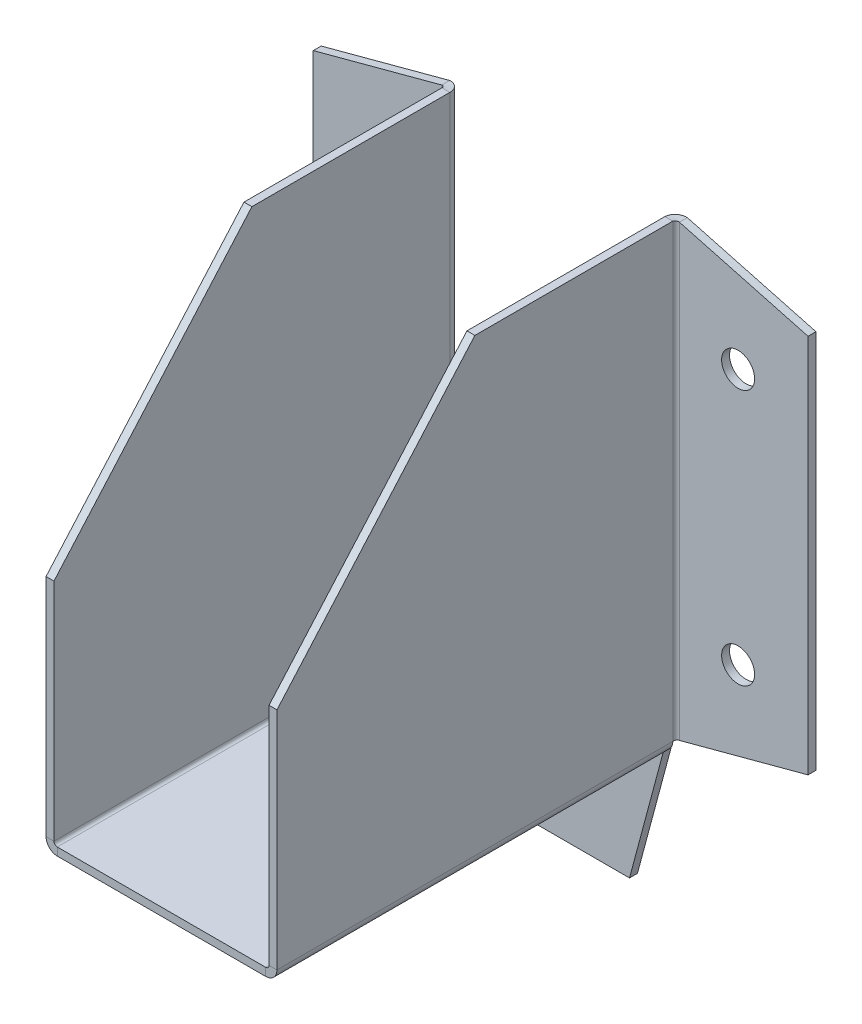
ISO-10303-21;
HEADER;
FILE_DESCRIPTION(('STEP AP214'),'2;1');
FILE_NAME('part.step','',(''),(''),'','','');
FILE_SCHEMA(('AUTOMOTIVE_DESIGN { 1 0 10303 214 1 1 1 1 }'));
ENDSEC;
DATA;
#1=APPLICATION_CONTEXT('core data for automotive mechanical design processes');
#2=APPLICATION_PROTOCOL_DEFINITION('international standard','automotive_design',2000,#1);
#3=PRODUCT_CONTEXT('',#1,'mechanical');
#4=PRODUCT('Part','Part','',(#3));
#5=PRODUCT_RELATED_PRODUCT_CATEGORY('part','',(#4));
#6=PRODUCT_DEFINITION_FORMATION('','',#4);
#7=PRODUCT_DEFINITION_CONTEXT('part definition',#1,'design');
#8=PRODUCT_DEFINITION('design','',#6,#7);
#9=PRODUCT_DEFINITION_SHAPE('','',#8);
#10=(LENGTH_UNIT() NAMED_UNIT(*) SI_UNIT(.MILLI.,.METRE.));
#11=(NAMED_UNIT(*) PLANE_ANGLE_UNIT() SI_UNIT($,.RADIAN.));
#12=(NAMED_UNIT(*) SI_UNIT($,.STERADIAN.) SOLID_ANGLE_UNIT());
#13=UNCERTAINTY_MEASURE_WITH_UNIT(LENGTH_MEASURE(1.E-05),#10,'distance_accuracy_value','');
#14=(GEOMETRIC_REPRESENTATION_CONTEXT(3) GLOBAL_UNCERTAINTY_ASSIGNED_CONTEXT((#13)) GLOBAL_UNIT_ASSIGNED_CONTEXT((#10,
#11,#12)) REPRESENTATION_CONTEXT('',''));
#15=CARTESIAN_POINT('',(0.,0.,0.));
#16=DIRECTION('',(0.,0.,1.));
#17=DIRECTION('',(1.,0.,0.));
#18=AXIS2_PLACEMENT_3D('',#15,#16,#17);
#19=CARTESIAN_POINT('',(-20.066,1.524,76.2));
#20=DIRECTION('',(0.,0.,1.));
#21=DIRECTION('',(1.,0.,0.));
#22=AXIS2_PLACEMENT_3D('',#19,#20,#21);
#23=PLANE('',#22);
#24=DIRECTION('',(0.,1.,0.));
#25=VECTOR('',#24,1.);
#26=CARTESIAN_POINT('',(-20.701,0.,76.2));
#27=LINE('',#26,#25);
#28=CARTESIAN_POINT('',(-20.701,2.159,76.2));
#29=VERTEX_POINT('',#28);
#30=CARTESIAN_POINT('',(-20.701,45.5295,76.2));
#31=VERTEX_POINT('',#30);
#32=EDGE_CURVE('E527',#29,#31,#27,.T.);
#33=ORIENTED_EDGE('',*,*,#32,.T.);
#34=DIRECTION('',(1.,0.,0.));
#35=VECTOR('',#34,1.);
#36=CARTESIAN_POINT('',(-20.701,45.5295,76.2));
#37=LINE('',#36,#35);
#38=CARTESIAN_POINT('',(-22.225,45.5295,76.2));
#39=VERTEX_POINT('',#38);
#40=EDGE_CURVE('E514',#31,#39,#37,.F.);
#41=ORIENTED_EDGE('',*,*,#40,.T.);
#42=DIRECTION('',(0.,1.,0.));
#43=VECTOR('',#42,1.);
#44=CARTESIAN_POINT('',(-22.225,0.,76.2));
#45=LINE('',#44,#43);
#46=CARTESIAN_POINT('',(-22.225,2.159,76.2));
#47=VERTEX_POINT('',#46);
#48=EDGE_CURVE('E530',#47,#39,#45,.T.);
#49=ORIENTED_EDGE('',*,*,#48,.F.);
#50=DIRECTION('',(1.,0.,0.));
#51=VECTOR('',#50,1.);
#52=CARTESIAN_POINT('',(-22.225,2.159,76.2));
#53=LINE('',#52,#51);
#54=EDGE_CURVE('E629',#47,#29,#53,.T.);
#55=ORIENTED_EDGE('',*,*,#54,.T.);
#56=EDGE_LOOP('',(#33,#41,#49,#55));
#57=FACE_BOUND('',#56,.T.);
#58=ADVANCED_FACE('F99',(#57),#23,.T.);
#59=CARTESIAN_POINT('',(-20.701,0.,76.2));
#60=DIRECTION('',(-1.,0.,0.));
#61=DIRECTION('',(0.,0.,1.));
#62=AXIS2_PLACEMENT_3D('',#59,#60,#61);
#63=PLANE('',#62);
#64=DIRECTION('',(0.,-0.75128058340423,0.659982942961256));
#65=VECTOR('',#64,1.);
#66=CARTESIAN_POINT('',(-20.701,19.8316251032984,98.7749999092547));
#67=LINE('',#66,#65);
#68=CARTESIAN_POINT('',(-20.701,88.9,38.1));
#69=VERTEX_POINT('',#68);
#70=EDGE_CURVE('E511',#69,#31,#67,.T.);
#71=ORIENTED_EDGE('',*,*,#70,.T.);
#72=ORIENTED_EDGE('',*,*,#32,.F.);
#73=DIRECTION('',(0.,0.,-1.));
#74=VECTOR('',#73,1.);
#75=CARTESIAN_POINT('',(-20.701,2.159,76.2));
#76=LINE('',#75,#74);
#77=CARTESIAN_POINT('',(-20.701,2.15899999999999,0.));
#78=VERTEX_POINT('',#77);
#79=EDGE_CURVE('E556',#29,#78,#76,.T.);
#80=ORIENTED_EDGE('',*,*,#79,.T.);
#81=DIRECTION('',(0.,1.,0.));
#82=VECTOR('',#81,1.);
#83=CARTESIAN_POINT('',(-20.701,0.,0.));
#84=LINE('',#83,#82);
#85=CARTESIAN_POINT('',(-20.701,88.9,0.));
#86=VERTEX_POINT('',#85);
#87=EDGE_CURVE('E525',#78,#86,#84,.T.);
#88=ORIENTED_EDGE('',*,*,#87,.T.);
#89=DIRECTION('',(0.,0.,-1.));
#90=VECTOR('',#89,1.);
#91=CARTESIAN_POINT('',(-20.701,88.9,76.2));
#92=LINE('',#91,#90);
#93=EDGE_CURVE('E619',#69,#86,#92,.T.);
#94=ORIENTED_EDGE('',*,*,#93,.F.);
#95=EDGE_LOOP('',(#71,#72,#80,#88,#94));
#96=FACE_BOUND('',#95,.T.);
#97=ADVANCED_FACE('F680',(#96),#63,.F.);
#98=CARTESIAN_POINT('',(-22.225,88.9,76.2));
#99=DIRECTION('',(0.,1.,0.));
#100=DIRECTION('',(-1.,0.,0.));
#101=AXIS2_PLACEMENT_3D('',#98,#99,#100);
#102=PLANE('',#101);
#103=DIRECTION('',(0.,0.,-1.));
#104=VECTOR('',#103,1.);
#105=CARTESIAN_POINT('',(-22.225,88.9,76.2));
#106=LINE('',#105,#104);
#107=CARTESIAN_POINT('',(-22.225,88.9,38.1));
#108=VERTEX_POINT('',#107);
#109=CARTESIAN_POINT('',(-22.225,88.9,0.));
#110=VERTEX_POINT('',#109);
#111=EDGE_CURVE('E616',#108,#110,#106,.T.);
#112=ORIENTED_EDGE('',*,*,#111,.F.);
#113=DIRECTION('',(1.,0.,0.));
#114=VECTOR('',#113,1.);
#115=CARTESIAN_POINT('',(-20.701,88.9,38.1));
#116=LINE('',#115,#114);
#117=EDGE_CURVE('E116',#69,#108,#116,.F.);
#118=ORIENTED_EDGE('',*,*,#117,.F.);
#119=ORIENTED_EDGE('',*,*,#93,.T.);
#120=DIRECTION('',(1.,0.,0.));
#121=VECTOR('',#120,1.);
#122=CARTESIAN_POINT('',(-22.225,88.9,0.));
#123=LINE('',#122,#121);
#124=EDGE_CURVE('E559',#110,#86,#123,.T.);
#125=ORIENTED_EDGE('',*,*,#124,.F.);
#126=EDGE_LOOP('',(#112,#118,#119,#125));
#127=FACE_BOUND('',#126,.T.);
#128=ADVANCED_FACE('F684',(#127),#102,.T.);
#129=CARTESIAN_POINT('',(-22.225,0.,76.2));
#130=DIRECTION('',(-1.,0.,0.));
#131=DIRECTION('',(0.,0.,1.));
#132=AXIS2_PLACEMENT_3D('',#129,#130,#131);
#133=PLANE('',#132);
#134=ORIENTED_EDGE('',*,*,#48,.T.);
#135=DIRECTION('',(0.,-0.75128058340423,0.659982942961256));
#136=VECTOR('',#135,1.);
#137=CARTESIAN_POINT('',(-22.225,19.8316251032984,98.7749999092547));
#138=LINE('',#137,#136);
#139=EDGE_CURVE('E504',#108,#39,#138,.T.);
#140=ORIENTED_EDGE('',*,*,#139,.F.);
#141=ORIENTED_EDGE('',*,*,#111,.T.);
#142=DIRECTION('',(0.,1.,0.));
#143=VECTOR('',#142,1.);
#144=CARTESIAN_POINT('',(-22.225,0.,0.));
#145=LINE('',#144,#143);
#146=CARTESIAN_POINT('',(-22.225,2.15899999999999,0.));
#147=VERTEX_POINT('',#146);
#148=EDGE_CURVE('E562',#147,#110,#145,.T.);
#149=ORIENTED_EDGE('',*,*,#148,.F.);
#150=DIRECTION('',(0.,0.,-1.));
#151=VECTOR('',#150,1.);
#152=CARTESIAN_POINT('',(-22.225,2.159,76.2));
#153=LINE('',#152,#151);
#154=EDGE_CURVE('E613',#47,#147,#153,.T.);
#155=ORIENTED_EDGE('',*,*,#154,.F.);
#156=EDGE_LOOP('',(#134,#140,#141,#149,#155));
#157=FACE_BOUND('',#156,.T.);
#158=ADVANCED_FACE('F676',(#157),#133,.T.);
#159=CARTESIAN_POINT('',(22.225,0.,76.2));
#160=DIRECTION('',(1.,0.,0.));
#161=DIRECTION('',(0.,0.,-1.));
#162=AXIS2_PLACEMENT_3D('',#159,#160,#161);
#163=PLANE('',#162);
#164=DIRECTION('',(0.,0.,-1.));
#165=VECTOR('',#164,1.);
#166=CARTESIAN_POINT('',(22.225,88.9,76.2));
#167=LINE('',#166,#165);
#168=CARTESIAN_POINT('',(22.225,88.9,38.1));
#169=VERTEX_POINT('',#168);
#170=CARTESIAN_POINT('',(22.225,88.9,0.));
#171=VERTEX_POINT('',#170);
#172=EDGE_CURVE('E601',#169,#171,#167,.T.);
#173=ORIENTED_EDGE('',*,*,#172,.F.);
#174=DIRECTION('',(0.,0.75128058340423,-0.659982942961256));
#175=VECTOR('',#174,1.);
#176=CARTESIAN_POINT('',(22.225,19.8316251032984,98.7749999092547));
#177=LINE('',#176,#175);
#178=CARTESIAN_POINT('',(22.225,45.5295,76.2));
#179=VERTEX_POINT('',#178);
#180=EDGE_CURVE('E518',#179,#169,#177,.T.);
#181=ORIENTED_EDGE('',*,*,#180,.F.);
#182=DIRECTION('',(0.,-1.,0.));
#183=VECTOR('',#182,1.);
#184=CARTESIAN_POINT('',(22.225,0.,76.2));
#185=LINE('',#184,#183);
#186=CARTESIAN_POINT('',(22.225,2.159,76.2));
#187=VERTEX_POINT('',#186);
#188=EDGE_CURVE('E543',#179,#187,#185,.T.);
#189=ORIENTED_EDGE('',*,*,#188,.T.);
#190=DIRECTION('',(0.,0.,-1.));
#191=VECTOR('',#190,1.);
#192=CARTESIAN_POINT('',(22.225,2.159,76.2));
#193=LINE('',#192,#191);
#194=CARTESIAN_POINT('',(22.225,2.15899999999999,0.));
#195=VERTEX_POINT('',#194);
#196=EDGE_CURVE('E604',#187,#195,#193,.T.);
#197=ORIENTED_EDGE('',*,*,#196,.T.);
#198=DIRECTION('',(0.,-1.,0.));
#199=VECTOR('',#198,1.);
#200=CARTESIAN_POINT('',(22.225,0.,0.));
#201=LINE('',#200,#199);
#202=EDGE_CURVE('E572',#171,#195,#201,.T.);
#203=ORIENTED_EDGE('',*,*,#202,.F.);
#204=EDGE_LOOP('',(#173,#181,#189,#197,#203));
#205=FACE_BOUND('',#204,.T.);
#206=ADVANCED_FACE('F1137',(#205),#163,.T.);
#207=CARTESIAN_POINT('',(20.701,88.9,76.2));
#208=DIRECTION('',(0.,1.,0.));
#209=DIRECTION('',(-1.,0.,0.));
#210=AXIS2_PLACEMENT_3D('',#207,#208,#209);
#211=PLANE('',#210);
#212=DIRECTION('',(0.,0.,-1.));
#213=VECTOR('',#212,1.);
#214=CARTESIAN_POINT('',(20.701,88.9,76.2));
#215=LINE('',#214,#213);
#216=CARTESIAN_POINT('',(20.701,88.9,38.1));
#217=VERTEX_POINT('',#216);
#218=CARTESIAN_POINT('',(20.701,88.9,0.));
#219=VERTEX_POINT('',#218);
#220=EDGE_CURVE('E598',#217,#219,#215,.T.);
#221=ORIENTED_EDGE('',*,*,#220,.F.);
#222=DIRECTION('',(-1.,0.,0.));
#223=VECTOR('',#222,1.);
#224=CARTESIAN_POINT('',(20.701,88.9,38.1));
#225=LINE('',#224,#223);
#226=EDGE_CURVE('E522',#217,#169,#225,.F.);
#227=ORIENTED_EDGE('',*,*,#226,.T.);
#228=ORIENTED_EDGE('',*,*,#172,.T.);
#229=DIRECTION('',(1.,0.,0.));
#230=VECTOR('',#229,1.);
#231=CARTESIAN_POINT('',(20.701,88.9,0.));
#232=LINE('',#231,#230);
#233=EDGE_CURVE('E574',#219,#171,#232,.T.);
#234=ORIENTED_EDGE('',*,*,#233,.F.);
#235=EDGE_LOOP('',(#221,#227,#228,#234));
#236=FACE_BOUND('',#235,.T.);
#237=ADVANCED_FACE('F1143',(#236),#211,.T.);
#238=CARTESIAN_POINT('',(20.701,0.,76.2));
#239=DIRECTION('',(1.,0.,0.));
#240=DIRECTION('',(0.,0.,-1.));
#241=AXIS2_PLACEMENT_3D('',#238,#239,#240);
#242=PLANE('',#241);
#243=DIRECTION('',(0.,0.75128058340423,-0.659982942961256));
#244=VECTOR('',#243,1.);
#245=CARTESIAN_POINT('',(20.701,19.8316251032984,98.7749999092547));
#246=LINE('',#245,#244);
#247=CARTESIAN_POINT('',(20.701,45.5295,76.2));
#248=VERTEX_POINT('',#247);
#249=EDGE_CURVE('E124',#248,#217,#246,.T.);
#250=ORIENTED_EDGE('',*,*,#249,.T.);
#251=ORIENTED_EDGE('',*,*,#220,.T.);
#252=DIRECTION('',(0.,1.,0.));
#253=VECTOR('',#252,1.);
#254=CARTESIAN_POINT('',(20.701,0.,0.));
#255=LINE('',#254,#253);
#256=CARTESIAN_POINT('',(20.701,2.159,0.));
#257=VERTEX_POINT('',#256);
#258=EDGE_CURVE('E576',#219,#257,#255,.F.);
#259=ORIENTED_EDGE('',*,*,#258,.T.);
#260=DIRECTION('',(0.,0.,-1.));
#261=VECTOR('',#260,1.);
#262=CARTESIAN_POINT('',(20.701,2.159,76.2));
#263=LINE('',#262,#261);
#264=CARTESIAN_POINT('',(20.701,2.159,76.2));
#265=VERTEX_POINT('',#264);
#266=EDGE_CURVE('E595',#265,#257,#263,.T.);
#267=ORIENTED_EDGE('',*,*,#266,.F.);
#268=DIRECTION('',(0.,1.,0.));
#269=VECTOR('',#268,1.);
#270=CARTESIAN_POINT('',(20.701,0.,76.2));
#271=LINE('',#270,#269);
#272=EDGE_CURVE('E545',#248,#265,#271,.F.);
#273=ORIENTED_EDGE('',*,*,#272,.F.);
#274=EDGE_LOOP('',(#250,#251,#259,#267,#273));
#275=FACE_BOUND('',#274,.T.);
#276=ADVANCED_FACE('F1155',(#275),#242,.F.);
#277=CARTESIAN_POINT('',(-20.066,2.159,76.2));
#278=DIRECTION('',(0.,0.,1.));
#279=DIRECTION('',(1.,0.,0.));
#280=AXIS2_PLACEMENT_3D('',#277,#278,#279);
#281=PLANE('',#280);
#282=ORIENTED_EDGE('',*,*,#188,.F.);
#283=DIRECTION('',(-1.,0.,0.));
#284=VECTOR('',#283,1.);
#285=CARTESIAN_POINT('',(20.701,45.5295,76.2));
#286=LINE('',#285,#284);
#287=EDGE_CURVE('E520',#248,#179,#286,.F.);
#288=ORIENTED_EDGE('',*,*,#287,.F.);
#289=ORIENTED_EDGE('',*,*,#272,.T.);
#290=DIRECTION('',(1.,0.,0.));
#291=VECTOR('',#290,1.);
#292=CARTESIAN_POINT('',(20.701,2.159,76.2));
#293=LINE('',#292,#291);
#294=EDGE_CURVE('E109',#265,#187,#293,.T.);
#295=ORIENTED_EDGE('',*,*,#294,.T.);
#296=EDGE_LOOP('',(#282,#288,#289,#295));
#297=FACE_BOUND('',#296,.T.);
#298=ADVANCED_FACE('F640',(#297),#281,.T.);
#299=CARTESIAN_POINT('',(20.066,0.,76.2));
#300=DIRECTION('',(0.,0.,1.));
#301=DIRECTION('',(1.,0.,0.));
#302=AXIS2_PLACEMENT_3D('',#299,#300,#301);
#303=PLANE('',#302);
#304=DIRECTION('',(0.,1.,0.));
#305=VECTOR('',#304,1.);
#306=CARTESIAN_POINT('',(20.066,0.,76.2));
#307=LINE('',#306,#305);
#308=CARTESIAN_POINT('',(20.066,0.,76.2));
#309=VERTEX_POINT('',#308);
#310=CARTESIAN_POINT('',(20.066,1.524,76.2));
#311=VERTEX_POINT('',#310);
#312=EDGE_CURVE('E13',#309,#311,#307,.T.);
#313=ORIENTED_EDGE('',*,*,#312,.F.);
#314=CARTESIAN_POINT('',(20.066,2.159,76.2));
#315=DIRECTION('',(0.,0.,1.));
#316=DIRECTION('',(1.,0.,0.));
#317=AXIS2_PLACEMENT_3D('',#314,#315,#316);
#318=CIRCLE('',#317,2.159);
#319=EDGE_CURVE('E540',#187,#309,#318,.F.);
#320=ORIENTED_EDGE('',*,*,#319,.F.);
#321=ORIENTED_EDGE('',*,*,#294,.F.);
#322=CARTESIAN_POINT('',(20.066,2.159,76.2));
#323=DIRECTION('',(0.,0.,1.));
#324=DIRECTION('',(1.,0.,0.));
#325=AXIS2_PLACEMENT_3D('',#322,#323,#324);
#326=CIRCLE('',#325,0.635);
#327=EDGE_CURVE('E547',#265,#311,#326,.F.);
#328=ORIENTED_EDGE('',*,*,#327,.T.);
#329=EDGE_LOOP('',(#313,#320,#321,#328));
#330=FACE_BOUND('',#329,.T.);
#331=ADVANCED_FACE('F650',(#330),#303,.T.);
#332=CARTESIAN_POINT('',(20.701,2.159,76.2));
#333=DIRECTION('',(0.,0.,1.));
#334=DIRECTION('',(1.,0.,0.));
#335=AXIS2_PLACEMENT_3D('',#332,#333,#334);
#336=PLANE('',#335);
#337=DIRECTION('',(-1.,0.,0.));
#338=VECTOR('',#337,1.);
#339=CARTESIAN_POINT('',(-22.225,0.,76.2));
#340=LINE('',#339,#338);
#341=CARTESIAN_POINT('',(-20.066,0.,76.2));
#342=VERTEX_POINT('',#341);
#343=EDGE_CURVE('E537',#309,#342,#340,.T.);
#344=ORIENTED_EDGE('',*,*,#343,.F.);
#345=ORIENTED_EDGE('',*,*,#312,.T.);
#346=DIRECTION('',(1.,0.,0.));
#347=VECTOR('',#346,1.);
#348=CARTESIAN_POINT('',(-22.225,1.524,76.2));
#349=LINE('',#348,#347);
#350=CARTESIAN_POINT('',(-20.066,1.524,76.2));
#351=VERTEX_POINT('',#350);
#352=EDGE_CURVE('E550',#311,#351,#349,.F.);
#353=ORIENTED_EDGE('',*,*,#352,.T.);
#354=DIRECTION('',(0.,-1.,0.));
#355=VECTOR('',#354,1.);
#356=CARTESIAN_POINT('',(-20.066,1.524,76.2));
#357=LINE('',#356,#355);
#358=EDGE_CURVE('E627',#351,#342,#357,.T.);
#359=ORIENTED_EDGE('',*,*,#358,.T.);
#360=EDGE_LOOP('',(#344,#345,#353,#359));
#361=FACE_BOUND('',#360,.T.);
#362=ADVANCED_FACE('F659',(#361),#336,.T.);
#363=CARTESIAN_POINT('',(22.225,2.159,0.));
#364=DIRECTION('',(0.,0.,-1.));
#365=DIRECTION('',(-1.,0.,0.));
#366=AXIS2_PLACEMENT_3D('',#363,#364,#365);
#367=PLANE('',#366);
#368=DIRECTION('',(-1.,0.,0.));
#369=VECTOR('',#368,1.);
#370=CARTESIAN_POINT('',(22.225,2.159,0.));
#371=LINE('',#370,#369);
#372=EDGE_CURVE('E633',#195,#257,#371,.T.);
#373=ORIENTED_EDGE('',*,*,#372,.F.);
#374=CARTESIAN_POINT('',(20.066,2.159,0.));
#375=DIRECTION('',(0.,0.,1.));
#376=DIRECTION('',(1.,0.,0.));
#377=AXIS2_PLACEMENT_3D('',#374,#375,#376);
#378=CIRCLE('',#377,2.159);
#379=CARTESIAN_POINT('',(20.066,0.,0.));
#380=VERTEX_POINT('',#379);
#381=EDGE_CURVE('E569',#195,#380,#378,.F.);
#382=ORIENTED_EDGE('',*,*,#381,.T.);
#383=DIRECTION('',(0.,-1.,0.));
#384=VECTOR('',#383,1.);
#385=CARTESIAN_POINT('',(20.066,1.524,0.));
#386=LINE('',#385,#384);
#387=CARTESIAN_POINT('',(20.066,1.524,0.));
#388=VERTEX_POINT('',#387);
#389=EDGE_CURVE('E631',#388,#380,#386,.T.);
#390=ORIENTED_EDGE('',*,*,#389,.F.);
#391=CARTESIAN_POINT('',(20.066,2.159,0.));
#392=DIRECTION('',(0.,0.,1.));
#393=DIRECTION('',(1.,0.,0.));
#394=AXIS2_PLACEMENT_3D('',#391,#392,#393);
#395=CIRCLE('',#394,0.635);
#396=EDGE_CURVE('E579',#257,#388,#395,.F.);
#397=ORIENTED_EDGE('',*,*,#396,.F.);
#398=EDGE_LOOP('',(#373,#382,#390,#397));
#399=FACE_BOUND('',#398,.T.);
#400=ADVANCED_FACE('F729',(#399),#367,.T.);
#401=CARTESIAN_POINT('',(-22.225,2.159,76.2));
#402=DIRECTION('',(0.,0.,1.));
#403=DIRECTION('',(1.,0.,0.));
#404=AXIS2_PLACEMENT_3D('',#401,#402,#403);
#405=PLANE('',#404);
#406=ORIENTED_EDGE('',*,*,#54,.F.);
#407=CARTESIAN_POINT('',(-20.066,2.159,76.2));
#408=DIRECTION('',(0.,0.,1.));
#409=DIRECTION('',(1.,0.,0.));
#410=AXIS2_PLACEMENT_3D('',#407,#408,#409);
#411=CIRCLE('',#410,2.159);
#412=EDGE_CURVE('E534',#342,#47,#411,.F.);
#413=ORIENTED_EDGE('',*,*,#412,.F.);
#414=ORIENTED_EDGE('',*,*,#358,.F.);
#415=CARTESIAN_POINT('',(-20.066,2.159,76.2));
#416=DIRECTION('',(0.,0.,1.));
#417=DIRECTION('',(1.,0.,0.));
#418=AXIS2_PLACEMENT_3D('',#415,#416,#417);
#419=CIRCLE('',#418,0.635);
#420=EDGE_CURVE('E553',#351,#29,#419,.F.);
#421=ORIENTED_EDGE('',*,*,#420,.T.);
#422=EDGE_LOOP('',(#406,#413,#414,#421));
#423=FACE_BOUND('',#422,.T.);
#424=ADVANCED_FACE('F668',(#423),#405,.T.);
#425=CARTESIAN_POINT('',(-20.066,0.,0.));
#426=DIRECTION('',(0.,0.,-1.));
#427=DIRECTION('',(-1.,0.,0.));
#428=AXIS2_PLACEMENT_3D('',#425,#426,#427);
#429=PLANE('',#428);
#430=DIRECTION('',(0.,1.,0.));
#431=VECTOR('',#430,1.);
#432=CARTESIAN_POINT('',(-20.066,0.,0.));
#433=LINE('',#432,#431);
#434=CARTESIAN_POINT('',(-20.066,0.,0.));
#435=VERTEX_POINT('',#434);
#436=CARTESIAN_POINT('',(-20.066,1.524,0.));
#437=VERTEX_POINT('',#436);
#438=EDGE_CURVE('E624',#435,#437,#433,.T.);
#439=ORIENTED_EDGE('',*,*,#438,.F.);
#440=CARTESIAN_POINT('',(-20.066,2.159,0.));
#441=DIRECTION('',(0.,0.,1.));
#442=DIRECTION('',(1.,0.,0.));
#443=AXIS2_PLACEMENT_3D('',#440,#441,#442);
#444=CIRCLE('',#443,2.159);
#445=EDGE_CURVE('E564',#435,#147,#444,.F.);
#446=ORIENTED_EDGE('',*,*,#445,.T.);
#447=DIRECTION('',(-1.,0.,0.));
#448=VECTOR('',#447,1.);
#449=CARTESIAN_POINT('',(-20.701,2.159,0.));
#450=LINE('',#449,#448);
#451=EDGE_CURVE('E622',#78,#147,#450,.T.);
#452=ORIENTED_EDGE('',*,*,#451,.F.);
#453=CARTESIAN_POINT('',(-20.066,2.159,0.));
#454=DIRECTION('',(0.,0.,1.));
#455=DIRECTION('',(1.,0.,0.));
#456=AXIS2_PLACEMENT_3D('',#453,#454,#455);
#457=CIRCLE('',#456,0.635);
#458=EDGE_CURVE('E531',#437,#78,#457,.F.);
#459=ORIENTED_EDGE('',*,*,#458,.F.);
#460=EDGE_LOOP('',(#439,#446,#452,#459));
#461=FACE_BOUND('',#460,.T.);
#462=ADVANCED_FACE('F726',(#461),#429,.T.);
#463=CARTESIAN_POINT('',(-20.066,2.159,76.2));
#464=DIRECTION('',(0.,0.,-1.));
#465=DIRECTION('',(-1.,0.,0.));
#466=AXIS2_PLACEMENT_3D('',#463,#464,#465);
#467=CYLINDRICAL_SURFACE('',#466,2.159);
#468=ORIENTED_EDGE('',*,*,#445,.F.);
#469=DIRECTION('',(0.,0.,-1.));
#470=VECTOR('',#469,1.);
#471=CARTESIAN_POINT('',(-20.066,0.,76.2));
#472=LINE('',#471,#470);
#473=EDGE_CURVE('E610',#342,#435,#472,.T.);
#474=ORIENTED_EDGE('',*,*,#473,.F.);
#475=ORIENTED_EDGE('',*,*,#412,.T.);
#476=ORIENTED_EDGE('',*,*,#154,.T.);
#477=EDGE_LOOP('',(#468,#474,#475,#476));
#478=FACE_BOUND('',#477,.T.);
#479=ADVANCED_FACE('F667',(#478),#467,.T.);
#480=CARTESIAN_POINT('',(-22.225,0.,76.2));
#481=DIRECTION('',(0.,-1.,0.));
#482=DIRECTION('',(0.,0.,-1.));
#483=AXIS2_PLACEMENT_3D('',#480,#481,#482);
#484=PLANE('',#483);
#485=DIRECTION('',(-1.,0.,0.));
#486=VECTOR('',#485,1.);
#487=CARTESIAN_POINT('',(-22.225,0.,0.));
#488=LINE('',#487,#486);
#489=EDGE_CURVE('E567',#380,#435,#488,.T.);
#490=ORIENTED_EDGE('',*,*,#489,.F.);
#491=DIRECTION('',(0.,0.,-1.));
#492=VECTOR('',#491,1.);
#493=CARTESIAN_POINT('',(20.066,0.,76.2));
#494=LINE('',#493,#492);
#495=EDGE_CURVE('E607',#309,#380,#494,.T.);
#496=ORIENTED_EDGE('',*,*,#495,.F.);
#497=ORIENTED_EDGE('',*,*,#343,.T.);
#498=ORIENTED_EDGE('',*,*,#473,.T.);
#499=EDGE_LOOP('',(#490,#496,#497,#498));
#500=FACE_BOUND('',#499,.T.);
#501=ADVANCED_FACE('F658',(#500),#484,.T.);
#502=CARTESIAN_POINT('',(20.066,2.159,76.2));
#503=DIRECTION('',(0.,0.,-1.));
#504=DIRECTION('',(-1.,0.,0.));
#505=AXIS2_PLACEMENT_3D('',#502,#503,#504);
#506=CYLINDRICAL_SURFACE('',#505,2.159);
#507=ORIENTED_EDGE('',*,*,#381,.F.);
#508=ORIENTED_EDGE('',*,*,#196,.F.);
#509=ORIENTED_EDGE('',*,*,#319,.T.);
#510=ORIENTED_EDGE('',*,*,#495,.T.);
#511=EDGE_LOOP('',(#507,#508,#509,#510));
#512=FACE_BOUND('',#511,.T.);
#513=ADVANCED_FACE('F647',(#512),#506,.T.);
#514=CARTESIAN_POINT('',(20.066,2.159,76.2));
#515=DIRECTION('',(0.,0.,-1.));
#516=DIRECTION('',(-1.,0.,0.));
#517=AXIS2_PLACEMENT_3D('',#514,#515,#516);
#518=CYLINDRICAL_SURFACE('',#517,0.635);
#519=ORIENTED_EDGE('',*,*,#396,.T.);
#520=DIRECTION('',(0.,0.,-1.));
#521=VECTOR('',#520,1.);
#522=CARTESIAN_POINT('',(20.066,1.524,76.2));
#523=LINE('',#522,#521);
#524=EDGE_CURVE('E592',#311,#388,#523,.T.);
#525=ORIENTED_EDGE('',*,*,#524,.F.);
#526=ORIENTED_EDGE('',*,*,#327,.F.);
#527=ORIENTED_EDGE('',*,*,#266,.T.);
#528=EDGE_LOOP('',(#519,#525,#526,#527));
#529=FACE_BOUND('',#528,.T.);
#530=ADVANCED_FACE('F804',(#529),#518,.F.);
#531=CARTESIAN_POINT('',(-22.225,1.524,76.2));
#532=DIRECTION('',(0.,-1.,0.));
#533=DIRECTION('',(0.,0.,-1.));
#534=AXIS2_PLACEMENT_3D('',#531,#532,#533);
#535=PLANE('',#534);
#536=DIRECTION('',(1.,0.,0.));
#537=VECTOR('',#536,1.);
#538=CARTESIAN_POINT('',(-22.225,1.524,0.));
#539=LINE('',#538,#537);
#540=EDGE_CURVE('E582',#388,#437,#539,.F.);
#541=ORIENTED_EDGE('',*,*,#540,.T.);
#542=DIRECTION('',(0.,0.,-1.));
#543=VECTOR('',#542,1.);
#544=CARTESIAN_POINT('',(-20.066,1.524,76.2));
#545=LINE('',#544,#543);
#546=EDGE_CURVE('E589',#351,#437,#545,.T.);
#547=ORIENTED_EDGE('',*,*,#546,.F.);
#548=ORIENTED_EDGE('',*,*,#352,.F.);
#549=ORIENTED_EDGE('',*,*,#524,.T.);
#550=EDGE_LOOP('',(#541,#547,#548,#549));
#551=FACE_BOUND('',#550,.T.);
#552=ADVANCED_FACE('F806',(#551),#535,.F.);
#553=CARTESIAN_POINT('',(-20.066,2.159,76.2));
#554=DIRECTION('',(0.,0.,-1.));
#555=DIRECTION('',(-1.,0.,0.));
#556=AXIS2_PLACEMENT_3D('',#553,#554,#555);
#557=CYLINDRICAL_SURFACE('',#556,0.635);
#558=ORIENTED_EDGE('',*,*,#458,.T.);
#559=ORIENTED_EDGE('',*,*,#79,.F.);
#560=ORIENTED_EDGE('',*,*,#420,.F.);
#561=ORIENTED_EDGE('',*,*,#546,.T.);
#562=EDGE_LOOP('',(#558,#559,#560,#561));
#563=FACE_BOUND('',#562,.T.);
#564=ADVANCED_FACE('F809',(#563),#557,.F.);
#565=CARTESIAN_POINT('',(20.701,19.8316251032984,98.7749999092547));
#566=DIRECTION('',(0.,-0.659982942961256,-0.75128058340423));
#567=DIRECTION('',(0.,0.75128058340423,-0.659982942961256));
#568=AXIS2_PLACEMENT_3D('',#565,#566,#567);
#569=PLANE('',#568);
#570=ORIENTED_EDGE('',*,*,#226,.F.);
#571=ORIENTED_EDGE('',*,*,#249,.F.);
#572=ORIENTED_EDGE('',*,*,#287,.T.);
#573=ORIENTED_EDGE('',*,*,#180,.T.);
#574=EDGE_LOOP('',(#570,#571,#572,#573));
#575=FACE_BOUND('',#574,.T.);
#576=ADVANCED_FACE('F1230',(#575),#569,.F.);
#577=CARTESIAN_POINT('',(-20.701,19.8316251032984,98.7749999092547));
#578=DIRECTION('',(0.,-0.659982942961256,-0.75128058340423));
#579=DIRECTION('',(0.,-0.75128058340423,0.659982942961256));
#580=AXIS2_PLACEMENT_3D('',#577,#578,#579);
#581=PLANE('',#580);
#582=ORIENTED_EDGE('',*,*,#40,.F.);
#583=ORIENTED_EDGE('',*,*,#70,.F.);
#584=ORIENTED_EDGE('',*,*,#117,.T.);
#585=ORIENTED_EDGE('',*,*,#139,.T.);
#586=EDGE_LOOP('',(#582,#583,#584,#585));
#587=FACE_BOUND('',#586,.T.);
#588=ADVANCED_FACE('F490',(#587),#581,.F.);
#589=CARTESIAN_POINT('',(-20.066,1.53924,0.));
#590=CARTESIAN_POINT('',(-20.0518184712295,1.53924,-0.284658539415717));
#591=CARTESIAN_POINT('',(-20.037642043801,1.48265035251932,-0.569102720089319));
#592=CARTESIAN_POINT('',(-20.0092840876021,1.26482131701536,-1.09498853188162));
#593=CARTESIAN_POINT('',(-19.9951051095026,1.10366763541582,-1.33617206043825));
#594=CARTESIAN_POINT('',(-19.9667471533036,0.701172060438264,-1.73866763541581));
#595=CARTESIAN_POINT('',(-19.9525681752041,0.459988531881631,-1.89982131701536));
#596=CARTESIAN_POINT('',(-19.9242102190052,-0.0658972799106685,-2.11765035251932));
#597=CARTESIAN_POINT('',(-19.9100337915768,-0.350341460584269,-2.17424));
#598=CARTESIAN_POINT('',(-19.8958522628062,-0.634999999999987,-2.17424));
#599=CARTESIAN_POINT('',(-20.066,1.524,0.));
#600=CARTESIAN_POINT('',(-20.0518184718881,1.524,-0.282663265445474));
#601=CARTESIAN_POINT('',(-20.037642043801,1.46780700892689,-0.565113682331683));
#602=CARTESIAN_POINT('',(-20.0092840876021,1.25150481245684,-1.08731337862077));
#603=CARTESIAN_POINT('',(-19.9951051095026,1.09148071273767,-1.32680636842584));
#604=CARTESIAN_POINT('',(-19.9667471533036,0.691806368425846,-1.72648071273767));
#605=CARTESIAN_POINT('',(-19.9525681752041,0.452313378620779,-1.88650481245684));
#606=CARTESIAN_POINT('',(-19.9242102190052,-0.0698863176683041,-2.10280700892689));
#607=CARTESIAN_POINT('',(-19.9100337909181,-0.352336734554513,-2.159));
#608=CARTESIAN_POINT('',(-19.8958522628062,-0.634999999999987,-2.159));
#609=CARTESIAN_POINT('',(-20.066,0.,0.));
#610=CARTESIAN_POINT('',(-20.0518185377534,0.,-0.0831358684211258));
#611=CARTESIAN_POINT('',(-20.037642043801,-0.0165273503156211,-0.166209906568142));
#612=CARTESIAN_POINT('',(-20.0092840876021,-0.0801456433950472,-0.31979805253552));
#613=CARTESIAN_POINT('',(-19.9951051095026,-0.127211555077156,-0.39023716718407));
#614=CARTESIAN_POINT('',(-19.9667471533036,-0.244762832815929,-0.507788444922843));
#615=CARTESIAN_POINT('',(-19.9525681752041,-0.315201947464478,-0.554854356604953));
#616=CARTESIAN_POINT('',(-19.9242102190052,-0.468790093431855,-0.61847264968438));
#617=CARTESIAN_POINT('',(-19.9100337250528,-0.55186413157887,-0.635));
#618=CARTESIAN_POINT('',(-19.8958522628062,-0.634999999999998,-0.635));
#619=CARTESIAN_POINT('',(-20.066,-0.0153924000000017,0.));
#620=CARTESIAN_POINT('',(-20.0518185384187,-0.0153924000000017,-0.0811206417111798));
#621=CARTESIAN_POINT('',(-20.037642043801,-0.0315191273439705,-0.16218097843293));
#622=CARTESIAN_POINT('',(-20.0092840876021,-0.0935953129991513,-0.312046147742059));
#623=CARTESIAN_POINT('',(-19.9951051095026,-0.139520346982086,-0.380777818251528));
#624=CARTESIAN_POINT('',(-19.9667471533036,-0.254222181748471,-0.495479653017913));
#625=CARTESIAN_POINT('',(-19.9525681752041,-0.322953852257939,-0.541404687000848));
#626=CARTESIAN_POINT('',(-19.9242102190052,-0.472819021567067,-0.60348087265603));
#627=CARTESIAN_POINT('',(-19.9100337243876,-0.553879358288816,-0.6196076));
#628=CARTESIAN_POINT('',(-19.8958522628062,-0.634999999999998,-0.6196076));
#629=B_SPLINE_SURFACE_WITH_KNOTS('',1,3,((#589,#590,#591,#592,#593,#594,#595,#596,#597,#598),
(#599,#600,#601,#602,#603,#604,#605,#606,#607,#608),(#609,#610,#611,#612,#613,#614,#615,#616,
#617,#618),(#619,#620,#621,#622,#623,#624,#625,#626,#627,#628)),.UNSPECIFIED.,.F.,.F.,.F.,(2,1,
1,2),(4,2,2,2,4),(-0.01,0.,1.,1.0101),(0.,0.25,0.5,0.75,1.),.UNSPECIFIED.);
#630=DIRECTION('',(0.,0.,1.));
#631=VECTOR('',#630,1.);
#632=CARTESIAN_POINT('',(-19.8958522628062,-0.634999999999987,-2.159));
#633=LINE('',#632,#631);
#634=CARTESIAN_POINT('',(-19.8958522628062,-0.635,-0.635));
#635=VERTEX_POINT('',#634);
#636=CARTESIAN_POINT('',(-19.8958522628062,-0.634999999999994,-2.159));
#637=VERTEX_POINT('',#636);
#638=EDGE_CURVE('E462',#635,#637,#633,.F.);
#639=CARTESIAN_POINT('',(-20.066,0.,0.));
#640=CARTESIAN_POINT('',(-20.0642276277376,2.2040137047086E-07,-0.0103901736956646));
#641=CARTESIAN_POINT('',(-20.0624552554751,-0.000255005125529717,-0.0207803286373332));
#642=CARTESIAN_POINT('',(-20.0589105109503,-0.00127476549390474,-0.041535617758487));
#643=CARTESIAN_POINT('',(-20.0571381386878,-0.00203930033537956,-0.0519007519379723));
#644=CARTESIAN_POINT('',(-20.053593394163,-0.00407609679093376,-0.0725810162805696));
#645=CARTESIAN_POINT('',(-20.0518210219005,-0.00534835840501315,-0.0828961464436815));
#646=CARTESIAN_POINT('',(-20.0482762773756,-0.0083974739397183,-0.103451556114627));
#647=CARTESIAN_POINT('',(-20.0465039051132,-0.0101743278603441,-0.113691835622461));
#648=CARTESIAN_POINT('',(-20.0429591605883,-0.0142283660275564,-0.134072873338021));
#649=CARTESIAN_POINT('',(-20.0411867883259,-0.016505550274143,-0.144213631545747));
#650=CARTESIAN_POINT('',(-20.037642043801,-0.021554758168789,-0.164371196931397));
#651=CARTESIAN_POINT('',(-20.0358696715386,-0.0243267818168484,-0.174388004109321));
#652=CARTESIAN_POINT('',(-20.0323249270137,-0.0303589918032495,-0.194273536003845));
#653=CARTESIAN_POINT('',(-20.0305525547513,-0.0336191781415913,-0.204142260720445));
#654=CARTESIAN_POINT('',(-20.0270078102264,-0.0406198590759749,-0.223707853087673));
#655=CARTESIAN_POINT('',(-20.025235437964,-0.0443603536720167,-0.233404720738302));
#656=CARTESIAN_POINT('',(-20.0216906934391,-0.0523126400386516,-0.25260323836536));
#657=CARTESIAN_POINT('',(-20.0199183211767,-0.0565244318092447,-0.262104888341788));
#658=CARTESIAN_POINT('',(-20.0163735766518,-0.0654091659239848,-0.280890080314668));
#659=CARTESIAN_POINT('',(-20.0146012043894,-0.0700821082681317,-0.29017362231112));
#660=CARTESIAN_POINT('',(-20.0110564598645,-0.07987788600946,-0.308500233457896));
#661=CARTESIAN_POINT('',(-20.0092840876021,-0.0850007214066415,-0.317543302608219));
#662=CARTESIAN_POINT('',(-20.0057393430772,-0.0956839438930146,-0.335367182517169));
#663=CARTESIAN_POINT('',(-20.0039669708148,-0.101244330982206,-0.344147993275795));
#664=CARTESIAN_POINT('',(-20.0004222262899,-0.112789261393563,-0.361426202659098));
#665=CARTESIAN_POINT('',(-19.9986498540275,-0.118773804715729,-0.369923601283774));
#666=CARTESIAN_POINT('',(-19.9951051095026,-0.131152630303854,-0.386614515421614));
#667=CARTESIAN_POINT('',(-19.9933327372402,-0.137546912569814,-0.394808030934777));
#668=CARTESIAN_POINT('',(-19.9897879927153,-0.150729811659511,-0.41087143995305));
#669=CARTESIAN_POINT('',(-19.9880156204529,-0.15751842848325,-0.41874133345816));
#670=CARTESIAN_POINT('',(-19.984470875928,-0.171473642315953,-0.434138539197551));
#671=CARTESIAN_POINT('',(-19.9826985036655,-0.178640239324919,-0.441665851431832));
#672=CARTESIAN_POINT('',(-19.9791537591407,-0.193334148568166,-0.45635976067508));
#673=CARTESIAN_POINT('',(-19.9773813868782,-0.200861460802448,-0.463526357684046));
#674=CARTESIAN_POINT('',(-19.9738366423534,-0.216258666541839,-0.47748157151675));
#675=CARTESIAN_POINT('',(-19.9720642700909,-0.224128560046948,-0.484270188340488));
#676=CARTESIAN_POINT('',(-19.9685195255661,-0.240191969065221,-0.497453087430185));
#677=CARTESIAN_POINT('',(-19.9667471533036,-0.248385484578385,-0.503847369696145));
#678=CARTESIAN_POINT('',(-19.9632024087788,-0.265076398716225,-0.516226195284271));
#679=CARTESIAN_POINT('',(-19.9614300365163,-0.273573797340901,-0.522210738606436));
#680=CARTESIAN_POINT('',(-19.9578852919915,-0.290852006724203,-0.533755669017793));
#681=CARTESIAN_POINT('',(-19.956112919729,-0.299632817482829,-0.539316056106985));
#682=CARTESIAN_POINT('',(-19.9525681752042,-0.317456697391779,-0.549999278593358));
#683=CARTESIAN_POINT('',(-19.9507958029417,-0.326499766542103,-0.55512211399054));
#684=CARTESIAN_POINT('',(-19.9472510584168,-0.344826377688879,-0.564917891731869));
#685=CARTESIAN_POINT('',(-19.9454786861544,-0.35410991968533,-0.569590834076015));
#686=CARTESIAN_POINT('',(-19.9419339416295,-0.37289511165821,-0.578475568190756));
#687=CARTESIAN_POINT('',(-19.9401615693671,-0.382396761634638,-0.582687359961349));
#688=CARTESIAN_POINT('',(-19.9366168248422,-0.401595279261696,-0.590639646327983));
#689=CARTESIAN_POINT('',(-19.9348444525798,-0.411292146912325,-0.594380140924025));
#690=CARTESIAN_POINT('',(-19.9312997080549,-0.430857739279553,-0.601380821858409));
#691=CARTESIAN_POINT('',(-19.9295273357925,-0.440726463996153,-0.604641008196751));
#692=CARTESIAN_POINT('',(-19.9259825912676,-0.460611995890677,-0.610673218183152));
#693=CARTESIAN_POINT('',(-19.9242102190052,-0.470628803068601,-0.613445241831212));
#694=CARTESIAN_POINT('',(-19.9206654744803,-0.490786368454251,-0.618494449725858));
#695=CARTESIAN_POINT('',(-19.9188931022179,-0.500927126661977,-0.620771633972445));
#696=CARTESIAN_POINT('',(-19.915348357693,-0.521308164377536,-0.624825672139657));
#697=CARTESIAN_POINT('',(-19.9135759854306,-0.53154844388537,-0.626602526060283));
#698=CARTESIAN_POINT('',(-19.9100312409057,-0.552103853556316,-0.629651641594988));
#699=CARTESIAN_POINT('',(-19.9082588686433,-0.562418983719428,-0.630923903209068));
#700=CARTESIAN_POINT('',(-19.9047141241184,-0.583099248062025,-0.632960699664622));
#701=CARTESIAN_POINT('',(-19.902941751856,-0.593464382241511,-0.633725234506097));
#702=CARTESIAN_POINT('',(-19.8993970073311,-0.614219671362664,-0.634744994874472));
#703=CARTESIAN_POINT('',(-19.8976246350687,-0.624609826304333,-0.635000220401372));
#704=CARTESIAN_POINT('',(-19.8958522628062,-0.634999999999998,-0.635));
#705=B_SPLINE_CURVE_WITH_KNOTS('',3,(#639,#640,#641,#642,#643,#644,#645,#646,#647,#648,#649,
#650,#651,#652,#653,#654,#655,#656,#657,#658,#659,#660,#661,#662,#663,#664,#665,#666,#667,#668,
#669,#670,#671,#672,#673,#674,#675,#676,#677,#678,#679,#680,#681,#682,#683,#684,#685,#686,#687,
#688,#689,#690,#691,#692,#693,#694,#695,#696,#697,#698,#699,#700,#701,#702,#703,#704),
.UNSPECIFIED.,.F.,.F.,(4,2,2,2,2,2,2,2,2,2,2,2,2,2,2,2,2,2,2,2,2,2,2,2,2,2,2,2,2,2,2,2,4),(0.,
0.0316176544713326,0.063235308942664,0.0948529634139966,0.126470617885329,0.158088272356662,
0.189705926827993,0.221323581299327,0.252941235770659,0.284558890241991,0.316176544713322,
0.347794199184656,0.379411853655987,0.41102950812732,0.442647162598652,0.474264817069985,
0.505882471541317,0.537500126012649,0.569117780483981,0.600735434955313,0.632353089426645,
0.663970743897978,0.69558839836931,0.727206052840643,0.758823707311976,0.790441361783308,
0.822059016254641,0.853676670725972,0.885294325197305,0.916911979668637,0.94852963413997,
0.980147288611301,1.01176494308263),.UNSPECIFIED.);
#706=EDGE_CURVE('E465',#435,#635,#705,.T.);
#707=CARTESIAN_POINT('',(-20.066,1.524,0.));
#708=CARTESIAN_POINT('',(-20.0642276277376,1.52400074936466,-0.0353265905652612));
#709=CARTESIAN_POINT('',(-20.0624552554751,1.5231329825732,-0.0706531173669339));
#710=CARTESIAN_POINT('',(-20.0589105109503,1.51966579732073,-0.141221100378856));
#711=CARTESIAN_POINT('',(-20.0571381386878,1.51706637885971,-0.176462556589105));
#712=CARTESIAN_POINT('',(-20.053593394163,1.51014127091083,-0.246775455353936));
#713=CARTESIAN_POINT('',(-20.0518210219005,1.50581558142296,-0.281846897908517));
#714=CARTESIAN_POINT('',(-20.0482762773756,1.49544858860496,-0.351735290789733));
#715=CARTESIAN_POINT('',(-20.0465039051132,1.48940728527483,-0.386552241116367));
#716=CARTESIAN_POINT('',(-20.0429591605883,1.47562355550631,-0.455847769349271));
#717=CARTESIAN_POINT('',(-20.0411867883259,1.46788112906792,-0.490326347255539));
#718=CARTESIAN_POINT('',(-20.037642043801,1.45071382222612,-0.55886206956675));
#719=CARTESIAN_POINT('',(-20.0358696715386,1.44128894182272,-0.592919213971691));
#720=CARTESIAN_POINT('',(-20.0323249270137,1.42077942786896,-0.660530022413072));
#721=CARTESIAN_POINT('',(-20.0305525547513,1.40969479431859,-0.694083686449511));
#722=CARTESIAN_POINT('',(-20.0270078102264,1.38589247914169,-0.760606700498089));
#723=CARTESIAN_POINT('',(-20.025235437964,1.37317479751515,-0.793576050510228));
#724=CARTESIAN_POINT('',(-20.0216906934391,1.34613702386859,-0.858851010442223));
#725=CARTESIAN_POINT('',(-20.0199183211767,1.33181693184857,-0.89115662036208));
#726=CARTESIAN_POINT('',(-20.0163735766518,1.30160883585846,-0.955026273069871));
#727=CARTESIAN_POINT('',(-20.0146012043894,1.28572083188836,-0.986590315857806));
#728=CARTESIAN_POINT('',(-20.0110564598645,1.25241518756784,-1.04890079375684));
#729=CARTESIAN_POINT('',(-20.0092840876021,1.23499754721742,-1.07964722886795));
#730=CARTESIAN_POINT('',(-20.0057393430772,1.19867459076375,-1.14024842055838));
#731=CARTESIAN_POINT('',(-20.0039669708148,1.1797692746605,-1.1701031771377));
#732=CARTESIAN_POINT('',(-20.0004222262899,1.14051651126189,-1.22884908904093));
#733=CARTESIAN_POINT('',(-19.9986498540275,1.12016906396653,-1.25774024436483));
#734=CARTESIAN_POINT('',(-19.9951051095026,1.0780810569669,-1.31448935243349));
#735=CARTESIAN_POINT('',(-19.9933327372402,1.05634049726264,-1.34234730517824));
#736=CARTESIAN_POINT('',(-19.9897879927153,1.01151864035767,-1.39696289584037));
#737=CARTESIAN_POINT('',(-19.9880156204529,0.988437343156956,-1.42372053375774));
#738=CARTESIAN_POINT('',(-19.984470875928,0.940989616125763,-1.47607103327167));
#739=CARTESIAN_POINT('',(-19.9826985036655,0.91662318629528,-1.50166389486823));
#740=CARTESIAN_POINT('',(-19.9791537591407,0.866663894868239,-1.55162318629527));
#741=CARTESIAN_POINT('',(-19.9773813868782,0.841071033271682,-1.57598961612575));
#742=CARTESIAN_POINT('',(-19.9738366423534,0.788720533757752,-1.62343734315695));
#743=CARTESIAN_POINT('',(-19.9720642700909,0.761962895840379,-1.64651864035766));
#744=CARTESIAN_POINT('',(-19.9685195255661,0.707347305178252,-1.69134049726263));
#745=CARTESIAN_POINT('',(-19.9667471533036,0.679489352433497,-1.71308105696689));
#746=CARTESIAN_POINT('',(-19.9632024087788,0.622740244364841,-1.75516906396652));
#747=CARTESIAN_POINT('',(-19.9614300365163,0.593849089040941,-1.77551651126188));
#748=CARTESIAN_POINT('',(-19.9578852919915,0.535103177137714,-1.8147692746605));
#749=CARTESIAN_POINT('',(-19.956112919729,0.505248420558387,-1.83367459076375));
#750=CARTESIAN_POINT('',(-19.9525681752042,0.444647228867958,-1.86999754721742));
#751=CARTESIAN_POINT('',(-19.9507958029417,0.413900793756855,-1.88741518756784));
#752=CARTESIAN_POINT('',(-19.9472510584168,0.351590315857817,-1.92072083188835));
#753=CARTESIAN_POINT('',(-19.9454786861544,0.320026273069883,-1.93660883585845));
#754=CARTESIAN_POINT('',(-19.9419339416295,0.256156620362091,-1.96681693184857));
#755=CARTESIAN_POINT('',(-19.9401615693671,0.223851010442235,-1.98113702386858));
#756=CARTESIAN_POINT('',(-19.9366168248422,0.15857605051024,-2.00817479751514));
#757=CARTESIAN_POINT('',(-19.9348444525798,0.125606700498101,-2.02089247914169));
#758=CARTESIAN_POINT('',(-19.9312997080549,0.0590836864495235,-2.04469479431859));
#759=CARTESIAN_POINT('',(-19.9295273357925,0.0255300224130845,-2.05577942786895));
#760=CARTESIAN_POINT('',(-19.9259825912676,-0.0420807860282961,-2.07628894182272));
#761=CARTESIAN_POINT('',(-19.9242102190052,-0.0761379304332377,-2.08571382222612));
#762=CARTESIAN_POINT('',(-19.9206654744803,-0.144673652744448,-2.10288112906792));
#763=CARTESIAN_POINT('',(-19.9188931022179,-0.179152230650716,-2.11062355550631));
#764=CARTESIAN_POINT('',(-19.915348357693,-0.24844775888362,-2.12440728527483));
#765=CARTESIAN_POINT('',(-19.9135759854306,-0.283264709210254,-2.13044858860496));
#766=CARTESIAN_POINT('',(-19.9100312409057,-0.35315310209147,-2.14081558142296));
#767=CARTESIAN_POINT('',(-19.9082588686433,-0.388224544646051,-2.14514127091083));
#768=CARTESIAN_POINT('',(-19.9047141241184,-0.458537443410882,-2.15206637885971));
#769=CARTESIAN_POINT('',(-19.902941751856,-0.493778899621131,-2.15466579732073));
#770=CARTESIAN_POINT('',(-19.8993970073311,-0.564346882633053,-2.1581329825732));
#771=CARTESIAN_POINT('',(-19.8976246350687,-0.599673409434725,-2.15900074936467));
#772=CARTESIAN_POINT('',(-19.8958522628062,-0.634999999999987,-2.159));
#773=B_SPLINE_CURVE_WITH_KNOTS('',3,(#707,#708,#709,#710,#711,#712,#713,#714,#715,#716,#717,
#718,#719,#720,#721,#722,#723,#724,#725,#726,#727,#728,#729,#730,#731,#732,#733,#734,#735,#736,
#737,#738,#739,#740,#741,#742,#743,#744,#745,#746,#747,#748,#749,#750,#751,#752,#753,#754,#755,
#756,#757,#758,#759,#760,#761,#762,#763,#764,#765,#766,#767,#768,#769,#770,#771,#772),
.UNSPECIFIED.,.F.,.F.,(4,2,2,2,2,2,2,2,2,2,2,2,2,2,2,2,2,2,2,2,2,2,2,2,2,2,2,2,2,2,2,2,4),(0.,
0.106102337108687,0.212204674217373,0.31830701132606,0.424409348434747,0.530511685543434,
0.63661402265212,0.742716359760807,0.848818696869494,0.954921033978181,1.06102337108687,
1.16712570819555,1.27322804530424,1.37933038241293,1.48543271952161,1.5915350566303,
1.69763739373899,1.80373973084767,1.90984206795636,2.01594440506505,2.12204674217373,
2.22814907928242,2.33425141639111,2.44035375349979,2.54645609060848,2.65255842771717,
2.75866076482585,2.86476310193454,2.97086543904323,3.07696777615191,3.1830701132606,
3.28917245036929,3.39527478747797),.UNSPECIFIED.);
#774=EDGE_CURVE('E471',#437,#637,#773,.T.);
#775=ORIENTED_EDGE('',*,*,#638,.F.);
#776=ORIENTED_EDGE('',*,*,#706,.F.);
#777=ORIENTED_EDGE('',*,*,#438,.T.);
#778=ORIENTED_EDGE('',*,*,#774,.T.);
#779=EDGE_LOOP('',(#775,#776,#777,#778));
#780=FACE_BOUND('',#779,.T.);
#781=ADVANCED_FACE('F737',(#780),#629,.F.);
#782=CARTESIAN_POINT('',(19.8958522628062,-0.634999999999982,-2.17424));
#783=CARTESIAN_POINT('',(19.9100337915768,-0.350341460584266,-2.17424));
#784=CARTESIAN_POINT('',(19.9242102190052,-0.0658972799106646,-2.11765035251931));
#785=CARTESIAN_POINT('',(19.9525681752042,0.459988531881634,-1.89982131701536));
#786=CARTESIAN_POINT('',(19.9667471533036,0.701172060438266,-1.73866763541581));
#787=CARTESIAN_POINT('',(19.9951051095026,1.10366763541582,-1.33617206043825));
#788=CARTESIAN_POINT('',(20.0092840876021,1.26482131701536,-1.09498853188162));
#789=CARTESIAN_POINT('',(20.037642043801,1.48265035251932,-0.569102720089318));
#790=CARTESIAN_POINT('',(20.0518184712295,1.53924,-0.284658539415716));
#791=CARTESIAN_POINT('',(20.066,1.53924,0.));
#792=CARTESIAN_POINT('',(19.8958522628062,-0.634999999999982,-2.159));
#793=CARTESIAN_POINT('',(19.9100337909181,-0.352336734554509,-2.159));
#794=CARTESIAN_POINT('',(19.9242102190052,-0.0698863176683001,-2.10280700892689));
#795=CARTESIAN_POINT('',(19.9525681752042,0.452313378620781,-1.88650481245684));
#796=CARTESIAN_POINT('',(19.9667471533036,0.691806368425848,-1.72648071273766));
#797=CARTESIAN_POINT('',(19.9951051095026,1.09148071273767,-1.32680636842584));
#798=CARTESIAN_POINT('',(20.0092840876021,1.25150481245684,-1.08731337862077));
#799=CARTESIAN_POINT('',(20.037642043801,1.46780700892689,-0.565113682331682));
#800=CARTESIAN_POINT('',(20.0518184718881,1.524,-0.282663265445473));
#801=CARTESIAN_POINT('',(20.066,1.524,0.));
#802=CARTESIAN_POINT('',(19.8958522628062,-0.634999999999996,-0.635));
#803=CARTESIAN_POINT('',(19.9100337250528,-0.551864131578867,-0.634999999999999));
#804=CARTESIAN_POINT('',(19.9242102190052,-0.468790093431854,-0.618472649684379));
#805=CARTESIAN_POINT('',(19.9525681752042,-0.315201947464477,-0.554854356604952));
#806=CARTESIAN_POINT('',(19.9667471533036,-0.244762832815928,-0.507788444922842));
#807=CARTESIAN_POINT('',(19.9951051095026,-0.127211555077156,-0.390237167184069));
#808=CARTESIAN_POINT('',(20.0092840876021,-0.080145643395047,-0.31979805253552));
#809=CARTESIAN_POINT('',(20.037642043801,-0.0165273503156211,-0.166209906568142));
#810=CARTESIAN_POINT('',(20.0518185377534,0.,-0.0831358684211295));
#811=CARTESIAN_POINT('',(20.066,0.,0.));
#812=CARTESIAN_POINT('',(19.8958522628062,-0.634999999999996,-0.6196076));
#813=CARTESIAN_POINT('',(19.9100337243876,-0.553879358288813,-0.6196076));
#814=CARTESIAN_POINT('',(19.9242102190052,-0.472819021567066,-0.60348087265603));
#815=CARTESIAN_POINT('',(19.9525681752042,-0.322953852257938,-0.541404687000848));
#816=CARTESIAN_POINT('',(19.9667471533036,-0.25422218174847,-0.495479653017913));
#817=CARTESIAN_POINT('',(19.9951051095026,-0.139520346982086,-0.380777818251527));
#818=CARTESIAN_POINT('',(20.0092840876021,-0.0935953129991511,-0.312046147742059));
#819=CARTESIAN_POINT('',(20.037642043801,-0.0315191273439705,-0.16218097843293));
#820=CARTESIAN_POINT('',(20.0518185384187,-0.0153924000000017,-0.0811206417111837));
#821=CARTESIAN_POINT('',(20.066,-0.0153924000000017,0.));
#822=B_SPLINE_SURFACE_WITH_KNOTS('',1,3,((#782,#783,#784,#785,#786,#787,#788,#789,#790,#791),
(#792,#793,#794,#795,#796,#797,#798,#799,#800,#801),(#802,#803,#804,#805,#806,#807,#808,#809,
#810,#811),(#812,#813,#814,#815,#816,#817,#818,#819,#820,#821)),.UNSPECIFIED.,.F.,.F.,.F.,(2,1,
1,2),(4,2,2,2,4),(-0.01,0.,1.,1.0101),(0.,0.25,0.5,0.75,1.),.UNSPECIFIED.);
#823=CARTESIAN_POINT('',(19.8958522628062,-0.634999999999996,-0.635));
#824=CARTESIAN_POINT('',(19.8976246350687,-0.624609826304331,-0.635000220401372));
#825=CARTESIAN_POINT('',(19.8993970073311,-0.614219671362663,-0.634744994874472));
#826=CARTESIAN_POINT('',(19.902941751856,-0.593464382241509,-0.633725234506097));
#827=CARTESIAN_POINT('',(19.9047141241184,-0.583099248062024,-0.632960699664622));
#828=CARTESIAN_POINT('',(19.9082588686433,-0.562418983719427,-0.630923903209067));
#829=CARTESIAN_POINT('',(19.9100312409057,-0.552103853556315,-0.629651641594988));
#830=CARTESIAN_POINT('',(19.9135759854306,-0.531548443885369,-0.626602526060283));
#831=CARTESIAN_POINT('',(19.915348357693,-0.521308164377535,-0.624825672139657));
#832=CARTESIAN_POINT('',(19.9188931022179,-0.500927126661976,-0.620771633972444));
#833=CARTESIAN_POINT('',(19.9206654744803,-0.49078636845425,-0.618494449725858));
#834=CARTESIAN_POINT('',(19.9242102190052,-0.4706288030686,-0.613445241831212));
#835=CARTESIAN_POINT('',(19.9259825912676,-0.460611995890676,-0.610673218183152));
#836=CARTESIAN_POINT('',(19.9295273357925,-0.440726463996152,-0.604641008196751));
#837=CARTESIAN_POINT('',(19.9312997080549,-0.430857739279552,-0.601380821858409));
#838=CARTESIAN_POINT('',(19.9348444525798,-0.411292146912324,-0.594380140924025));
#839=CARTESIAN_POINT('',(19.9366168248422,-0.401595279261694,-0.590639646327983));
#840=CARTESIAN_POINT('',(19.9401615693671,-0.382396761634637,-0.582687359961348));
#841=CARTESIAN_POINT('',(19.9419339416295,-0.372895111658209,-0.578475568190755));
#842=CARTESIAN_POINT('',(19.9454786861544,-0.354109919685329,-0.569590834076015));
#843=CARTESIAN_POINT('',(19.9472510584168,-0.344826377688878,-0.564917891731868));
#844=CARTESIAN_POINT('',(19.9507958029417,-0.326499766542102,-0.555122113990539));
#845=CARTESIAN_POINT('',(19.9525681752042,-0.317456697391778,-0.549999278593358));
#846=CARTESIAN_POINT('',(19.956112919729,-0.299632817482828,-0.539316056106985));
#847=CARTESIAN_POINT('',(19.9578852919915,-0.290852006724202,-0.533755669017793));
#848=CARTESIAN_POINT('',(19.9614300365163,-0.2735737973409,-0.522210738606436));
#849=CARTESIAN_POINT('',(19.9632024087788,-0.265076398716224,-0.51622619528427));
#850=CARTESIAN_POINT('',(19.9667471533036,-0.248385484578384,-0.503847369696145));
#851=CARTESIAN_POINT('',(19.9685195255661,-0.240191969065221,-0.497453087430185));
#852=CARTESIAN_POINT('',(19.9720642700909,-0.224128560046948,-0.484270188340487));
#853=CARTESIAN_POINT('',(19.9738366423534,-0.216258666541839,-0.477481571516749));
#854=CARTESIAN_POINT('',(19.9773813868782,-0.200861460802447,-0.463526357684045));
#855=CARTESIAN_POINT('',(19.9791537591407,-0.193334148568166,-0.456359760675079));
#856=CARTESIAN_POINT('',(19.9826985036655,-0.178640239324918,-0.441665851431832));
#857=CARTESIAN_POINT('',(19.984470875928,-0.171473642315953,-0.43413853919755));
#858=CARTESIAN_POINT('',(19.9880156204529,-0.157518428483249,-0.418741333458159));
#859=CARTESIAN_POINT('',(19.9897879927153,-0.150729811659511,-0.41087143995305));
#860=CARTESIAN_POINT('',(19.9933327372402,-0.137546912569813,-0.394808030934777));
#861=CARTESIAN_POINT('',(19.9951051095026,-0.131152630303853,-0.386614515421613));
#862=CARTESIAN_POINT('',(19.9986498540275,-0.118773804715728,-0.369923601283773));
#863=CARTESIAN_POINT('',(20.0004222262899,-0.112789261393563,-0.361426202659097));
#864=CARTESIAN_POINT('',(20.0039669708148,-0.101244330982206,-0.344147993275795));
#865=CARTESIAN_POINT('',(20.0057393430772,-0.0956839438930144,-0.335367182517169));
#866=CARTESIAN_POINT('',(20.0092840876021,-0.0850007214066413,-0.317543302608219));
#867=CARTESIAN_POINT('',(20.0110564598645,-0.0798778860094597,-0.308500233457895));
#868=CARTESIAN_POINT('',(20.0146012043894,-0.0700821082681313,-0.290173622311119));
#869=CARTESIAN_POINT('',(20.0163735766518,-0.0654091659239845,-0.280890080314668));
#870=CARTESIAN_POINT('',(20.0199183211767,-0.0565244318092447,-0.262104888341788));
#871=CARTESIAN_POINT('',(20.0216906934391,-0.0523126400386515,-0.25260323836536));
#872=CARTESIAN_POINT('',(20.025235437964,-0.0443603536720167,-0.233404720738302));
#873=CARTESIAN_POINT('',(20.0270078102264,-0.0406198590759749,-0.223707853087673));
#874=CARTESIAN_POINT('',(20.0305525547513,-0.0336191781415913,-0.204142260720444));
#875=CARTESIAN_POINT('',(20.0323249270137,-0.0303589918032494,-0.194273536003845));
#876=CARTESIAN_POINT('',(20.0358696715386,-0.0243267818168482,-0.174388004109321));
#877=CARTESIAN_POINT('',(20.037642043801,-0.021554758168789,-0.164371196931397));
#878=CARTESIAN_POINT('',(20.0411867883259,-0.0165055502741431,-0.144213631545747));
#879=CARTESIAN_POINT('',(20.0429591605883,-0.0142283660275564,-0.134072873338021));
#880=CARTESIAN_POINT('',(20.0465039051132,-0.010174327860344,-0.113691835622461));
#881=CARTESIAN_POINT('',(20.0482762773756,-0.00839747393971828,-0.103451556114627));
#882=CARTESIAN_POINT('',(20.0518210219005,-0.00534835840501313,-0.0828961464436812));
#883=CARTESIAN_POINT('',(20.0535933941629,-0.00407609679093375,-0.0725810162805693));
#884=CARTESIAN_POINT('',(20.0571381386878,-0.00203930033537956,-0.0519007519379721));
#885=CARTESIAN_POINT('',(20.0589105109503,-0.00127476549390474,-0.0415356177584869));
#886=CARTESIAN_POINT('',(20.0624552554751,-0.000255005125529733,-0.0207803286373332));
#887=CARTESIAN_POINT('',(20.0642276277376,2.2040137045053E-07,-0.0103901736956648));
#888=CARTESIAN_POINT('',(20.066,0.,0.));
#889=B_SPLINE_CURVE_WITH_KNOTS('',3,(#823,#824,#825,#826,#827,#828,#829,#830,#831,#832,#833,
#834,#835,#836,#837,#838,#839,#840,#841,#842,#843,#844,#845,#846,#847,#848,#849,#850,#851,#852,
#853,#854,#855,#856,#857,#858,#859,#860,#861,#862,#863,#864,#865,#866,#867,#868,#869,#870,#871,
#872,#873,#874,#875,#876,#877,#878,#879,#880,#881,#882,#883,#884,#885,#886,#887,#888),
.UNSPECIFIED.,.F.,.F.,(4,2,2,2,2,2,2,2,2,2,2,2,2,2,2,2,2,2,2,2,2,2,2,2,2,2,2,2,2,2,2,2,4),(0.,
0.0316176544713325,0.0632353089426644,0.0948529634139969,0.126470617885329,0.158088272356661,
0.189705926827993,0.221323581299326,0.252941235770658,0.28455889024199,0.316176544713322,
0.347794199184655,0.379411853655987,0.411029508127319,0.442647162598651,0.474264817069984,
0.505882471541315,0.537500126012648,0.56911778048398,0.600735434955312,0.632353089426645,
0.663970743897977,0.695588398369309,0.727206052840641,0.758823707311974,0.790441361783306,
0.822059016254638,0.85367667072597,0.885294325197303,0.916911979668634,0.948529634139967,
0.980147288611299,1.01176494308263),.UNSPECIFIED.);
#890=CARTESIAN_POINT('',(19.8958522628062,-0.635,-0.635));
#891=VERTEX_POINT('',#890);
#892=EDGE_CURVE('E437',#891,#380,#889,.T.);
#893=DIRECTION('',(0.,0.,1.));
#894=VECTOR('',#893,1.);
#895=CARTESIAN_POINT('',(19.8958522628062,-0.634999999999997,-0.634999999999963));
#896=LINE('',#895,#894);
#897=CARTESIAN_POINT('',(19.8958522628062,-0.634999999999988,-2.159));
#898=VERTEX_POINT('',#897);
#899=EDGE_CURVE('E457',#891,#898,#896,.F.);
#900=CARTESIAN_POINT('',(19.8958522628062,-0.634999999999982,-2.159));
#901=CARTESIAN_POINT('',(19.8976246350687,-0.599673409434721,-2.15900074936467));
#902=CARTESIAN_POINT('',(19.8993970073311,-0.564346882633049,-2.1581329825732));
#903=CARTESIAN_POINT('',(19.902941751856,-0.493778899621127,-2.15466579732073));
#904=CARTESIAN_POINT('',(19.9047141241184,-0.458537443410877,-2.15206637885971));
#905=CARTESIAN_POINT('',(19.9082588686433,-0.388224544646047,-2.14514127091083));
#906=CARTESIAN_POINT('',(19.9100312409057,-0.353153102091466,-2.14081558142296));
#907=CARTESIAN_POINT('',(19.9135759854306,-0.283264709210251,-2.13044858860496));
#908=CARTESIAN_POINT('',(19.915348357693,-0.248447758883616,-2.12440728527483));
#909=CARTESIAN_POINT('',(19.9188931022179,-0.179152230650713,-2.11062355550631));
#910=CARTESIAN_POINT('',(19.9206654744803,-0.144673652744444,-2.10288112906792));
#911=CARTESIAN_POINT('',(19.9242102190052,-0.0761379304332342,-2.08571382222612));
#912=CARTESIAN_POINT('',(19.9259825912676,-0.0420807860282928,-2.07628894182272));
#913=CARTESIAN_POINT('',(19.9295273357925,0.0255300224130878,-2.05577942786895));
#914=CARTESIAN_POINT('',(19.9312997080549,0.0590836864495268,-2.04469479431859));
#915=CARTESIAN_POINT('',(19.9348444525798,0.125606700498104,-2.02089247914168));
#916=CARTESIAN_POINT('',(19.9366168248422,0.158576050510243,-2.00817479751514));
#917=CARTESIAN_POINT('',(19.9401615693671,0.223851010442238,-1.98113702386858));
#918=CARTESIAN_POINT('',(19.9419339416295,0.256156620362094,-1.96681693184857));
#919=CARTESIAN_POINT('',(19.9454786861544,0.320026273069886,-1.93660883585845));
#920=CARTESIAN_POINT('',(19.9472510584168,0.35159031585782,-1.92072083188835));
#921=CARTESIAN_POINT('',(19.9507958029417,0.413900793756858,-1.88741518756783));
#922=CARTESIAN_POINT('',(19.9525681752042,0.44464722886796,-1.86999754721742));
#923=CARTESIAN_POINT('',(19.956112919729,0.50524842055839,-1.83367459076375));
#924=CARTESIAN_POINT('',(19.9578852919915,0.535103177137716,-1.8147692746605));
#925=CARTESIAN_POINT('',(19.9614300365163,0.593849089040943,-1.77551651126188));
#926=CARTESIAN_POINT('',(19.9632024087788,0.622740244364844,-1.75516906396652));
#927=CARTESIAN_POINT('',(19.9667471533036,0.679489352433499,-1.71308105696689));
#928=CARTESIAN_POINT('',(19.9685195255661,0.707347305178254,-1.69134049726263));
#929=CARTESIAN_POINT('',(19.9720642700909,0.761962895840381,-1.64651864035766));
#930=CARTESIAN_POINT('',(19.9738366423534,0.788720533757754,-1.62343734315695));
#931=CARTESIAN_POINT('',(19.9773813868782,0.841071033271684,-1.57598961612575));
#932=CARTESIAN_POINT('',(19.9791537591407,0.866663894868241,-1.55162318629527));
#933=CARTESIAN_POINT('',(19.9826985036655,0.916623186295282,-1.50166389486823));
#934=CARTESIAN_POINT('',(19.984470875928,0.940989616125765,-1.47607103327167));
#935=CARTESIAN_POINT('',(19.9880156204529,0.988437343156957,-1.42372053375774));
#936=CARTESIAN_POINT('',(19.9897879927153,1.01151864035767,-1.39696289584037));
#937=CARTESIAN_POINT('',(19.9933327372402,1.05634049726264,-1.34234730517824));
#938=CARTESIAN_POINT('',(19.9951051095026,1.0780810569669,-1.31448935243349));
#939=CARTESIAN_POINT('',(19.9986498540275,1.12016906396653,-1.25774024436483));
#940=CARTESIAN_POINT('',(20.0004222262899,1.14051651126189,-1.22884908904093));
#941=CARTESIAN_POINT('',(20.0039669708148,1.1797692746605,-1.1701031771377));
#942=CARTESIAN_POINT('',(20.0057393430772,1.19867459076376,-1.14024842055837));
#943=CARTESIAN_POINT('',(20.0092840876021,1.23499754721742,-1.07964722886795));
#944=CARTESIAN_POINT('',(20.0110564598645,1.25241518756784,-1.04890079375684));
#945=CARTESIAN_POINT('',(20.0146012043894,1.28572083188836,-0.986590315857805));
#946=CARTESIAN_POINT('',(20.0163735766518,1.30160883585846,-0.95502627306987));
#947=CARTESIAN_POINT('',(20.0199183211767,1.33181693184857,-0.891156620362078));
#948=CARTESIAN_POINT('',(20.0216906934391,1.34613702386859,-0.858851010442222));
#949=CARTESIAN_POINT('',(20.025235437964,1.37317479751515,-0.793576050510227));
#950=CARTESIAN_POINT('',(20.0270078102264,1.38589247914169,-0.760606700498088));
#951=CARTESIAN_POINT('',(20.0305525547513,1.40969479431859,-0.69408368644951));
#952=CARTESIAN_POINT('',(20.0323249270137,1.42077942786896,-0.660530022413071));
#953=CARTESIAN_POINT('',(20.0358696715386,1.44128894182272,-0.59291921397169));
#954=CARTESIAN_POINT('',(20.037642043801,1.45071382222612,-0.558862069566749));
#955=CARTESIAN_POINT('',(20.0411867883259,1.46788112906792,-0.490326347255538));
#956=CARTESIAN_POINT('',(20.0429591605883,1.47562355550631,-0.45584776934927));
#957=CARTESIAN_POINT('',(20.0465039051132,1.48940728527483,-0.386552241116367));
#958=CARTESIAN_POINT('',(20.0482762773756,1.49544858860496,-0.351735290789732));
#959=CARTESIAN_POINT('',(20.0518210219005,1.50581558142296,-0.281846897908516));
#960=CARTESIAN_POINT('',(20.0535933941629,1.51014127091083,-0.246775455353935));
#961=CARTESIAN_POINT('',(20.0571381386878,1.51706637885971,-0.176462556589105));
#962=CARTESIAN_POINT('',(20.0589105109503,1.51966579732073,-0.141221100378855));
#963=CARTESIAN_POINT('',(20.0624552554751,1.5231329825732,-0.0706531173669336));
#964=CARTESIAN_POINT('',(20.0642276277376,1.52400074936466,-0.0353265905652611));
#965=CARTESIAN_POINT('',(20.066,1.524,0.));
#966=B_SPLINE_CURVE_WITH_KNOTS('',3,(#900,#901,#902,#903,#904,#905,#906,#907,#908,#909,#910,
#911,#912,#913,#914,#915,#916,#917,#918,#919,#920,#921,#922,#923,#924,#925,#926,#927,#928,#929,
#930,#931,#932,#933,#934,#935,#936,#937,#938,#939,#940,#941,#942,#943,#944,#945,#946,#947,#948,
#949,#950,#951,#952,#953,#954,#955,#956,#957,#958,#959,#960,#961,#962,#963,#964,#965),
.UNSPECIFIED.,.F.,.F.,(4,2,2,2,2,2,2,2,2,2,2,2,2,2,2,2,2,2,2,2,2,2,2,2,2,2,2,2,2,2,2,2,4),(0.,
0.106102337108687,0.212204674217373,0.31830701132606,0.424409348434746,0.530511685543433,
0.636614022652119,0.742716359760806,0.848818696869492,0.954921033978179,1.06102337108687,
1.16712570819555,1.27322804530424,1.37933038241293,1.48543271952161,1.5915350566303,
1.69763739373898,1.80373973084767,1.90984206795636,2.01594440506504,2.12204674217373,
2.22814907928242,2.3342514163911,2.44035375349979,2.54645609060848,2.65255842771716,
2.75866076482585,2.86476310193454,2.97086543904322,3.07696777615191,3.1830701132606,
3.28917245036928,3.39527478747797),.UNSPECIFIED.);
#967=EDGE_CURVE('E470',#898,#388,#966,.T.);
#968=ORIENTED_EDGE('',*,*,#892,.F.);
#969=ORIENTED_EDGE('',*,*,#899,.T.);
#970=ORIENTED_EDGE('',*,*,#967,.T.);
#971=ORIENTED_EDGE('',*,*,#389,.T.);
#972=EDGE_LOOP('',(#968,#969,#970,#971));
#973=FACE_BOUND('',#972,.T.);
#974=ADVANCED_FACE('F487',(#973),#822,.F.);
#975=CARTESIAN_POINT('',(20.066,-0.635000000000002,0.));
#976=DIRECTION('',(1.,0.,0.));
#977=DIRECTION('',(0.,0.,-1.));
#978=AXIS2_PLACEMENT_3D('',#975,#976,#977);
#979=CYLINDRICAL_SURFACE('',#978,2.159);
#980=ORIENTED_EDGE('',*,*,#540,.F.);
#981=ORIENTED_EDGE('',*,*,#967,.F.);
#982=DIRECTION('',(1.,0.,0.));
#983=VECTOR('',#982,1.);
#984=CARTESIAN_POINT('',(-19.8958522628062,-0.634999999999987,-2.159));
#985=LINE('',#984,#983);
#986=EDGE_CURVE('E455',#898,#637,#985,.F.);
#987=ORIENTED_EDGE('',*,*,#986,.T.);
#988=ORIENTED_EDGE('',*,*,#774,.F.);
#989=EDGE_LOOP('',(#980,#981,#987,#988));
#990=FACE_BOUND('',#989,.T.);
#991=ADVANCED_FACE('F485',(#990),#979,.T.);
#992=CARTESIAN_POINT('',(20.066,-0.635000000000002,0.));
#993=DIRECTION('',(1.,0.,0.));
#994=DIRECTION('',(0.,0.,-1.));
#995=AXIS2_PLACEMENT_3D('',#992,#993,#994);
#996=CYLINDRICAL_SURFACE('',#995,0.635);
#997=ORIENTED_EDGE('',*,*,#489,.T.);
#998=ORIENTED_EDGE('',*,*,#706,.T.);
#999=DIRECTION('',(1.,0.,0.));
#1000=VECTOR('',#999,1.);
#1001=CARTESIAN_POINT('',(-19.8958522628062,-0.634999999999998,-0.635));
#1002=LINE('',#1001,#1000);
#1003=EDGE_CURVE('E460',#635,#891,#1002,.T.);
#1004=ORIENTED_EDGE('',*,*,#1003,.T.);
#1005=ORIENTED_EDGE('',*,*,#892,.T.);
#1006=EDGE_LOOP('',(#997,#998,#1004,#1005));
#1007=FACE_BOUND('',#1006,.T.);
#1008=ADVANCED_FACE('F475',(#1007),#996,.F.);
#1009=CARTESIAN_POINT('',(13.2600905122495,-25.4,-2.15900000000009));
#1010=DIRECTION('',(-0.965925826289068,0.258819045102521,0.));
#1011=DIRECTION('',(-0.258819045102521,-0.965925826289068,0.));
#1012=AXIS2_PLACEMENT_3D('',#1009,#1010,#1011);
#1013=PLANE('',#1012);
#1014=ORIENTED_EDGE('',*,*,#899,.F.);
#1015=DIRECTION('',(0.258819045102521,0.965925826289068,0.));
#1016=VECTOR('',#1015,1.);
#1017=CARTESIAN_POINT('',(13.2600905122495,-25.4,-0.635000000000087));
#1018=LINE('',#1017,#1016);
#1019=CARTESIAN_POINT('',(13.2600905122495,-25.4,-0.635000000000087));
#1020=VERTEX_POINT('',#1019);
#1021=EDGE_CURVE('E453',#891,#1020,#1018,.F.);
#1022=ORIENTED_EDGE('',*,*,#1021,.T.);
#1023=DIRECTION('',(0.,0.,1.));
#1024=VECTOR('',#1023,1.);
#1025=CARTESIAN_POINT('',(13.2600905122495,-25.4,-2.15900000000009));
#1026=LINE('',#1025,#1024);
#1027=CARTESIAN_POINT('',(13.2600905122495,-25.4,-2.15900000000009));
#1028=VERTEX_POINT('',#1027);
#1029=EDGE_CURVE('E429',#1028,#1020,#1026,.T.);
#1030=ORIENTED_EDGE('',*,*,#1029,.F.);
#1031=DIRECTION('',(-0.258819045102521,-0.965925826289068,0.));
#1032=VECTOR('',#1031,1.);
#1033=CARTESIAN_POINT('',(20.066,0.,-2.159));
#1034=LINE('',#1033,#1032);
#1035=EDGE_CURVE('E446',#898,#1028,#1034,.T.);
#1036=ORIENTED_EDGE('',*,*,#1035,.F.);
#1037=EDGE_LOOP('',(#1014,#1022,#1030,#1036));
#1038=FACE_BOUND('',#1037,.T.);
#1039=ADVANCED_FACE('F484',(#1038),#1013,.F.);
#1040=CARTESIAN_POINT('',(-20.066,0.,-2.159));
#1041=DIRECTION('',(0.965925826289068,0.258819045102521,0.));
#1042=DIRECTION('',(-0.258819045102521,0.965925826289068,0.));
#1043=AXIS2_PLACEMENT_3D('',#1040,#1041,#1042);
#1044=PLANE('',#1043);
#1045=ORIENTED_EDGE('',*,*,#638,.T.);
#1046=DIRECTION('',(-0.258819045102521,0.965925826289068,0.));
#1047=VECTOR('',#1046,1.);
#1048=CARTESIAN_POINT('',(-17.3776657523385,-10.033,-2.15900000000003));
#1049=LINE('',#1048,#1047);
#1050=CARTESIAN_POINT('',(-13.2600905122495,-25.4,-2.15900000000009));
#1051=VERTEX_POINT('',#1050);
#1052=EDGE_CURVE('E441',#1051,#637,#1049,.T.);
#1053=ORIENTED_EDGE('',*,*,#1052,.F.);
#1054=DIRECTION('',(0.,0.,1.));
#1055=VECTOR('',#1054,1.);
#1056=CARTESIAN_POINT('',(-13.2600905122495,-25.4,-2.15900000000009));
#1057=LINE('',#1056,#1055);
#1058=CARTESIAN_POINT('',(-13.2600905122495,-25.4,-0.635000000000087));
#1059=VERTEX_POINT('',#1058);
#1060=EDGE_CURVE('E438',#1051,#1059,#1057,.T.);
#1061=ORIENTED_EDGE('',*,*,#1060,.T.);
#1062=DIRECTION('',(0.258819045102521,-0.965925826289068,0.));
#1063=VECTOR('',#1062,1.);
#1064=CARTESIAN_POINT('',(-20.066,0.,-0.634999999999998));
#1065=LINE('',#1064,#1063);
#1066=EDGE_CURVE('E448',#1059,#635,#1065,.F.);
#1067=ORIENTED_EDGE('',*,*,#1066,.T.);
#1068=EDGE_LOOP('',(#1045,#1053,#1061,#1067));
#1069=FACE_BOUND('',#1068,.T.);
#1070=ADVANCED_FACE('F822',(#1069),#1044,.F.);
#1071=CARTESIAN_POINT('',(20.066,0.,-2.159));
#1072=DIRECTION('',(0.,0.,1.));
#1073=DIRECTION('',(0.,-1.,0.));
#1074=AXIS2_PLACEMENT_3D('',#1071,#1072,#1073);
#1075=PLANE('',#1074);
#1076=CARTESIAN_POINT('',(0.,-11.938,-2.15899999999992));
#1077=DIRECTION('',(0.,0.,1.));
#1078=DIRECTION('',(1.,0.,0.));
#1079=AXIS2_PLACEMENT_3D('',#1076,#1077,#1078);
#1080=CIRCLE('',#1079,3.175);
#1081=CARTESIAN_POINT('',(3.175,-11.938,-2.15899999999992));
#1082=VERTEX_POINT('',#1081);
#1083=EDGE_CURVE('E315',#1082,#1082,#1080,.T.);
#1084=ORIENTED_EDGE('',*,*,#1083,.T.);
#1085=EDGE_LOOP('',(#1084));
#1086=FACE_BOUND('',#1085,.T.);
#1087=ORIENTED_EDGE('',*,*,#986,.F.);
#1088=ORIENTED_EDGE('',*,*,#1035,.T.);
#1089=DIRECTION('',(-1.,0.,0.));
#1090=VECTOR('',#1089,1.);
#1091=CARTESIAN_POINT('',(20.066,-25.4,-2.15900000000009));
#1092=LINE('',#1091,#1090);
#1093=EDGE_CURVE('E444',#1028,#1051,#1092,.T.);
#1094=ORIENTED_EDGE('',*,*,#1093,.T.);
#1095=ORIENTED_EDGE('',*,*,#1052,.T.);
#1096=EDGE_LOOP('',(#1087,#1088,#1094,#1095));
#1097=FACE_BOUND('',#1096,.T.);
#1098=ADVANCED_FACE('F415',(#1086,#1097),#1075,.F.);
#1099=CARTESIAN_POINT('',(20.066,0.,-0.634999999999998));
#1100=DIRECTION('',(0.,0.,1.));
#1101=DIRECTION('',(0.,-1.,0.));
#1102=AXIS2_PLACEMENT_3D('',#1099,#1100,#1101);
#1103=PLANE('',#1102);
#1104=CARTESIAN_POINT('',(0.,-11.938,-0.63499999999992));
#1105=DIRECTION('',(0.,0.,1.));
#1106=DIRECTION('',(1.,0.,0.));
#1107=AXIS2_PLACEMENT_3D('',#1104,#1105,#1106);
#1108=CIRCLE('',#1107,3.175);
#1109=CARTESIAN_POINT('',(3.175,-11.938,-0.63499999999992));
#1110=VERTEX_POINT('',#1109);
#1111=EDGE_CURVE('E1409',#1110,#1110,#1108,.T.);
#1112=ORIENTED_EDGE('',*,*,#1111,.F.);
#1113=EDGE_LOOP('',(#1112));
#1114=FACE_BOUND('',#1113,.T.);
#1115=ORIENTED_EDGE('',*,*,#1021,.F.);
#1116=ORIENTED_EDGE('',*,*,#1003,.F.);
#1117=ORIENTED_EDGE('',*,*,#1066,.F.);
#1118=DIRECTION('',(1.,0.,0.));
#1119=VECTOR('',#1118,1.);
#1120=CARTESIAN_POINT('',(-13.2600905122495,-25.4,-0.635000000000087));
#1121=LINE('',#1120,#1119);
#1122=EDGE_CURVE('E451',#1020,#1059,#1121,.F.);
#1123=ORIENTED_EDGE('',*,*,#1122,.F.);
#1124=EDGE_LOOP('',(#1115,#1116,#1117,#1123));
#1125=FACE_BOUND('',#1124,.T.);
#1126=ADVANCED_FACE('F819',(#1114,#1125),#1103,.T.);
#1127=CARTESIAN_POINT('',(-13.2600905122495,-25.4,-2.15900000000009));
#1128=DIRECTION('',(0.,1.,0.));
#1129=DIRECTION('',(0.,0.,1.));
#1130=AXIS2_PLACEMENT_3D('',#1127,#1128,#1129);
#1131=PLANE('',#1130);
#1132=ORIENTED_EDGE('',*,*,#1122,.T.);
#1133=ORIENTED_EDGE('',*,*,#1060,.F.);
#1134=ORIENTED_EDGE('',*,*,#1093,.F.);
#1135=ORIENTED_EDGE('',*,*,#1029,.T.);
#1136=EDGE_LOOP('',(#1132,#1133,#1134,#1135));
#1137=FACE_BOUND('',#1136,.T.);
#1138=ADVANCED_FACE('F717',(#1137),#1131,.F.);
#1139=CARTESIAN_POINT('',(-20.68576,88.9,0.));
#1140=CARTESIAN_POINT('',(-20.68576,88.8858184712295,-0.284658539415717));
#1141=CARTESIAN_POINT('',(-20.7423496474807,88.871642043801,-0.569102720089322));
#1142=CARTESIAN_POINT('',(-20.9601786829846,88.8432840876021,-1.09498853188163));
#1143=CARTESIAN_POINT('',(-21.1213323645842,88.8291051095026,-1.33617206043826));
#1144=CARTESIAN_POINT('',(-21.5238279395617,88.8007471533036,-1.73866763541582));
#1145=CARTESIAN_POINT('',(-21.7650114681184,88.7865681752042,-1.89982131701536));
#1146=CARTESIAN_POINT('',(-22.2908972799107,88.7582102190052,-2.11765035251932));
#1147=CARTESIAN_POINT('',(-22.5753414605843,88.7440337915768,-2.17424));
#1148=CARTESIAN_POINT('',(-22.86,88.7298522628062,-2.17424));
#1149=CARTESIAN_POINT('',(-20.701,88.9,0.));
#1150=CARTESIAN_POINT('',(-20.701,88.8858184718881,-0.282663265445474));
#1151=CARTESIAN_POINT('',(-20.7571929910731,88.871642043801,-0.565113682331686));
#1152=CARTESIAN_POINT('',(-20.9734951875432,88.8432840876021,-1.08731337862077));
#1153=CARTESIAN_POINT('',(-21.1335192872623,88.8291051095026,-1.32680636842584));
#1154=CARTESIAN_POINT('',(-21.5331936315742,88.8007471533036,-1.72648071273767));
#1155=CARTESIAN_POINT('',(-21.7726866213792,88.7865681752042,-1.88650481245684));
#1156=CARTESIAN_POINT('',(-22.2948863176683,88.7582102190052,-2.10280700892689));
#1157=CARTESIAN_POINT('',(-22.5773367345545,88.7440337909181,-2.159));
#1158=CARTESIAN_POINT('',(-22.86,88.7298522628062,-2.159));
#1159=CARTESIAN_POINT('',(-22.225,88.9,0.));
#1160=CARTESIAN_POINT('',(-22.225,88.8858185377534,-0.0831358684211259));
#1161=CARTESIAN_POINT('',(-22.2415273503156,88.871642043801,-0.166209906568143));
#1162=CARTESIAN_POINT('',(-22.305145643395,88.8432840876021,-0.319798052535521));
#1163=CARTESIAN_POINT('',(-22.3522115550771,88.8291051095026,-0.390237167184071));
#1164=CARTESIAN_POINT('',(-22.4697628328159,88.8007471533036,-0.507788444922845));
#1165=CARTESIAN_POINT('',(-22.5402019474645,88.7865681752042,-0.554854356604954));
#1166=CARTESIAN_POINT('',(-22.6937900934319,88.7582102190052,-0.618472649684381));
#1167=CARTESIAN_POINT('',(-22.7768641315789,88.7440337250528,-0.635));
#1168=CARTESIAN_POINT('',(-22.86,88.7298522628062,-0.635));
#1169=CARTESIAN_POINT('',(-22.2403924,88.9,0.));
#1170=CARTESIAN_POINT('',(-22.2403924,88.8858185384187,-0.08112064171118));
#1171=CARTESIAN_POINT('',(-22.256519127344,88.871642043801,-0.162180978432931));
#1172=CARTESIAN_POINT('',(-22.3185953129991,88.8432840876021,-0.31204614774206));
#1173=CARTESIAN_POINT('',(-22.3645203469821,88.8291051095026,-0.380777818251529));
#1174=CARTESIAN_POINT('',(-22.4792221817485,88.8007471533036,-0.495479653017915));
#1175=CARTESIAN_POINT('',(-22.5479538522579,88.7865681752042,-0.54140468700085));
#1176=CARTESIAN_POINT('',(-22.6978190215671,88.7582102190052,-0.603480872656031));
#1177=CARTESIAN_POINT('',(-22.7788793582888,88.7440337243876,-0.6196076));
#1178=CARTESIAN_POINT('',(-22.86,88.7298522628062,-0.6196076));
#1179=B_SPLINE_SURFACE_WITH_KNOTS('',1,3,((#1139,#1140,#1141,#1142,#1143,#1144,#1145,#1146,
#1147,#1148),(#1149,#1150,#1151,#1152,#1153,#1154,#1155,#1156,#1157,#1158),(#1159,#1160,#1161,
#1162,#1163,#1164,#1165,#1166,#1167,#1168),(#1169,#1170,#1171,#1172,#1173,#1174,#1175,#1176,
#1177,#1178)),.UNSPECIFIED.,.F.,.F.,.F.,(2,1,1,2),(4,2,2,2,4),(-0.01,0.,1.,1.0101),(0.,0.25,0.5,
0.75,1.),.UNSPECIFIED.);
#1180=DIRECTION('',(0.,0.,1.));
#1181=VECTOR('',#1180,1.);
#1182=CARTESIAN_POINT('',(-22.86,88.7298522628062,-2.159));
#1183=LINE('',#1182,#1181);
#1184=CARTESIAN_POINT('',(-22.86,88.7298522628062,-0.635));
#1185=VERTEX_POINT('',#1184);
#1186=CARTESIAN_POINT('',(-22.86,88.7298522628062,-2.159));
#1187=VERTEX_POINT('',#1186);
#1188=EDGE_CURVE('E388',#1185,#1187,#1183,.F.);
#1189=CARTESIAN_POINT('',(-22.225,88.9,0.));
#1190=CARTESIAN_POINT('',(-22.2249997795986,88.8982276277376,-0.0103901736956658));
#1191=CARTESIAN_POINT('',(-22.2252550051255,88.8964552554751,-0.0207803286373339));
#1192=CARTESIAN_POINT('',(-22.2262747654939,88.8929105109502,-0.041535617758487));
#1193=CARTESIAN_POINT('',(-22.2270393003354,88.8911381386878,-0.0519007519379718));
#1194=CARTESIAN_POINT('',(-22.2290760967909,88.8875933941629,-0.0725810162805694));
#1195=CARTESIAN_POINT('',(-22.230348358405,88.8858210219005,-0.0828961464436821));
#1196=CARTESIAN_POINT('',(-22.2333974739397,88.8822762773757,-0.103451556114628));
#1197=CARTESIAN_POINT('',(-22.2351743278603,88.8805039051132,-0.113691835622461));
#1198=CARTESIAN_POINT('',(-22.2392283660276,88.8769591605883,-0.134072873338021));
#1199=CARTESIAN_POINT('',(-22.2415055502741,88.8751867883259,-0.144213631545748));
#1200=CARTESIAN_POINT('',(-22.2465547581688,88.871642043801,-0.164371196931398));
#1201=CARTESIAN_POINT('',(-22.2493267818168,88.8698696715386,-0.174388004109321));
#1202=CARTESIAN_POINT('',(-22.2553589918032,88.8663249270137,-0.194273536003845));
#1203=CARTESIAN_POINT('',(-22.2586191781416,88.8645525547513,-0.204142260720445));
#1204=CARTESIAN_POINT('',(-22.265619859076,88.8610078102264,-0.223707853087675));
#1205=CARTESIAN_POINT('',(-22.269360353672,88.859235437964,-0.233404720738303));
#1206=CARTESIAN_POINT('',(-22.2773126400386,88.8556906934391,-0.252603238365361));
#1207=CARTESIAN_POINT('',(-22.2815244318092,88.8539183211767,-0.262104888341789));
#1208=CARTESIAN_POINT('',(-22.290409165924,88.8503735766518,-0.280890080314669));
#1209=CARTESIAN_POINT('',(-22.2950821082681,88.8486012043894,-0.290173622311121));
#1210=CARTESIAN_POINT('',(-22.3048778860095,88.8450564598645,-0.308500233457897));
#1211=CARTESIAN_POINT('',(-22.3100007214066,88.8432840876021,-0.317543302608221));
#1212=CARTESIAN_POINT('',(-22.320683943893,88.8397393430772,-0.335367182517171));
#1213=CARTESIAN_POINT('',(-22.3262443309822,88.8379669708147,-0.344147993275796));
#1214=CARTESIAN_POINT('',(-22.3377892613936,88.8344222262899,-0.361426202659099));
#1215=CARTESIAN_POINT('',(-22.3437738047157,88.8326498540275,-0.369923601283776));
#1216=CARTESIAN_POINT('',(-22.3561526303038,88.8291051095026,-0.386614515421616));
#1217=CARTESIAN_POINT('',(-22.3625469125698,88.8273327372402,-0.394808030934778));
#1218=CARTESIAN_POINT('',(-22.3757298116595,88.8237879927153,-0.41087143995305));
#1219=CARTESIAN_POINT('',(-22.3825184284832,88.8220156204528,-0.418741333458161));
#1220=CARTESIAN_POINT('',(-22.3964736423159,88.818470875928,-0.434138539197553));
#1221=CARTESIAN_POINT('',(-22.4036402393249,88.8166985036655,-0.441665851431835));
#1222=CARTESIAN_POINT('',(-22.4183341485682,88.8131537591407,-0.456359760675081));
#1223=CARTESIAN_POINT('',(-22.4258614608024,88.8113813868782,-0.463526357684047));
#1224=CARTESIAN_POINT('',(-22.4412586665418,88.8078366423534,-0.477481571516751));
#1225=CARTESIAN_POINT('',(-22.4491285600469,88.806064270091,-0.48427018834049));
#1226=CARTESIAN_POINT('',(-22.4651919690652,88.8025195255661,-0.497453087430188));
#1227=CARTESIAN_POINT('',(-22.4733854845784,88.8007471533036,-0.503847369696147));
#1228=CARTESIAN_POINT('',(-22.4900763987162,88.7972024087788,-0.516226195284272));
#1229=CARTESIAN_POINT('',(-22.4985737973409,88.7954300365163,-0.522210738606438));
#1230=CARTESIAN_POINT('',(-22.5158520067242,88.7918852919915,-0.533755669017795));
#1231=CARTESIAN_POINT('',(-22.5246328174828,88.790112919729,-0.539316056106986));
#1232=CARTESIAN_POINT('',(-22.5424566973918,88.7865681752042,-0.549999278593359));
#1233=CARTESIAN_POINT('',(-22.5514997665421,88.7847958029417,-0.555122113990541));
#1234=CARTESIAN_POINT('',(-22.5698263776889,88.7812510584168,-0.56491789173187));
#1235=CARTESIAN_POINT('',(-22.5791099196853,88.7794786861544,-0.569590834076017));
#1236=CARTESIAN_POINT('',(-22.5978951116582,88.7759339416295,-0.578475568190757));
#1237=CARTESIAN_POINT('',(-22.6073967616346,88.7741615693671,-0.58268735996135));
#1238=CARTESIAN_POINT('',(-22.6265952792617,88.7706168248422,-0.590639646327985));
#1239=CARTESIAN_POINT('',(-22.6362921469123,88.7688444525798,-0.594380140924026));
#1240=CARTESIAN_POINT('',(-22.6558577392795,88.7652997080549,-0.60138082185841));
#1241=CARTESIAN_POINT('',(-22.6657264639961,88.7635273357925,-0.604641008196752));
#1242=CARTESIAN_POINT('',(-22.6856119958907,88.7599825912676,-0.610673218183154));
#1243=CARTESIAN_POINT('',(-22.6956288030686,88.7582102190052,-0.613445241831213));
#1244=CARTESIAN_POINT('',(-22.7157863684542,88.7546654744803,-0.618494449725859));
#1245=CARTESIAN_POINT('',(-22.725927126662,88.7528931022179,-0.620771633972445));
#1246=CARTESIAN_POINT('',(-22.7463081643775,88.749348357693,-0.624825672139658));
#1247=CARTESIAN_POINT('',(-22.7565484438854,88.7475759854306,-0.626602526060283));
#1248=CARTESIAN_POINT('',(-22.7771038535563,88.7440312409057,-0.629651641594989));
#1249=CARTESIAN_POINT('',(-22.7874189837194,88.7422588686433,-0.630923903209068));
#1250=CARTESIAN_POINT('',(-22.808099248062,88.7387141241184,-0.632960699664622));
#1251=CARTESIAN_POINT('',(-22.8184643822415,88.736941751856,-0.633725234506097));
#1252=CARTESIAN_POINT('',(-22.8392196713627,88.7333970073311,-0.634744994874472));
#1253=CARTESIAN_POINT('',(-22.8496098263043,88.7316246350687,-0.635000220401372));
#1254=CARTESIAN_POINT('',(-22.86,88.7298522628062,-0.635));
#1255=B_SPLINE_CURVE_WITH_KNOTS('',3,(#1189,#1190,#1191,#1192,#1193,#1194,#1195,#1196,#1197,
#1198,#1199,#1200,#1201,#1202,#1203,#1204,#1205,#1206,#1207,#1208,#1209,#1210,#1211,#1212,#1213,
#1214,#1215,#1216,#1217,#1218,#1219,#1220,#1221,#1222,#1223,#1224,#1225,#1226,#1227,#1228,#1229,
#1230,#1231,#1232,#1233,#1234,#1235,#1236,#1237,#1238,#1239,#1240,#1241,#1242,#1243,#1244,#1245,
#1246,#1247,#1248,#1249,#1250,#1251,#1252,#1253,#1254),.UNSPECIFIED.,.F.,.F.,(4,2,2,2,2,2,2,2,2,
2,2,2,2,2,2,2,2,2,2,2,2,2,2,2,2,2,2,2,2,2,2,2,4),(0.,0.0316176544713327,0.0632353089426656,
0.0948529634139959,0.126470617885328,0.158088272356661,0.189705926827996,0.221323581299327,
0.252941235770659,0.284558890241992,0.316176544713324,0.347794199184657,0.37941185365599,
0.41102950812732,0.442647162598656,0.474264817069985,0.505882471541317,0.537500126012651,
0.56911778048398,0.600735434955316,0.632353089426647,0.663970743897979,0.695588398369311,
0.727206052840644,0.758823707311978,0.790441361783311,0.822059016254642,0.853676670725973,
0.885294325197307,0.916911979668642,0.948529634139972,0.980147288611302,1.01176494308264),.UNSPECIFIED.);
#1256=EDGE_CURVE('E391',#110,#1185,#1255,.T.);
#1257=CARTESIAN_POINT('',(-20.701,88.9,0.));
#1258=CARTESIAN_POINT('',(-20.7009992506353,88.8982276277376,-0.0353265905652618));
#1259=CARTESIAN_POINT('',(-20.7018670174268,88.8964552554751,-0.0706531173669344));
#1260=CARTESIAN_POINT('',(-20.7053342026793,88.8929105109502,-0.141221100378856));
#1261=CARTESIAN_POINT('',(-20.7079336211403,88.8911381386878,-0.176462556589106));
#1262=CARTESIAN_POINT('',(-20.7148587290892,88.8875933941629,-0.246775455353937));
#1263=CARTESIAN_POINT('',(-20.719184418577,88.8858210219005,-0.281846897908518));
#1264=CARTESIAN_POINT('',(-20.729551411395,88.8822762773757,-0.351735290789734));
#1265=CARTESIAN_POINT('',(-20.7355927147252,88.8805039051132,-0.386552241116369));
#1266=CARTESIAN_POINT('',(-20.7493764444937,88.8769591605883,-0.455847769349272));
#1267=CARTESIAN_POINT('',(-20.7571188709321,88.8751867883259,-0.490326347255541));
#1268=CARTESIAN_POINT('',(-20.7742861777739,88.871642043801,-0.558862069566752));
#1269=CARTESIAN_POINT('',(-20.7837110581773,88.8698696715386,-0.592919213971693));
#1270=CARTESIAN_POINT('',(-20.804220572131,88.8663249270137,-0.660530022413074));
#1271=CARTESIAN_POINT('',(-20.8153052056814,88.8645525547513,-0.694083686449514));
#1272=CARTESIAN_POINT('',(-20.8391075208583,88.8610078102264,-0.760606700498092));
#1273=CARTESIAN_POINT('',(-20.8518252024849,88.859235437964,-0.793576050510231));
#1274=CARTESIAN_POINT('',(-20.8788629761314,88.8556906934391,-0.858851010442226));
#1275=CARTESIAN_POINT('',(-20.8931830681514,88.8539183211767,-0.891156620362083));
#1276=CARTESIAN_POINT('',(-20.9233911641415,88.8503735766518,-0.955026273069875));
#1277=CARTESIAN_POINT('',(-20.9392791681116,88.8486012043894,-0.98659031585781));
#1278=CARTESIAN_POINT('',(-20.9725848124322,88.8450564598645,-1.04890079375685));
#1279=CARTESIAN_POINT('',(-20.9900024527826,88.8432840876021,-1.07964722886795));
#1280=CARTESIAN_POINT('',(-21.0263254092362,88.8397393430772,-1.14024842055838));
#1281=CARTESIAN_POINT('',(-21.0452307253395,88.8379669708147,-1.17010317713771));
#1282=CARTESIAN_POINT('',(-21.0844834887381,88.8344222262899,-1.22884908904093));
#1283=CARTESIAN_POINT('',(-21.1048309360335,88.8326498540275,-1.25774024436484));
#1284=CARTESIAN_POINT('',(-21.1469189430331,88.8291051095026,-1.31448935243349));
#1285=CARTESIAN_POINT('',(-21.1686595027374,88.8273327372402,-1.34234730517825));
#1286=CARTESIAN_POINT('',(-21.2134813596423,88.8237879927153,-1.39696289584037));
#1287=CARTESIAN_POINT('',(-21.236562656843,88.8220156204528,-1.42372053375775));
#1288=CARTESIAN_POINT('',(-21.2840103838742,88.818470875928,-1.47607103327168));
#1289=CARTESIAN_POINT('',(-21.3083768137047,88.8166985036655,-1.50166389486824));
#1290=CARTESIAN_POINT('',(-21.3583361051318,88.8131537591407,-1.55162318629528));
#1291=CARTESIAN_POINT('',(-21.3839289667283,88.8113813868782,-1.57598961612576));
#1292=CARTESIAN_POINT('',(-21.4362794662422,88.8078366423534,-1.62343734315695));
#1293=CARTESIAN_POINT('',(-21.4630371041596,88.806064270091,-1.64651864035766));
#1294=CARTESIAN_POINT('',(-21.5176526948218,88.8025195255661,-1.69134049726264));
#1295=CARTESIAN_POINT('',(-21.5455106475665,88.8007471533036,-1.7130810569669));
#1296=CARTESIAN_POINT('',(-21.6022597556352,88.7972024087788,-1.75516906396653));
#1297=CARTESIAN_POINT('',(-21.6311509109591,88.7954300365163,-1.77551651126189));
#1298=CARTESIAN_POINT('',(-21.6898968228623,88.7918852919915,-1.8147692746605));
#1299=CARTESIAN_POINT('',(-21.7197515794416,88.790112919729,-1.83367459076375));
#1300=CARTESIAN_POINT('',(-21.780352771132,88.7865681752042,-1.86999754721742));
#1301=CARTESIAN_POINT('',(-21.8110992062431,88.7847958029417,-1.88741518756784));
#1302=CARTESIAN_POINT('',(-21.8734096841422,88.7812510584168,-1.92072083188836));
#1303=CARTESIAN_POINT('',(-21.9049737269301,88.7794786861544,-1.93660883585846));
#1304=CARTESIAN_POINT('',(-21.9688433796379,88.7759339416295,-1.96681693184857));
#1305=CARTESIAN_POINT('',(-22.0011489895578,88.7741615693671,-1.98113702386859));
#1306=CARTESIAN_POINT('',(-22.0664239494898,88.7706168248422,-2.00817479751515));
#1307=CARTESIAN_POINT('',(-22.0993932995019,88.7688444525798,-2.02089247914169));
#1308=CARTESIAN_POINT('',(-22.1659163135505,88.7652997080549,-2.04469479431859));
#1309=CARTESIAN_POINT('',(-22.1994699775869,88.7635273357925,-2.05577942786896));
#1310=CARTESIAN_POINT('',(-22.2670807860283,88.7599825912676,-2.07628894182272));
#1311=CARTESIAN_POINT('',(-22.3011379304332,88.7582102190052,-2.08571382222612));
#1312=CARTESIAN_POINT('',(-22.3696736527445,88.7546654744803,-2.10288112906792));
#1313=CARTESIAN_POINT('',(-22.4041522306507,88.7528931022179,-2.11062355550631));
#1314=CARTESIAN_POINT('',(-22.4734477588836,88.749348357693,-2.12440728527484));
#1315=CARTESIAN_POINT('',(-22.5082647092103,88.7475759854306,-2.13044858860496));
#1316=CARTESIAN_POINT('',(-22.5781531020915,88.7440312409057,-2.14081558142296));
#1317=CARTESIAN_POINT('',(-22.6132245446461,88.7422588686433,-2.14514127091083));
#1318=CARTESIAN_POINT('',(-22.6835374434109,88.7387141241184,-2.15206637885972));
#1319=CARTESIAN_POINT('',(-22.7187788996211,88.736941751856,-2.15466579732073));
#1320=CARTESIAN_POINT('',(-22.7893468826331,88.7333970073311,-2.1581329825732));
#1321=CARTESIAN_POINT('',(-22.8246734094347,88.7316246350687,-2.15900074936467));
#1322=CARTESIAN_POINT('',(-22.86,88.7298522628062,-2.159));
#1323=B_SPLINE_CURVE_WITH_KNOTS('',3,(#1257,#1258,#1259,#1260,#1261,#1262,#1263,#1264,#1265,
#1266,#1267,#1268,#1269,#1270,#1271,#1272,#1273,#1274,#1275,#1276,#1277,#1278,#1279,#1280,#1281,
#1282,#1283,#1284,#1285,#1286,#1287,#1288,#1289,#1290,#1291,#1292,#1293,#1294,#1295,#1296,#1297,
#1298,#1299,#1300,#1301,#1302,#1303,#1304,#1305,#1306,#1307,#1308,#1309,#1310,#1311,#1312,#1313,
#1314,#1315,#1316,#1317,#1318,#1319,#1320,#1321,#1322),.UNSPECIFIED.,.F.,.F.,(4,2,2,2,2,2,2,2,2,
2,2,2,2,2,2,2,2,2,2,2,2,2,2,2,2,2,2,2,2,2,2,2,4),(0.,0.106102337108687,0.212204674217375,
0.318307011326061,0.424409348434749,0.530511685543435,0.636614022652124,0.74271635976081,
0.848818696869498,0.954921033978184,1.06102337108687,1.16712570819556,1.27322804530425,
1.37933038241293,1.48543271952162,1.59153505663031,1.69763739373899,1.80373973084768,
1.90984206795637,2.01594440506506,2.12204674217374,2.22814907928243,2.33425141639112,
2.44035375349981,2.54645609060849,2.65255842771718,2.75866076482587,2.86476310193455,
2.97086543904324,3.07696777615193,3.18307011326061,3.2891724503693,3.39527478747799),.UNSPECIFIED.);
#1324=EDGE_CURVE('E397',#86,#1187,#1323,.T.);
#1325=ORIENTED_EDGE('',*,*,#1188,.F.);
#1326=ORIENTED_EDGE('',*,*,#1256,.F.);
#1327=ORIENTED_EDGE('',*,*,#124,.T.);
#1328=ORIENTED_EDGE('',*,*,#1324,.T.);
#1329=EDGE_LOOP('',(#1325,#1326,#1327,#1328));
#1330=FACE_BOUND('',#1329,.T.);
#1331=ADVANCED_FACE('F688',(#1330),#1179,.F.);
#1332=CARTESIAN_POINT('',(-22.86,2.32914773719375,-2.17424));
#1333=CARTESIAN_POINT('',(-22.5753414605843,2.31496620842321,-2.17424));
#1334=CARTESIAN_POINT('',(-22.2908972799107,2.30078978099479,-2.11765035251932));
#1335=CARTESIAN_POINT('',(-21.7650114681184,2.27243182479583,-1.89982131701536));
#1336=CARTESIAN_POINT('',(-21.5238279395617,2.25825284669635,-1.73866763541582));
#1337=CARTESIAN_POINT('',(-21.1213323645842,2.22989489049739,-1.33617206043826));
#1338=CARTESIAN_POINT('',(-20.9601786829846,2.21571591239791,-1.09498853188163));
#1339=CARTESIAN_POINT('',(-20.7423496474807,2.18735795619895,-0.569102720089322));
#1340=CARTESIAN_POINT('',(-20.68576,2.17318152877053,-0.284658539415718));
#1341=CARTESIAN_POINT('',(-20.68576,2.15899999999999,0.));
#1342=CARTESIAN_POINT('',(-22.86,2.32914773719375,-2.159));
#1343=CARTESIAN_POINT('',(-22.5773367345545,2.31496620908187,-2.159));
#1344=CARTESIAN_POINT('',(-22.2948863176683,2.30078978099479,-2.10280700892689));
#1345=CARTESIAN_POINT('',(-21.7726866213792,2.27243182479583,-1.88650481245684));
#1346=CARTESIAN_POINT('',(-21.5331936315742,2.25825284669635,-1.72648071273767));
#1347=CARTESIAN_POINT('',(-21.1335192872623,2.22989489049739,-1.32680636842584));
#1348=CARTESIAN_POINT('',(-20.9734951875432,2.21571591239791,-1.08731337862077));
#1349=CARTESIAN_POINT('',(-20.7571929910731,2.18735795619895,-0.565113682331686));
#1350=CARTESIAN_POINT('',(-20.701,2.17318152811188,-0.282663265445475));
#1351=CARTESIAN_POINT('',(-20.701,2.15899999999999,0.));
#1352=CARTESIAN_POINT('',(-22.86,2.32914773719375,-0.635));
#1353=CARTESIAN_POINT('',(-22.7768641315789,2.31496627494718,-0.635));
#1354=CARTESIAN_POINT('',(-22.6937900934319,2.30078978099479,-0.618472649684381));
#1355=CARTESIAN_POINT('',(-22.5402019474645,2.27243182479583,-0.554854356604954));
#1356=CARTESIAN_POINT('',(-22.4697628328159,2.25825284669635,-0.507788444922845));
#1357=CARTESIAN_POINT('',(-22.3522115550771,2.22989489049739,-0.390237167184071));
#1358=CARTESIAN_POINT('',(-22.305145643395,2.21571591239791,-0.319798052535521));
#1359=CARTESIAN_POINT('',(-22.2415273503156,2.18735795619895,-0.166209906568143));
#1360=CARTESIAN_POINT('',(-22.225,2.17318146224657,-0.0831358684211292));
#1361=CARTESIAN_POINT('',(-22.225,2.15899999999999,0.));
#1362=CARTESIAN_POINT('',(-22.86,2.32914773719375,-0.6196076));
#1363=CARTESIAN_POINT('',(-22.7788793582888,2.31496627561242,-0.6196076));
#1364=CARTESIAN_POINT('',(-22.6978190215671,2.30078978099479,-0.603480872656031));
#1365=CARTESIAN_POINT('',(-22.5479538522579,2.27243182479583,-0.54140468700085));
#1366=CARTESIAN_POINT('',(-22.4792221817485,2.25825284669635,-0.495479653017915));
#1367=CARTESIAN_POINT('',(-22.3645203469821,2.22989489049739,-0.380777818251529));
#1368=CARTESIAN_POINT('',(-22.3185953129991,2.21571591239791,-0.31204614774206));
#1369=CARTESIAN_POINT('',(-22.256519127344,2.18735795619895,-0.162180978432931));
#1370=CARTESIAN_POINT('',(-22.2403924,2.17318146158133,-0.0811206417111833));
#1371=CARTESIAN_POINT('',(-22.2403924,2.15899999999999,0.));
#1372=B_SPLINE_SURFACE_WITH_KNOTS('',1,3,((#1332,#1333,#1334,#1335,#1336,#1337,#1338,#1339,
#1340,#1341),(#1342,#1343,#1344,#1345,#1346,#1347,#1348,#1349,#1350,#1351),(#1352,#1353,#1354,
#1355,#1356,#1357,#1358,#1359,#1360,#1361),(#1362,#1363,#1364,#1365,#1366,#1367,#1368,#1369,
#1370,#1371)),.UNSPECIFIED.,.F.,.F.,.F.,(2,1,1,2),(4,2,2,2,4),(-0.01,0.,1.,1.0101),(0.,0.25,0.5,
0.75,1.),.UNSPECIFIED.);
#1373=CARTESIAN_POINT('',(-22.86,2.32914773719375,-0.635));
#1374=CARTESIAN_POINT('',(-22.8496098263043,2.32737536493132,-0.635000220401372));
#1375=CARTESIAN_POINT('',(-22.8392196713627,2.32560299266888,-0.634744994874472));
#1376=CARTESIAN_POINT('',(-22.8184643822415,2.32205824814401,-0.633725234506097));
#1377=CARTESIAN_POINT('',(-22.808099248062,2.32028587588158,-0.632960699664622));
#1378=CARTESIAN_POINT('',(-22.7874189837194,2.31674113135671,-0.630923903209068));
#1379=CARTESIAN_POINT('',(-22.7771038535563,2.31496875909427,-0.629651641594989));
#1380=CARTESIAN_POINT('',(-22.7565484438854,2.3114240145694,-0.626602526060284));
#1381=CARTESIAN_POINT('',(-22.7463081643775,2.30965164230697,-0.624825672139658));
#1382=CARTESIAN_POINT('',(-22.725927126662,2.3061068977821,-0.620771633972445));
#1383=CARTESIAN_POINT('',(-22.7157863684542,2.30433452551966,-0.618494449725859));
#1384=CARTESIAN_POINT('',(-22.6956288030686,2.30078978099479,-0.613445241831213));
#1385=CARTESIAN_POINT('',(-22.6856119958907,2.29901740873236,-0.610673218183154));
#1386=CARTESIAN_POINT('',(-22.6657264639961,2.29547266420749,-0.604641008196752));
#1387=CARTESIAN_POINT('',(-22.6558577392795,2.29370029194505,-0.60138082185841));
#1388=CARTESIAN_POINT('',(-22.6362921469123,2.29015554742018,-0.594380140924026));
#1389=CARTESIAN_POINT('',(-22.6265952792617,2.28838317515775,-0.590639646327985));
#1390=CARTESIAN_POINT('',(-22.6073967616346,2.28483843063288,-0.58268735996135));
#1391=CARTESIAN_POINT('',(-22.5978951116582,2.28306605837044,-0.578475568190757));
#1392=CARTESIAN_POINT('',(-22.5791099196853,2.27952131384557,-0.569590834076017));
#1393=CARTESIAN_POINT('',(-22.5698263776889,2.27774894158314,-0.56491789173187));
#1394=CARTESIAN_POINT('',(-22.5514997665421,2.27420419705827,-0.555122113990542));
#1395=CARTESIAN_POINT('',(-22.5424566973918,2.27243182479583,-0.54999927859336));
#1396=CARTESIAN_POINT('',(-22.5246328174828,2.26888708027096,-0.539316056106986));
#1397=CARTESIAN_POINT('',(-22.5158520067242,2.26711470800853,-0.533755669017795));
#1398=CARTESIAN_POINT('',(-22.4985737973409,2.26356996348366,-0.522210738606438));
#1399=CARTESIAN_POINT('',(-22.4900763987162,2.26179759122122,-0.516226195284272));
#1400=CARTESIAN_POINT('',(-22.4733854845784,2.25825284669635,-0.503847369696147));
#1401=CARTESIAN_POINT('',(-22.4651919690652,2.25648047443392,-0.497453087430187));
#1402=CARTESIAN_POINT('',(-22.4491285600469,2.25293572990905,-0.484270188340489));
#1403=CARTESIAN_POINT('',(-22.4412586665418,2.25116335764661,-0.477481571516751));
#1404=CARTESIAN_POINT('',(-22.4258614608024,2.24761861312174,-0.463526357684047));
#1405=CARTESIAN_POINT('',(-22.4183341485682,2.24584624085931,-0.456359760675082));
#1406=CARTESIAN_POINT('',(-22.4036402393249,2.24230149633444,-0.441665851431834));
#1407=CARTESIAN_POINT('',(-22.3964736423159,2.240529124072,-0.434138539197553));
#1408=CARTESIAN_POINT('',(-22.3825184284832,2.23698437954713,-0.418741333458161));
#1409=CARTESIAN_POINT('',(-22.3757298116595,2.2352120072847,-0.410871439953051));
#1410=CARTESIAN_POINT('',(-22.3625469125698,2.23166726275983,-0.394808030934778));
#1411=CARTESIAN_POINT('',(-22.3561526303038,2.22989489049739,-0.386614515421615));
#1412=CARTESIAN_POINT('',(-22.3437738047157,2.22635014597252,-0.369923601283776));
#1413=CARTESIAN_POINT('',(-22.3377892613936,2.22457777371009,-0.361426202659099));
#1414=CARTESIAN_POINT('',(-22.3262443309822,2.22103302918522,-0.344147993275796));
#1415=CARTESIAN_POINT('',(-22.320683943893,2.21926065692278,-0.335367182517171));
#1416=CARTESIAN_POINT('',(-22.3100007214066,2.21571591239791,-0.317543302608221));
#1417=CARTESIAN_POINT('',(-22.3048778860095,2.21394354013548,-0.308500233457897));
#1418=CARTESIAN_POINT('',(-22.2950821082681,2.21039879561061,-0.290173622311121));
#1419=CARTESIAN_POINT('',(-22.290409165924,2.20862642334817,-0.280890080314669));
#1420=CARTESIAN_POINT('',(-22.2815244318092,2.2050816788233,-0.262104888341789));
#1421=CARTESIAN_POINT('',(-22.2773126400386,2.20330930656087,-0.252603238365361));
#1422=CARTESIAN_POINT('',(-22.269360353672,2.199764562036,-0.233404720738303));
#1423=CARTESIAN_POINT('',(-22.265619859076,2.19799218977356,-0.223707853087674));
#1424=CARTESIAN_POINT('',(-22.2586191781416,2.19444744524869,-0.204142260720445));
#1425=CARTESIAN_POINT('',(-22.2553589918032,2.19267507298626,-0.194273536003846));
#1426=CARTESIAN_POINT('',(-22.2493267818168,2.18913032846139,-0.174388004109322));
#1427=CARTESIAN_POINT('',(-22.2465547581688,2.18735795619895,-0.164371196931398));
#1428=CARTESIAN_POINT('',(-22.2415055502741,2.18381321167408,-0.144213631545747));
#1429=CARTESIAN_POINT('',(-22.2392283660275,2.18204083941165,-0.134072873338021));
#1430=CARTESIAN_POINT('',(-22.2351743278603,2.17849609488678,-0.113691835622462));
#1431=CARTESIAN_POINT('',(-22.2333974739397,2.17672372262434,-0.103451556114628));
#1432=CARTESIAN_POINT('',(-22.230348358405,2.17317897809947,-0.0828961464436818));
#1433=CARTESIAN_POINT('',(-22.2290760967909,2.17140660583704,-0.0725810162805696));
#1434=CARTESIAN_POINT('',(-22.2270393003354,2.16786186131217,-0.0519007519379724));
#1435=CARTESIAN_POINT('',(-22.2262747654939,2.16608948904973,-0.0415356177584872));
#1436=CARTESIAN_POINT('',(-22.2252550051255,2.16254474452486,-0.0207803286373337));
#1437=CARTESIAN_POINT('',(-22.2249997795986,2.16077237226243,-0.0103901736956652));
#1438=CARTESIAN_POINT('',(-22.225,2.15899999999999,0.));
#1439=B_SPLINE_CURVE_WITH_KNOTS('',3,(#1373,#1374,#1375,#1376,#1377,#1378,#1379,#1380,#1381,
#1382,#1383,#1384,#1385,#1386,#1387,#1388,#1389,#1390,#1391,#1392,#1393,#1394,#1395,#1396,#1397,
#1398,#1399,#1400,#1401,#1402,#1403,#1404,#1405,#1406,#1407,#1408,#1409,#1410,#1411,#1412,#1413,
#1414,#1415,#1416,#1417,#1418,#1419,#1420,#1421,#1422,#1423,#1424,#1425,#1426,#1427,#1428,#1429,
#1430,#1431,#1432,#1433,#1434,#1435,#1436,#1437,#1438),.UNSPECIFIED.,.F.,.F.,(4,2,2,2,2,2,2,2,2,
2,2,2,2,2,2,2,2,2,2,2,2,2,2,2,2,2,2,2,2,2,2,2,4),(0.,0.0316176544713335,0.0632353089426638,
0.0948529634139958,0.126470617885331,0.158088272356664,0.189705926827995,0.221323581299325,
0.252941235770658,0.284558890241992,0.316176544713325,0.347794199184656,0.379411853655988,
0.41102950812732,0.442647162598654,0.474264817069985,0.505882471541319,0.537500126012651,
0.569117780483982,0.600735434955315,0.632353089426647,0.66397074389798,0.695588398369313,
0.727206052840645,0.758823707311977,0.790441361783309,0.822059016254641,0.853676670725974,
0.885294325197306,0.916911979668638,0.948529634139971,0.980147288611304,1.01176494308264),.UNSPECIFIED.);
#1440=CARTESIAN_POINT('',(-22.86,2.32914773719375,-0.635));
#1441=VERTEX_POINT('',#1440);
#1442=EDGE_CURVE('E363',#1441,#147,#1439,.T.);
#1443=DIRECTION('',(0.,0.,1.));
#1444=VECTOR('',#1443,1.);
#1445=CARTESIAN_POINT('',(-22.86,2.32914773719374,-0.635000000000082));
#1446=LINE('',#1445,#1444);
#1447=CARTESIAN_POINT('',(-22.86,2.32914773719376,-2.159));
#1448=VERTEX_POINT('',#1447);
#1449=EDGE_CURVE('E383',#1441,#1448,#1446,.F.);
#1450=CARTESIAN_POINT('',(-22.86,2.32914773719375,-2.159));
#1451=CARTESIAN_POINT('',(-22.8246734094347,2.32737536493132,-2.15900074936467));
#1452=CARTESIAN_POINT('',(-22.7893468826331,2.32560299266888,-2.1581329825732));
#1453=CARTESIAN_POINT('',(-22.7187788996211,2.32205824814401,-2.15466579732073));
#1454=CARTESIAN_POINT('',(-22.6835374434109,2.32028587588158,-2.15206637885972));
#1455=CARTESIAN_POINT('',(-22.6132245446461,2.31674113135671,-2.14514127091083));
#1456=CARTESIAN_POINT('',(-22.5781531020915,2.31496875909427,-2.14081558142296));
#1457=CARTESIAN_POINT('',(-22.5082647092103,2.3114240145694,-2.13044858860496));
#1458=CARTESIAN_POINT('',(-22.4734477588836,2.30965164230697,-2.12440728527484));
#1459=CARTESIAN_POINT('',(-22.4041522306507,2.3061068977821,-2.11062355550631));
#1460=CARTESIAN_POINT('',(-22.3696736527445,2.30433452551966,-2.10288112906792));
#1461=CARTESIAN_POINT('',(-22.3011379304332,2.30078978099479,-2.08571382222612));
#1462=CARTESIAN_POINT('',(-22.2670807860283,2.29901740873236,-2.07628894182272));
#1463=CARTESIAN_POINT('',(-22.1994699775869,2.29547266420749,-2.05577942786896));
#1464=CARTESIAN_POINT('',(-22.1659163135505,2.29370029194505,-2.04469479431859));
#1465=CARTESIAN_POINT('',(-22.0993932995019,2.29015554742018,-2.02089247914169));
#1466=CARTESIAN_POINT('',(-22.0664239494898,2.28838317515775,-2.00817479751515));
#1467=CARTESIAN_POINT('',(-22.0011489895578,2.28483843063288,-1.98113702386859));
#1468=CARTESIAN_POINT('',(-21.9688433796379,2.28306605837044,-1.96681693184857));
#1469=CARTESIAN_POINT('',(-21.9049737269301,2.27952131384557,-1.93660883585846));
#1470=CARTESIAN_POINT('',(-21.8734096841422,2.27774894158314,-1.92072083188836));
#1471=CARTESIAN_POINT('',(-21.8110992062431,2.27420419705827,-1.88741518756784));
#1472=CARTESIAN_POINT('',(-21.780352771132,2.27243182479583,-1.86999754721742));
#1473=CARTESIAN_POINT('',(-21.7197515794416,2.26888708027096,-1.83367459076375));
#1474=CARTESIAN_POINT('',(-21.6898968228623,2.26711470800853,-1.8147692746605));
#1475=CARTESIAN_POINT('',(-21.6311509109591,2.26356996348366,-1.77551651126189));
#1476=CARTESIAN_POINT('',(-21.6022597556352,2.26179759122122,-1.75516906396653));
#1477=CARTESIAN_POINT('',(-21.5455106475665,2.25825284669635,-1.7130810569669));
#1478=CARTESIAN_POINT('',(-21.5176526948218,2.25648047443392,-1.69134049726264));
#1479=CARTESIAN_POINT('',(-21.4630371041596,2.25293572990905,-1.64651864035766));
#1480=CARTESIAN_POINT('',(-21.4362794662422,2.25116335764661,-1.62343734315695));
#1481=CARTESIAN_POINT('',(-21.3839289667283,2.24761861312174,-1.57598961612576));
#1482=CARTESIAN_POINT('',(-21.3583361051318,2.24584624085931,-1.55162318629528));
#1483=CARTESIAN_POINT('',(-21.3083768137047,2.24230149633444,-1.50166389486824));
#1484=CARTESIAN_POINT('',(-21.2840103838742,2.240529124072,-1.47607103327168));
#1485=CARTESIAN_POINT('',(-21.236562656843,2.23698437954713,-1.42372053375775));
#1486=CARTESIAN_POINT('',(-21.2134813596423,2.2352120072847,-1.39696289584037));
#1487=CARTESIAN_POINT('',(-21.1686595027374,2.23166726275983,-1.34234730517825));
#1488=CARTESIAN_POINT('',(-21.1469189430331,2.22989489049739,-1.31448935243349));
#1489=CARTESIAN_POINT('',(-21.1048309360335,2.22635014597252,-1.25774024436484));
#1490=CARTESIAN_POINT('',(-21.0844834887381,2.22457777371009,-1.22884908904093));
#1491=CARTESIAN_POINT('',(-21.0452307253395,2.22103302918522,-1.17010317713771));
#1492=CARTESIAN_POINT('',(-21.0263254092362,2.21926065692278,-1.14024842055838));
#1493=CARTESIAN_POINT('',(-20.9900024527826,2.21571591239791,-1.07964722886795));
#1494=CARTESIAN_POINT('',(-20.9725848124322,2.21394354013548,-1.04890079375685));
#1495=CARTESIAN_POINT('',(-20.9392791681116,2.21039879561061,-0.98659031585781));
#1496=CARTESIAN_POINT('',(-20.9233911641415,2.20862642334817,-0.955026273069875));
#1497=CARTESIAN_POINT('',(-20.8931830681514,2.2050816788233,-0.891156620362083));
#1498=CARTESIAN_POINT('',(-20.8788629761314,2.20330930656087,-0.858851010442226));
#1499=CARTESIAN_POINT('',(-20.8518252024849,2.199764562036,-0.793576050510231));
#1500=CARTESIAN_POINT('',(-20.8391075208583,2.19799218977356,-0.760606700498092));
#1501=CARTESIAN_POINT('',(-20.8153052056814,2.19444744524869,-0.694083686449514));
#1502=CARTESIAN_POINT('',(-20.804220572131,2.19267507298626,-0.660530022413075));
#1503=CARTESIAN_POINT('',(-20.7837110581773,2.18913032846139,-0.592919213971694));
#1504=CARTESIAN_POINT('',(-20.7742861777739,2.18735795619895,-0.558862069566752));
#1505=CARTESIAN_POINT('',(-20.7571188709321,2.18381321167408,-0.490326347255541));
#1506=CARTESIAN_POINT('',(-20.7493764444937,2.18204083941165,-0.455847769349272));
#1507=CARTESIAN_POINT('',(-20.7355927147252,2.17849609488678,-0.386552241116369));
#1508=CARTESIAN_POINT('',(-20.729551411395,2.17672372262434,-0.351735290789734));
#1509=CARTESIAN_POINT('',(-20.719184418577,2.17317897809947,-0.281846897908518));
#1510=CARTESIAN_POINT('',(-20.7148587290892,2.17140660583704,-0.246775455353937));
#1511=CARTESIAN_POINT('',(-20.7079336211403,2.16786186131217,-0.176462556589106));
#1512=CARTESIAN_POINT('',(-20.7053342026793,2.16608948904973,-0.141221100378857));
#1513=CARTESIAN_POINT('',(-20.7018670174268,2.16254474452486,-0.0706531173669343));
#1514=CARTESIAN_POINT('',(-20.7009992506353,2.16077237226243,-0.0353265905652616));
#1515=CARTESIAN_POINT('',(-20.701,2.15899999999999,0.));
#1516=B_SPLINE_CURVE_WITH_KNOTS('',3,(#1450,#1451,#1452,#1453,#1454,#1455,#1456,#1457,#1458,
#1459,#1460,#1461,#1462,#1463,#1464,#1465,#1466,#1467,#1468,#1469,#1470,#1471,#1472,#1473,#1474,
#1475,#1476,#1477,#1478,#1479,#1480,#1481,#1482,#1483,#1484,#1485,#1486,#1487,#1488,#1489,#1490,
#1491,#1492,#1493,#1494,#1495,#1496,#1497,#1498,#1499,#1500,#1501,#1502,#1503,#1504,#1505,#1506,
#1507,#1508,#1509,#1510,#1511,#1512,#1513,#1514,#1515),.UNSPECIFIED.,.F.,.F.,(4,2,2,2,2,2,2,2,2,
2,2,2,2,2,2,2,2,2,2,2,2,2,2,2,2,2,2,2,2,2,2,2,4),(0.,0.106102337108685,0.212204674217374,
0.318307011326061,0.424409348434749,0.530511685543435,0.636614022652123,0.742716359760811,
0.848818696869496,0.954921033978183,1.06102337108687,1.16712570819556,1.27322804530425,
1.37933038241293,1.48543271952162,1.59153505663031,1.697637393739,1.80373973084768,
1.90984206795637,2.01594440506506,2.12204674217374,2.22814907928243,2.33425141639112,
2.44035375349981,2.54645609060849,2.65255842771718,2.75866076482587,2.86476310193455,
2.97086543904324,3.07696777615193,3.18307011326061,3.2891724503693,3.39527478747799),.UNSPECIFIED.);
#1517=EDGE_CURVE('E396',#1448,#78,#1516,.T.);
#1518=ORIENTED_EDGE('',*,*,#1442,.F.);
#1519=ORIENTED_EDGE('',*,*,#1449,.T.);
#1520=ORIENTED_EDGE('',*,*,#1517,.T.);
#1521=ORIENTED_EDGE('',*,*,#451,.T.);
#1522=EDGE_LOOP('',(#1518,#1519,#1520,#1521));
#1523=FACE_BOUND('',#1522,.T.);
#1524=ADVANCED_FACE('F101',(#1523),#1372,.F.);
#1525=CARTESIAN_POINT('',(-22.86,2.15899999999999,0.));
#1526=DIRECTION('',(0.,-1.,0.));
#1527=DIRECTION('',(0.,0.,-1.));
#1528=AXIS2_PLACEMENT_3D('',#1525,#1526,#1527);
#1529=CYLINDRICAL_SURFACE('',#1528,2.159);
#1530=ORIENTED_EDGE('',*,*,#87,.F.);
#1531=ORIENTED_EDGE('',*,*,#1517,.F.);
#1532=DIRECTION('',(0.,-1.,0.));
#1533=VECTOR('',#1532,1.);
#1534=CARTESIAN_POINT('',(-22.86,88.7298522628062,-2.159));
#1535=LINE('',#1534,#1533);
#1536=EDGE_CURVE('E381',#1448,#1187,#1535,.F.);
#1537=ORIENTED_EDGE('',*,*,#1536,.T.);
#1538=ORIENTED_EDGE('',*,*,#1324,.F.);
#1539=EDGE_LOOP('',(#1530,#1531,#1537,#1538));
#1540=FACE_BOUND('',#1539,.T.);
#1541=ADVANCED_FACE('F411',(#1540),#1529,.T.);
#1542=CARTESIAN_POINT('',(-22.86,2.15899999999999,0.));
#1543=DIRECTION('',(0.,-1.,0.));
#1544=DIRECTION('',(0.,0.,-1.));
#1545=AXIS2_PLACEMENT_3D('',#1542,#1543,#1544);
#1546=CYLINDRICAL_SURFACE('',#1545,0.635);
#1547=ORIENTED_EDGE('',*,*,#148,.T.);
#1548=ORIENTED_EDGE('',*,*,#1256,.T.);
#1549=DIRECTION('',(0.,-1.,0.));
#1550=VECTOR('',#1549,1.);
#1551=CARTESIAN_POINT('',(-22.86,88.7298522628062,-0.635));
#1552=LINE('',#1551,#1550);
#1553=EDGE_CURVE('E386',#1185,#1441,#1552,.T.);
#1554=ORIENTED_EDGE('',*,*,#1553,.T.);
#1555=ORIENTED_EDGE('',*,*,#1442,.T.);
#1556=EDGE_LOOP('',(#1547,#1548,#1554,#1555));
#1557=FACE_BOUND('',#1556,.T.);
#1558=ADVANCED_FACE('F401',(#1557),#1546,.F.);
#1559=CARTESIAN_POINT('',(-47.625,8.96490948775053,-2.15900000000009));
#1560=DIRECTION('',(0.258819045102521,0.965925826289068,0.));
#1561=DIRECTION('',(-0.965925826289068,0.258819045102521,0.));
#1562=AXIS2_PLACEMENT_3D('',#1559,#1560,#1561);
#1563=PLANE('',#1562);
#1564=ORIENTED_EDGE('',*,*,#1449,.F.);
#1565=DIRECTION('',(0.965925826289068,-0.258819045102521,0.));
#1566=VECTOR('',#1565,1.);
#1567=CARTESIAN_POINT('',(-47.625,8.96490948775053,-0.635000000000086));
#1568=LINE('',#1567,#1566);
#1569=CARTESIAN_POINT('',(-47.625,8.96490948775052,-0.635000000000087));
#1570=VERTEX_POINT('',#1569);
#1571=EDGE_CURVE('E379',#1441,#1570,#1568,.F.);
#1572=ORIENTED_EDGE('',*,*,#1571,.T.);
#1573=DIRECTION('',(0.,0.,1.));
#1574=VECTOR('',#1573,1.);
#1575=CARTESIAN_POINT('',(-47.625,8.96490948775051,-2.15900000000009));
#1576=LINE('',#1575,#1574);
#1577=CARTESIAN_POINT('',(-47.625,8.96490948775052,-2.15900000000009));
#1578=VERTEX_POINT('',#1577);
#1579=EDGE_CURVE('E355',#1578,#1570,#1576,.T.);
#1580=ORIENTED_EDGE('',*,*,#1579,.F.);
#1581=DIRECTION('',(-0.965925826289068,0.258819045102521,0.));
#1582=VECTOR('',#1581,1.);
#1583=CARTESIAN_POINT('',(-22.225,2.159,-2.159));
#1584=LINE('',#1583,#1582);
#1585=EDGE_CURVE('E372',#1448,#1578,#1584,.T.);
#1586=ORIENTED_EDGE('',*,*,#1585,.F.);
#1587=EDGE_LOOP('',(#1564,#1572,#1580,#1586));
#1588=FACE_BOUND('',#1587,.T.);
#1589=ADVANCED_FACE('F410',(#1588),#1563,.F.);
#1590=CARTESIAN_POINT('',(-22.225,88.9,-2.159));
#1591=DIRECTION('',(0.258819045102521,-0.965925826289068,0.));
#1592=DIRECTION('',(0.965925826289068,0.258819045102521,0.));
#1593=AXIS2_PLACEMENT_3D('',#1590,#1591,#1592);
#1594=PLANE('',#1593);
#1595=ORIENTED_EDGE('',*,*,#1188,.T.);
#1596=DIRECTION('',(0.965925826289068,0.258819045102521,0.));
#1597=VECTOR('',#1596,1.);
#1598=CARTESIAN_POINT('',(-43.91025,83.089454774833,-2.15900000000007));
#1599=LINE('',#1598,#1597);
#1600=CARTESIAN_POINT('',(-47.625,82.0940905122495,-2.15900000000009));
#1601=VERTEX_POINT('',#1600);
#1602=EDGE_CURVE('E367',#1601,#1187,#1599,.T.);
#1603=ORIENTED_EDGE('',*,*,#1602,.F.);
#1604=DIRECTION('',(0.,0.,1.));
#1605=VECTOR('',#1604,1.);
#1606=CARTESIAN_POINT('',(-47.625,82.0940905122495,-2.15900000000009));
#1607=LINE('',#1606,#1605);
#1608=CARTESIAN_POINT('',(-47.625,82.0940905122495,-0.635000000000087));
#1609=VERTEX_POINT('',#1608);
#1610=EDGE_CURVE('E364',#1601,#1609,#1607,.T.);
#1611=ORIENTED_EDGE('',*,*,#1610,.T.);
#1612=DIRECTION('',(-0.965925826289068,-0.258819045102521,0.));
#1613=VECTOR('',#1612,1.);
#1614=CARTESIAN_POINT('',(-22.225,88.9,-0.634999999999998));
#1615=LINE('',#1614,#1613);
#1616=EDGE_CURVE('E374',#1609,#1185,#1615,.F.);
#1617=ORIENTED_EDGE('',*,*,#1616,.T.);
#1618=EDGE_LOOP('',(#1595,#1603,#1611,#1617));
#1619=FACE_BOUND('',#1618,.T.);
#1620=ADVANCED_FACE('F697',(#1619),#1594,.F.);
#1621=CARTESIAN_POINT('',(-22.225,2.159,-2.159));
#1622=DIRECTION('',(0.,0.,1.));
#1623=DIRECTION('',(1.,0.,0.));
#1624=AXIS2_PLACEMENT_3D('',#1621,#1622,#1623);
#1625=PLANE('',#1624);
#1626=CARTESIAN_POINT('',(-34.163,69.85,-2.15899999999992));
#1627=DIRECTION('',(0.,0.,1.));
#1628=DIRECTION('',(-1.,0.,0.));
#1629=AXIS2_PLACEMENT_3D('',#1626,#1627,#1628);
#1630=CIRCLE('',#1629,3.17499999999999);
#1631=CARTESIAN_POINT('',(-30.988,69.85,-2.15899999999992));
#1632=VERTEX_POINT('',#1631);
#1633=EDGE_CURVE('E1391',#1632,#1632,#1630,.T.);
#1634=ORIENTED_EDGE('',*,*,#1633,.T.);
#1635=EDGE_LOOP('',(#1634));
#1636=FACE_BOUND('',#1635,.T.);
#1637=CARTESIAN_POINT('',(-34.163,20.574,-2.15899999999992));
#1638=DIRECTION('',(0.,0.,1.));
#1639=DIRECTION('',(-1.,0.,0.));
#1640=AXIS2_PLACEMENT_3D('',#1637,#1638,#1639);
#1641=CIRCLE('',#1640,3.17499999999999);
#1642=CARTESIAN_POINT('',(-30.988,20.574,-2.15899999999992));
#1643=VERTEX_POINT('',#1642);
#1644=EDGE_CURVE('E1390',#1643,#1643,#1641,.T.);
#1645=ORIENTED_EDGE('',*,*,#1644,.T.);
#1646=EDGE_LOOP('',(#1645));
#1647=FACE_BOUND('',#1646,.T.);
#1648=ORIENTED_EDGE('',*,*,#1536,.F.);
#1649=ORIENTED_EDGE('',*,*,#1585,.T.);
#1650=DIRECTION('',(0.,1.,0.));
#1651=VECTOR('',#1650,1.);
#1652=CARTESIAN_POINT('',(-47.625,2.159,-2.15900000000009));
#1653=LINE('',#1652,#1651);
#1654=EDGE_CURVE('E370',#1578,#1601,#1653,.T.);
#1655=ORIENTED_EDGE('',*,*,#1654,.T.);
#1656=ORIENTED_EDGE('',*,*,#1602,.T.);
#1657=EDGE_LOOP('',(#1648,#1649,#1655,#1656));
#1658=FACE_BOUND('',#1657,.T.);
#1659=ADVANCED_FACE('F341',(#1636,#1647,#1658),#1625,.F.);
#1660=CARTESIAN_POINT('',(-22.225,2.159,-0.634999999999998));
#1661=DIRECTION('',(0.,0.,1.));
#1662=DIRECTION('',(1.,0.,0.));
#1663=AXIS2_PLACEMENT_3D('',#1660,#1661,#1662);
#1664=PLANE('',#1663);
#1665=CARTESIAN_POINT('',(-34.163,69.85,-0.63499999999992));
#1666=DIRECTION('',(0.,0.,1.));
#1667=DIRECTION('',(-1.,0.,0.));
#1668=AXIS2_PLACEMENT_3D('',#1665,#1666,#1667);
#1669=CIRCLE('',#1668,3.17499999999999);
#1670=CARTESIAN_POINT('',(-30.988,69.85,-0.63499999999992));
#1671=VERTEX_POINT('',#1670);
#1672=EDGE_CURVE('E1385',#1671,#1671,#1669,.T.);
#1673=ORIENTED_EDGE('',*,*,#1672,.F.);
#1674=EDGE_LOOP('',(#1673));
#1675=FACE_BOUND('',#1674,.T.);
#1676=CARTESIAN_POINT('',(-34.163,20.574,-0.63499999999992));
#1677=DIRECTION('',(0.,0.,1.));
#1678=DIRECTION('',(-1.,0.,0.));
#1679=AXIS2_PLACEMENT_3D('',#1676,#1677,#1678);
#1680=CIRCLE('',#1679,3.17499999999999);
#1681=CARTESIAN_POINT('',(-30.988,20.574,-0.63499999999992));
#1682=VERTEX_POINT('',#1681);
#1683=EDGE_CURVE('E1388',#1682,#1682,#1680,.T.);
#1684=ORIENTED_EDGE('',*,*,#1683,.F.);
#1685=EDGE_LOOP('',(#1684));
#1686=FACE_BOUND('',#1685,.T.);
#1687=ORIENTED_EDGE('',*,*,#1571,.F.);
#1688=ORIENTED_EDGE('',*,*,#1553,.F.);
#1689=ORIENTED_EDGE('',*,*,#1616,.F.);
#1690=DIRECTION('',(0.,-1.,0.));
#1691=VECTOR('',#1690,1.);
#1692=CARTESIAN_POINT('',(-47.625,82.0940905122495,-0.635000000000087));
#1693=LINE('',#1692,#1691);
#1694=EDGE_CURVE('E377',#1570,#1609,#1693,.F.);
#1695=ORIENTED_EDGE('',*,*,#1694,.F.);
#1696=EDGE_LOOP('',(#1687,#1688,#1689,#1695));
#1697=FACE_BOUND('',#1696,.T.);
#1698=ADVANCED_FACE('F694',(#1675,#1686,#1697),#1664,.T.);
#1699=CARTESIAN_POINT('',(-47.625,82.0940905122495,-2.15900000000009));
#1700=DIRECTION('',(1.,0.,0.));
#1701=DIRECTION('',(0.,0.,-1.));
#1702=AXIS2_PLACEMENT_3D('',#1699,#1700,#1701);
#1703=PLANE('',#1702);
#1704=ORIENTED_EDGE('',*,*,#1694,.T.);
#1705=ORIENTED_EDGE('',*,*,#1610,.F.);
#1706=ORIENTED_EDGE('',*,*,#1654,.F.);
#1707=ORIENTED_EDGE('',*,*,#1579,.T.);
#1708=EDGE_LOOP('',(#1704,#1705,#1706,#1707));
#1709=FACE_BOUND('',#1708,.T.);
#1710=ADVANCED_FACE('F702',(#1709),#1703,.F.);
#1711=CARTESIAN_POINT('',(20.68576,2.15899999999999,0.));
#1712=CARTESIAN_POINT('',(20.68576,2.17318152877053,-0.284658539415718));
#1713=CARTESIAN_POINT('',(20.7423496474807,2.18735795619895,-0.569102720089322));
#1714=CARTESIAN_POINT('',(20.9601786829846,2.21571591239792,-1.09498853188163));
#1715=CARTESIAN_POINT('',(21.1213323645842,2.22989489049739,-1.33617206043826));
#1716=CARTESIAN_POINT('',(21.5238279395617,2.25825284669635,-1.73866763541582));
#1717=CARTESIAN_POINT('',(21.7650114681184,2.27243182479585,-1.89982131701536));
#1718=CARTESIAN_POINT('',(22.2908972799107,2.30078978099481,-2.11765035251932));
#1719=CARTESIAN_POINT('',(22.5753414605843,2.31496620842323,-2.17424));
#1720=CARTESIAN_POINT('',(22.86,2.32914773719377,-2.17424));
#1721=CARTESIAN_POINT('',(20.701,2.15899999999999,0.));
#1722=CARTESIAN_POINT('',(20.701,2.17318152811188,-0.282663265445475));
#1723=CARTESIAN_POINT('',(20.7571929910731,2.18735795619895,-0.565113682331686));
#1724=CARTESIAN_POINT('',(20.9734951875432,2.21571591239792,-1.08731337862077));
#1725=CARTESIAN_POINT('',(21.1335192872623,2.22989489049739,-1.32680636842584));
#1726=CARTESIAN_POINT('',(21.5331936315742,2.25825284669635,-1.72648071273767));
#1727=CARTESIAN_POINT('',(21.7726866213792,2.27243182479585,-1.88650481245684));
#1728=CARTESIAN_POINT('',(22.2948863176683,2.30078978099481,-2.10280700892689));
#1729=CARTESIAN_POINT('',(22.5773367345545,2.31496620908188,-2.159));
#1730=CARTESIAN_POINT('',(22.86,2.32914773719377,-2.159));
#1731=CARTESIAN_POINT('',(22.225,2.15899999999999,0.));
#1732=CARTESIAN_POINT('',(22.225,2.17318146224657,-0.0831358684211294));
#1733=CARTESIAN_POINT('',(22.2415273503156,2.18735795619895,-0.166209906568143));
#1734=CARTESIAN_POINT('',(22.305145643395,2.21571591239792,-0.319798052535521));
#1735=CARTESIAN_POINT('',(22.3522115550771,2.22989489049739,-0.390237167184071));
#1736=CARTESIAN_POINT('',(22.4697628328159,2.25825284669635,-0.507788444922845));
#1737=CARTESIAN_POINT('',(22.5402019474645,2.27243182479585,-0.554854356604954));
#1738=CARTESIAN_POINT('',(22.6937900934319,2.30078978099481,-0.618472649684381));
#1739=CARTESIAN_POINT('',(22.7768641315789,2.31496627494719,-0.635));
#1740=CARTESIAN_POINT('',(22.86,2.32914773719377,-0.635));
#1741=CARTESIAN_POINT('',(22.2403924,2.15899999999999,0.));
#1742=CARTESIAN_POINT('',(22.2403924,2.17318146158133,-0.0811206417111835));
#1743=CARTESIAN_POINT('',(22.256519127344,2.18735795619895,-0.162180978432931));
#1744=CARTESIAN_POINT('',(22.3185953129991,2.21571591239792,-0.31204614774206));
#1745=CARTESIAN_POINT('',(22.3645203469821,2.22989489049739,-0.380777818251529));
#1746=CARTESIAN_POINT('',(22.4792221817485,2.25825284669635,-0.495479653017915));
#1747=CARTESIAN_POINT('',(22.5479538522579,2.27243182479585,-0.54140468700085));
#1748=CARTESIAN_POINT('',(22.6978190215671,2.30078978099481,-0.603480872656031));
#1749=CARTESIAN_POINT('',(22.7788793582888,2.31496627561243,-0.6196076));
#1750=CARTESIAN_POINT('',(22.86,2.32914773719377,-0.6196076));
#1751=B_SPLINE_SURFACE_WITH_KNOTS('',1,3,((#1711,#1712,#1713,#1714,#1715,#1716,#1717,#1718,
#1719,#1720),(#1721,#1722,#1723,#1724,#1725,#1726,#1727,#1728,#1729,#1730),(#1731,#1732,#1733,
#1734,#1735,#1736,#1737,#1738,#1739,#1740),(#1741,#1742,#1743,#1744,#1745,#1746,#1747,#1748,
#1749,#1750)),.UNSPECIFIED.,.F.,.F.,.F.,(2,1,1,2),(4,2,2,2,4),(-0.01,0.,1.,1.0101),(0.,0.25,0.5,
0.75,1.),.UNSPECIFIED.);
#1752=DIRECTION('',(0.,0.,-1.));
#1753=VECTOR('',#1752,1.);
#1754=CARTESIAN_POINT('',(22.86,2.32914773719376,-2.15900000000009));
#1755=LINE('',#1754,#1753);
#1756=CARTESIAN_POINT('',(22.86,2.32914773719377,-0.635));
#1757=VERTEX_POINT('',#1756);
#1758=CARTESIAN_POINT('',(22.86,2.32914773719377,-2.159));
#1759=VERTEX_POINT('',#1758);
#1760=EDGE_CURVE('E280',#1757,#1759,#1755,.T.);
#1761=CARTESIAN_POINT('',(22.225,2.15899999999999,0.));
#1762=CARTESIAN_POINT('',(22.2249997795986,2.16077237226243,-0.0103901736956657));
#1763=CARTESIAN_POINT('',(22.2252550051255,2.16254474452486,-0.0207803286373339));
#1764=CARTESIAN_POINT('',(22.2262747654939,2.16608948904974,-0.041535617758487));
#1765=CARTESIAN_POINT('',(22.2270393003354,2.16786186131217,-0.0519007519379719));
#1766=CARTESIAN_POINT('',(22.2290760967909,2.17140660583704,-0.0725810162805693));
#1767=CARTESIAN_POINT('',(22.230348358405,2.17317897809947,-0.0828961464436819));
#1768=CARTESIAN_POINT('',(22.2333974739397,2.17672372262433,-0.103451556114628));
#1769=CARTESIAN_POINT('',(22.2351743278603,2.17849609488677,-0.113691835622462));
#1770=CARTESIAN_POINT('',(22.2392283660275,2.18204083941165,-0.134072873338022));
#1771=CARTESIAN_POINT('',(22.2415055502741,2.18381321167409,-0.144213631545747));
#1772=CARTESIAN_POINT('',(22.2465547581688,2.18735795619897,-0.164371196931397));
#1773=CARTESIAN_POINT('',(22.2493267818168,2.1891303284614,-0.174388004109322));
#1774=CARTESIAN_POINT('',(22.2553589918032,2.19267507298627,-0.194273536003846));
#1775=CARTESIAN_POINT('',(22.2586191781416,2.19444744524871,-0.204142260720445));
#1776=CARTESIAN_POINT('',(22.265619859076,2.19799218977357,-0.223707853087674));
#1777=CARTESIAN_POINT('',(22.269360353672,2.199764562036,-0.233404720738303));
#1778=CARTESIAN_POINT('',(22.2773126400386,2.20330930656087,-0.252603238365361));
#1779=CARTESIAN_POINT('',(22.2815244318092,2.2050816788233,-0.262104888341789));
#1780=CARTESIAN_POINT('',(22.290409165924,2.20862642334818,-0.280890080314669));
#1781=CARTESIAN_POINT('',(22.2950821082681,2.21039879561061,-0.290173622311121));
#1782=CARTESIAN_POINT('',(22.3048778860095,2.21394354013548,-0.308500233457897));
#1783=CARTESIAN_POINT('',(22.3100007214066,2.21571591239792,-0.317543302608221));
#1784=CARTESIAN_POINT('',(22.320683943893,2.21926065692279,-0.335367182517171));
#1785=CARTESIAN_POINT('',(22.3262443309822,2.22103302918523,-0.344147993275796));
#1786=CARTESIAN_POINT('',(22.3377892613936,2.22457777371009,-0.361426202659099));
#1787=CARTESIAN_POINT('',(22.3437738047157,2.22635014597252,-0.369923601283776));
#1788=CARTESIAN_POINT('',(22.3561526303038,2.22989489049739,-0.386614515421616));
#1789=CARTESIAN_POINT('',(22.3625469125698,2.23166726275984,-0.394808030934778));
#1790=CARTESIAN_POINT('',(22.3757298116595,2.23521200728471,-0.41087143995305));
#1791=CARTESIAN_POINT('',(22.3825184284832,2.23698437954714,-0.418741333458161));
#1792=CARTESIAN_POINT('',(22.3964736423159,2.240529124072,-0.434138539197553));
#1793=CARTESIAN_POINT('',(22.4036402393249,2.24230149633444,-0.441665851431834));
#1794=CARTESIAN_POINT('',(22.4183341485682,2.24584624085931,-0.456359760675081));
#1795=CARTESIAN_POINT('',(22.4258614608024,2.24761861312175,-0.463526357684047));
#1796=CARTESIAN_POINT('',(22.4412586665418,2.25116335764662,-0.477481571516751));
#1797=CARTESIAN_POINT('',(22.4491285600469,2.25293572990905,-0.484270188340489));
#1798=CARTESIAN_POINT('',(22.4651919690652,2.25648047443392,-0.497453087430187));
#1799=CARTESIAN_POINT('',(22.4733854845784,2.25825284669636,-0.503847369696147));
#1800=CARTESIAN_POINT('',(22.4900763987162,2.26179759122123,-0.516226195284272));
#1801=CARTESIAN_POINT('',(22.4985737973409,2.26356996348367,-0.522210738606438));
#1802=CARTESIAN_POINT('',(22.5158520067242,2.26711470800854,-0.533755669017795));
#1803=CARTESIAN_POINT('',(22.5246328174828,2.26888708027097,-0.539316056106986));
#1804=CARTESIAN_POINT('',(22.5424566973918,2.27243182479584,-0.549999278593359));
#1805=CARTESIAN_POINT('',(22.5514997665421,2.27420419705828,-0.555122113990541));
#1806=CARTESIAN_POINT('',(22.5698263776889,2.27774894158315,-0.56491789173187));
#1807=CARTESIAN_POINT('',(22.5791099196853,2.27952131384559,-0.569590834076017));
#1808=CARTESIAN_POINT('',(22.5978951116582,2.28306605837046,-0.578475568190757));
#1809=CARTESIAN_POINT('',(22.6073967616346,2.28483843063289,-0.58268735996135));
#1810=CARTESIAN_POINT('',(22.6265952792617,2.28838317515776,-0.590639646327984));
#1811=CARTESIAN_POINT('',(22.6362921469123,2.2901555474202,-0.594380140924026));
#1812=CARTESIAN_POINT('',(22.6558577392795,2.29370029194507,-0.60138082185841));
#1813=CARTESIAN_POINT('',(22.6657264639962,2.2954726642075,-0.604641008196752));
#1814=CARTESIAN_POINT('',(22.6856119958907,2.29901740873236,-0.610673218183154));
#1815=CARTESIAN_POINT('',(22.6956288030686,2.3007897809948,-0.613445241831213));
#1816=CARTESIAN_POINT('',(22.7157863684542,2.30433452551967,-0.618494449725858));
#1817=CARTESIAN_POINT('',(22.725927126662,2.30610689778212,-0.620771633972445));
#1818=CARTESIAN_POINT('',(22.7463081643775,2.30965164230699,-0.624825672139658));
#1819=CARTESIAN_POINT('',(22.7565484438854,2.31142401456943,-0.626602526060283));
#1820=CARTESIAN_POINT('',(22.7771038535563,2.31496875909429,-0.629651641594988));
#1821=CARTESIAN_POINT('',(22.7874189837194,2.31674113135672,-0.630923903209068));
#1822=CARTESIAN_POINT('',(22.808099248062,2.32028587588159,-0.632960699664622));
#1823=CARTESIAN_POINT('',(22.8184643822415,2.32205824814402,-0.633725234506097));
#1824=CARTESIAN_POINT('',(22.8392196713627,2.3256029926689,-0.634744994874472));
#1825=CARTESIAN_POINT('',(22.8496098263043,2.32737536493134,-0.635000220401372));
#1826=CARTESIAN_POINT('',(22.86,2.32914773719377,-0.635));
#1827=B_SPLINE_CURVE_WITH_KNOTS('',3,(#1761,#1762,#1763,#1764,#1765,#1766,#1767,#1768,#1769,
#1770,#1771,#1772,#1773,#1774,#1775,#1776,#1777,#1778,#1779,#1780,#1781,#1782,#1783,#1784,#1785,
#1786,#1787,#1788,#1789,#1790,#1791,#1792,#1793,#1794,#1795,#1796,#1797,#1798,#1799,#1800,#1801,
#1802,#1803,#1804,#1805,#1806,#1807,#1808,#1809,#1810,#1811,#1812,#1813,#1814,#1815,#1816,#1817,
#1818,#1819,#1820,#1821,#1822,#1823,#1824,#1825,#1826),.UNSPECIFIED.,.F.,.F.,(4,2,2,2,2,2,2,2,2,
2,2,2,2,2,2,2,2,2,2,2,2,2,2,2,2,2,2,2,2,2,2,2,4),(0.,0.0316176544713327,0.0632353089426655,
0.0948529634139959,0.126470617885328,0.158088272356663,0.189705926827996,0.221323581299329,
0.252941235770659,0.284558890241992,0.316176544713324,0.347794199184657,0.37941185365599,
0.41102950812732,0.442647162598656,0.474264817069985,0.505882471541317,0.537500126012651,
0.569117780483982,0.600735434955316,0.632353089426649,0.663970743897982,0.695588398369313,
0.727206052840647,0.758823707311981,0.790441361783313,0.822059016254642,0.853676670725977,
0.885294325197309,0.916911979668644,0.948529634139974,0.980147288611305,1.01176494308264),.UNSPECIFIED.);
#1828=EDGE_CURVE('E316',#195,#1757,#1827,.T.);
#1829=CARTESIAN_POINT('',(20.701,2.15899999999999,0.));
#1830=CARTESIAN_POINT('',(20.7009992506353,2.16077237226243,-0.0353265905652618));
#1831=CARTESIAN_POINT('',(20.7018670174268,2.16254474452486,-0.0706531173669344));
#1832=CARTESIAN_POINT('',(20.7053342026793,2.16608948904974,-0.141221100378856));
#1833=CARTESIAN_POINT('',(20.7079336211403,2.16786186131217,-0.176462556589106));
#1834=CARTESIAN_POINT('',(20.7148587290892,2.17140660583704,-0.246775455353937));
#1835=CARTESIAN_POINT('',(20.719184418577,2.17317897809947,-0.281846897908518));
#1836=CARTESIAN_POINT('',(20.729551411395,2.17672372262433,-0.351735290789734));
#1837=CARTESIAN_POINT('',(20.7355927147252,2.17849609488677,-0.386552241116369));
#1838=CARTESIAN_POINT('',(20.7493764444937,2.18204083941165,-0.455847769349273));
#1839=CARTESIAN_POINT('',(20.7571188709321,2.18381321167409,-0.490326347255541));
#1840=CARTESIAN_POINT('',(20.7742861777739,2.18735795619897,-0.558862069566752));
#1841=CARTESIAN_POINT('',(20.7837110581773,2.1891303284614,-0.592919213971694));
#1842=CARTESIAN_POINT('',(20.804220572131,2.19267507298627,-0.660530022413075));
#1843=CARTESIAN_POINT('',(20.8153052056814,2.19444744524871,-0.694083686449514));
#1844=CARTESIAN_POINT('',(20.8391075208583,2.19799218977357,-0.760606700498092));
#1845=CARTESIAN_POINT('',(20.8518252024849,2.199764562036,-0.793576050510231));
#1846=CARTESIAN_POINT('',(20.8788629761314,2.20330930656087,-0.858851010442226));
#1847=CARTESIAN_POINT('',(20.8931830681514,2.2050816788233,-0.891156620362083));
#1848=CARTESIAN_POINT('',(20.9233911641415,2.20862642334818,-0.955026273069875));
#1849=CARTESIAN_POINT('',(20.9392791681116,2.21039879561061,-0.98659031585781));
#1850=CARTESIAN_POINT('',(20.9725848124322,2.21394354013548,-1.04890079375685));
#1851=CARTESIAN_POINT('',(20.9900024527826,2.21571591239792,-1.07964722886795));
#1852=CARTESIAN_POINT('',(21.0263254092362,2.21926065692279,-1.14024842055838));
#1853=CARTESIAN_POINT('',(21.0452307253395,2.22103302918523,-1.17010317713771));
#1854=CARTESIAN_POINT('',(21.0844834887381,2.22457777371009,-1.22884908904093));
#1855=CARTESIAN_POINT('',(21.1048309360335,2.22635014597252,-1.25774024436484));
#1856=CARTESIAN_POINT('',(21.1469189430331,2.22989489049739,-1.31448935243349));
#1857=CARTESIAN_POINT('',(21.1686595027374,2.23166726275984,-1.34234730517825));
#1858=CARTESIAN_POINT('',(21.2134813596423,2.23521200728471,-1.39696289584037));
#1859=CARTESIAN_POINT('',(21.236562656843,2.23698437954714,-1.42372053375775));
#1860=CARTESIAN_POINT('',(21.2840103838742,2.240529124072,-1.47607103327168));
#1861=CARTESIAN_POINT('',(21.3083768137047,2.24230149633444,-1.50166389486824));
#1862=CARTESIAN_POINT('',(21.3583361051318,2.24584624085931,-1.55162318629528));
#1863=CARTESIAN_POINT('',(21.3839289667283,2.24761861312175,-1.57598961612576));
#1864=CARTESIAN_POINT('',(21.4362794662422,2.25116335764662,-1.62343734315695));
#1865=CARTESIAN_POINT('',(21.4630371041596,2.25293572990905,-1.64651864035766));
#1866=CARTESIAN_POINT('',(21.5176526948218,2.25648047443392,-1.69134049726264));
#1867=CARTESIAN_POINT('',(21.5455106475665,2.25825284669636,-1.7130810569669));
#1868=CARTESIAN_POINT('',(21.6022597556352,2.26179759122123,-1.75516906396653));
#1869=CARTESIAN_POINT('',(21.6311509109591,2.26356996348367,-1.77551651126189));
#1870=CARTESIAN_POINT('',(21.6898968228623,2.26711470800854,-1.8147692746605));
#1871=CARTESIAN_POINT('',(21.7197515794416,2.26888708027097,-1.83367459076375));
#1872=CARTESIAN_POINT('',(21.780352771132,2.27243182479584,-1.86999754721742));
#1873=CARTESIAN_POINT('',(21.8110992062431,2.27420419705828,-1.88741518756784));
#1874=CARTESIAN_POINT('',(21.8734096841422,2.27774894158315,-1.92072083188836));
#1875=CARTESIAN_POINT('',(21.9049737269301,2.27952131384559,-1.93660883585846));
#1876=CARTESIAN_POINT('',(21.9688433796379,2.28306605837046,-1.96681693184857));
#1877=CARTESIAN_POINT('',(22.0011489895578,2.28483843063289,-1.98113702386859));
#1878=CARTESIAN_POINT('',(22.0664239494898,2.28838317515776,-2.00817479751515));
#1879=CARTESIAN_POINT('',(22.0993932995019,2.2901555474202,-2.02089247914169));
#1880=CARTESIAN_POINT('',(22.1659163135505,2.29370029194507,-2.04469479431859));
#1881=CARTESIAN_POINT('',(22.1994699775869,2.2954726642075,-2.05577942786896));
#1882=CARTESIAN_POINT('',(22.2670807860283,2.29901740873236,-2.07628894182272));
#1883=CARTESIAN_POINT('',(22.3011379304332,2.3007897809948,-2.08571382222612));
#1884=CARTESIAN_POINT('',(22.3696736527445,2.30433452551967,-2.10288112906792));
#1885=CARTESIAN_POINT('',(22.4041522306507,2.30610689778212,-2.11062355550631));
#1886=CARTESIAN_POINT('',(22.4734477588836,2.30965164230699,-2.12440728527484));
#1887=CARTESIAN_POINT('',(22.5082647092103,2.31142401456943,-2.13044858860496));
#1888=CARTESIAN_POINT('',(22.5781531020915,2.31496875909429,-2.14081558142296));
#1889=CARTESIAN_POINT('',(22.6132245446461,2.31674113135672,-2.14514127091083));
#1890=CARTESIAN_POINT('',(22.6835374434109,2.32028587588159,-2.15206637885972));
#1891=CARTESIAN_POINT('',(22.7187788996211,2.32205824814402,-2.15466579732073));
#1892=CARTESIAN_POINT('',(22.7893468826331,2.3256029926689,-2.1581329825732));
#1893=CARTESIAN_POINT('',(22.8246734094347,2.32737536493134,-2.15900074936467));
#1894=CARTESIAN_POINT('',(22.86,2.32914773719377,-2.159));
#1895=B_SPLINE_CURVE_WITH_KNOTS('',3,(#1829,#1830,#1831,#1832,#1833,#1834,#1835,#1836,#1837,
#1838,#1839,#1840,#1841,#1842,#1843,#1844,#1845,#1846,#1847,#1848,#1849,#1850,#1851,#1852,#1853,
#1854,#1855,#1856,#1857,#1858,#1859,#1860,#1861,#1862,#1863,#1864,#1865,#1866,#1867,#1868,#1869,
#1870,#1871,#1872,#1873,#1874,#1875,#1876,#1877,#1878,#1879,#1880,#1881,#1882,#1883,#1884,#1885,
#1886,#1887,#1888,#1889,#1890,#1891,#1892,#1893,#1894),.UNSPECIFIED.,.F.,.F.,(4,2,2,2,2,2,2,2,2,
2,2,2,2,2,2,2,2,2,2,2,2,2,2,2,2,2,2,2,2,2,2,2,4),(0.,0.106102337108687,0.212204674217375,
0.318307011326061,0.424409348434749,0.530511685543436,0.636614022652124,0.742716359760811,
0.848818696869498,0.954921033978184,1.06102337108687,1.16712570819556,1.27322804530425,
1.37933038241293,1.48543271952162,1.59153505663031,1.69763739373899,1.80373973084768,
1.90984206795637,2.01594440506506,2.12204674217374,2.22814907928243,2.33425141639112,
2.44035375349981,2.54645609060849,2.65255842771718,2.75866076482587,2.86476310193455,
2.97086543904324,3.07696777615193,3.18307011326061,3.2891724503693,3.39527478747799),.UNSPECIFIED.);
#1896=EDGE_CURVE('E323',#257,#1759,#1895,.T.);
#1897=ORIENTED_EDGE('',*,*,#1760,.F.);
#1898=ORIENTED_EDGE('',*,*,#1828,.F.);
#1899=ORIENTED_EDGE('',*,*,#372,.T.);
#1900=ORIENTED_EDGE('',*,*,#1896,.T.);
#1901=EDGE_LOOP('',(#1897,#1898,#1899,#1900));
#1902=FACE_BOUND('',#1901,.T.);
#1903=ADVANCED_FACE('F753',(#1902),#1751,.F.);
#1904=CARTESIAN_POINT('',(22.86,88.7298522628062,-2.17424));
#1905=CARTESIAN_POINT('',(22.5753414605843,88.7440337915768,-2.17424));
#1906=CARTESIAN_POINT('',(22.2908972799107,88.7582102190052,-2.11765035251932));
#1907=CARTESIAN_POINT('',(21.7650114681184,88.7865681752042,-1.89982131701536));
#1908=CARTESIAN_POINT('',(21.5238279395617,88.8007471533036,-1.73866763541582));
#1909=CARTESIAN_POINT('',(21.1213323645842,88.8291051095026,-1.33617206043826));
#1910=CARTESIAN_POINT('',(20.9601786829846,88.8432840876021,-1.09498853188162));
#1911=CARTESIAN_POINT('',(20.7423496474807,88.871642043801,-0.56910272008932));
#1912=CARTESIAN_POINT('',(20.68576,88.8858184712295,-0.284658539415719));
#1913=CARTESIAN_POINT('',(20.68576,88.9,0.));
#1914=CARTESIAN_POINT('',(22.86,88.7298522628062,-2.159));
#1915=CARTESIAN_POINT('',(22.5773367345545,88.7440337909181,-2.159));
#1916=CARTESIAN_POINT('',(22.2948863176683,88.7582102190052,-2.10280700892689));
#1917=CARTESIAN_POINT('',(21.7726866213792,88.7865681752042,-1.88650481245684));
#1918=CARTESIAN_POINT('',(21.5331936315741,88.8007471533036,-1.72648071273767));
#1919=CARTESIAN_POINT('',(21.1335192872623,88.8291051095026,-1.32680636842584));
#1920=CARTESIAN_POINT('',(20.9734951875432,88.8432840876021,-1.08731337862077));
#1921=CARTESIAN_POINT('',(20.7571929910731,88.871642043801,-0.565113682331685));
#1922=CARTESIAN_POINT('',(20.701,88.8858184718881,-0.282663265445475));
#1923=CARTESIAN_POINT('',(20.701,88.9,0.));
#1924=CARTESIAN_POINT('',(22.86,88.7298522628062,-0.635));
#1925=CARTESIAN_POINT('',(22.7768641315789,88.7440337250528,-0.635));
#1926=CARTESIAN_POINT('',(22.6937900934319,88.7582102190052,-0.61847264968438));
#1927=CARTESIAN_POINT('',(22.5402019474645,88.7865681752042,-0.554854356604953));
#1928=CARTESIAN_POINT('',(22.4697628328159,88.8007471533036,-0.507788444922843));
#1929=CARTESIAN_POINT('',(22.3522115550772,88.8291051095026,-0.39023716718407));
#1930=CARTESIAN_POINT('',(22.305145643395,88.8432840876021,-0.31979805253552));
#1931=CARTESIAN_POINT('',(22.2415273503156,88.871642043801,-0.166209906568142));
#1932=CARTESIAN_POINT('',(22.225,88.8858185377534,-0.0831358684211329));
#1933=CARTESIAN_POINT('',(22.225,88.9,0.));
#1934=CARTESIAN_POINT('',(22.86,88.7298522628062,-0.6196076));
#1935=CARTESIAN_POINT('',(22.7788793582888,88.7440337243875,-0.6196076));
#1936=CARTESIAN_POINT('',(22.6978190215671,88.7582102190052,-0.60348087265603));
#1937=CARTESIAN_POINT('',(22.5479538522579,88.7865681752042,-0.541404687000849));
#1938=CARTESIAN_POINT('',(22.4792221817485,88.8007471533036,-0.495479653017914));
#1939=CARTESIAN_POINT('',(22.3645203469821,88.8291051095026,-0.380777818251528));
#1940=CARTESIAN_POINT('',(22.3185953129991,88.8432840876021,-0.312046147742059));
#1941=CARTESIAN_POINT('',(22.256519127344,88.871642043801,-0.162180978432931));
#1942=CARTESIAN_POINT('',(22.2403924,88.8858185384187,-0.0811206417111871));
#1943=CARTESIAN_POINT('',(22.2403924,88.9,0.));
#1944=B_SPLINE_SURFACE_WITH_KNOTS('',1,3,((#1904,#1905,#1906,#1907,#1908,#1909,#1910,#1911,
#1912,#1913),(#1914,#1915,#1916,#1917,#1918,#1919,#1920,#1921,#1922,#1923),(#1924,#1925,#1926,
#1927,#1928,#1929,#1930,#1931,#1932,#1933),(#1934,#1935,#1936,#1937,#1938,#1939,#1940,#1941,
#1942,#1943)),.UNSPECIFIED.,.F.,.F.,.F.,(2,1,1,2),(4,2,2,2,4),(-0.01,0.,1.,1.0101),(0.,0.25,0.5,
0.75,1.),.UNSPECIFIED.);
#1945=CARTESIAN_POINT('',(22.86,88.7298522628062,-0.635));
#1946=CARTESIAN_POINT('',(22.8496098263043,88.7316246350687,-0.635000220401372));
#1947=CARTESIAN_POINT('',(22.8392196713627,88.7333970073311,-0.634744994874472));
#1948=CARTESIAN_POINT('',(22.8184643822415,88.736941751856,-0.633725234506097));
#1949=CARTESIAN_POINT('',(22.808099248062,88.7387141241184,-0.632960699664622));
#1950=CARTESIAN_POINT('',(22.7874189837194,88.7422588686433,-0.630923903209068));
#1951=CARTESIAN_POINT('',(22.7771038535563,88.7440312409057,-0.629651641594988));
#1952=CARTESIAN_POINT('',(22.7565484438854,88.7475759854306,-0.626602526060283));
#1953=CARTESIAN_POINT('',(22.7463081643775,88.749348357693,-0.624825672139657));
#1954=CARTESIAN_POINT('',(22.725927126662,88.7528931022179,-0.620771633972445));
#1955=CARTESIAN_POINT('',(22.7157863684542,88.7546654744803,-0.618494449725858));
#1956=CARTESIAN_POINT('',(22.6956288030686,88.7582102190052,-0.613445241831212));
#1957=CARTESIAN_POINT('',(22.6856119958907,88.7599825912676,-0.610673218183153));
#1958=CARTESIAN_POINT('',(22.6657264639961,88.7635273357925,-0.604641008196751));
#1959=CARTESIAN_POINT('',(22.6558577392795,88.7652997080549,-0.601380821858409));
#1960=CARTESIAN_POINT('',(22.6362921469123,88.7688444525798,-0.594380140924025));
#1961=CARTESIAN_POINT('',(22.6265952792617,88.7706168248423,-0.590639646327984));
#1962=CARTESIAN_POINT('',(22.6073967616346,88.7741615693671,-0.582687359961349));
#1963=CARTESIAN_POINT('',(22.5978951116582,88.7759339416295,-0.578475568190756));
#1964=CARTESIAN_POINT('',(22.5791099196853,88.7794786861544,-0.569590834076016));
#1965=CARTESIAN_POINT('',(22.5698263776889,88.7812510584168,-0.564917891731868));
#1966=CARTESIAN_POINT('',(22.5514997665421,88.7847958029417,-0.55512211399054));
#1967=CARTESIAN_POINT('',(22.5424566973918,88.7865681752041,-0.549999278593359));
#1968=CARTESIAN_POINT('',(22.5246328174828,88.790112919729,-0.539316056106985));
#1969=CARTESIAN_POINT('',(22.5158520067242,88.7918852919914,-0.533755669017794));
#1970=CARTESIAN_POINT('',(22.4985737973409,88.7954300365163,-0.522210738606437));
#1971=CARTESIAN_POINT('',(22.4900763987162,88.7972024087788,-0.516226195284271));
#1972=CARTESIAN_POINT('',(22.4733854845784,88.8007471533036,-0.503847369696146));
#1973=CARTESIAN_POINT('',(22.4651919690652,88.8025195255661,-0.497453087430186));
#1974=CARTESIAN_POINT('',(22.4491285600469,88.8060642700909,-0.484270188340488));
#1975=CARTESIAN_POINT('',(22.4412586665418,88.8078366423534,-0.47748157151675));
#1976=CARTESIAN_POINT('',(22.4258614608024,88.8113813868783,-0.463526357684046));
#1977=CARTESIAN_POINT('',(22.4183341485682,88.8131537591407,-0.45635976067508));
#1978=CARTESIAN_POINT('',(22.4036402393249,88.8166985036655,-0.441665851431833));
#1979=CARTESIAN_POINT('',(22.3964736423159,88.818470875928,-0.434138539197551));
#1980=CARTESIAN_POINT('',(22.3825184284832,88.8220156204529,-0.41874133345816));
#1981=CARTESIAN_POINT('',(22.3757298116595,88.8237879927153,-0.410871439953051));
#1982=CARTESIAN_POINT('',(22.3625469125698,88.8273327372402,-0.394808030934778));
#1983=CARTESIAN_POINT('',(22.3561526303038,88.8291051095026,-0.386614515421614));
#1984=CARTESIAN_POINT('',(22.3437738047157,88.8326498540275,-0.369923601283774));
#1985=CARTESIAN_POINT('',(22.3377892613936,88.8344222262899,-0.361426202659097));
#1986=CARTESIAN_POINT('',(22.3262443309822,88.8379669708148,-0.344147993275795));
#1987=CARTESIAN_POINT('',(22.320683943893,88.8397393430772,-0.33536718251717));
#1988=CARTESIAN_POINT('',(22.3100007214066,88.8432840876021,-0.31754330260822));
#1989=CARTESIAN_POINT('',(22.3048778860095,88.8450564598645,-0.308500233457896));
#1990=CARTESIAN_POINT('',(22.2950821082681,88.8486012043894,-0.29017362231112));
#1991=CARTESIAN_POINT('',(22.290409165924,88.8503735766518,-0.280890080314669));
#1992=CARTESIAN_POINT('',(22.2815244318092,88.8539183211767,-0.262104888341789));
#1993=CARTESIAN_POINT('',(22.2773126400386,88.8556906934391,-0.25260323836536));
#1994=CARTESIAN_POINT('',(22.269360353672,88.859235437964,-0.233404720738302));
#1995=CARTESIAN_POINT('',(22.265619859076,88.8610078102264,-0.223707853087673));
#1996=CARTESIAN_POINT('',(22.2586191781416,88.8645525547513,-0.204142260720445));
#1997=CARTESIAN_POINT('',(22.2553589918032,88.8663249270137,-0.194273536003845));
#1998=CARTESIAN_POINT('',(22.2493267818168,88.8698696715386,-0.174388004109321));
#1999=CARTESIAN_POINT('',(22.2465547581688,88.871642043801,-0.164371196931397));
#2000=CARTESIAN_POINT('',(22.2415055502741,88.8751867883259,-0.144213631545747));
#2001=CARTESIAN_POINT('',(22.2392283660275,88.8769591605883,-0.134072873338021));
#2002=CARTESIAN_POINT('',(22.2351743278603,88.8805039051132,-0.113691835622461));
#2003=CARTESIAN_POINT('',(22.2333974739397,88.8822762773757,-0.103451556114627));
#2004=CARTESIAN_POINT('',(22.230348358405,88.8858210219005,-0.0828961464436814));
#2005=CARTESIAN_POINT('',(22.2290760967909,88.8875933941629,-0.0725810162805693));
#2006=CARTESIAN_POINT('',(22.2270393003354,88.8911381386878,-0.0519007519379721));
#2007=CARTESIAN_POINT('',(22.2262747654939,88.8929105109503,-0.041535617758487));
#2008=CARTESIAN_POINT('',(22.2252550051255,88.8964552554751,-0.0207803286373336));
#2009=CARTESIAN_POINT('',(22.2249997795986,88.8982276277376,-0.0103901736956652));
#2010=CARTESIAN_POINT('',(22.225,88.9,0.));
#2011=B_SPLINE_CURVE_WITH_KNOTS('',3,(#1945,#1946,#1947,#1948,#1949,#1950,#1951,#1952,#1953,
#1954,#1955,#1956,#1957,#1958,#1959,#1960,#1961,#1962,#1963,#1964,#1965,#1966,#1967,#1968,#1969,
#1970,#1971,#1972,#1973,#1974,#1975,#1976,#1977,#1978,#1979,#1980,#1981,#1982,#1983,#1984,#1985,
#1986,#1987,#1988,#1989,#1990,#1991,#1992,#1993,#1994,#1995,#1996,#1997,#1998,#1999,#2000,#2001,
#2002,#2003,#2004,#2005,#2006,#2007,#2008,#2009,#2010),.UNSPECIFIED.,.F.,.F.,(4,2,2,2,2,2,2,2,2,
2,2,2,2,2,2,2,2,2,2,2,2,2,2,2,2,2,2,2,2,2,2,2,4),(0.,0.0316176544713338,0.0632353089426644,
0.0948529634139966,0.126470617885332,0.158088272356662,0.189705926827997,0.221323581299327,
0.25294123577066,0.284558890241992,0.316176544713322,0.347794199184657,0.379411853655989,
0.411029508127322,0.442647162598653,0.474264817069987,0.505882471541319,0.537500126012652,
0.569117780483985,0.600735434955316,0.632353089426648,0.663970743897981,0.695588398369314,
0.727206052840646,0.758823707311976,0.790441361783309,0.822059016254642,0.853676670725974,
0.885294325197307,0.916911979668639,0.948529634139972,0.980147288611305,1.01176494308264),.UNSPECIFIED.);
#2012=CARTESIAN_POINT('',(22.86,88.7298522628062,-0.635));
#2013=VERTEX_POINT('',#2012);
#2014=EDGE_CURVE('E322',#2013,#171,#2011,.T.);
#2015=DIRECTION('',(0.,0.,-1.));
#2016=VECTOR('',#2015,1.);
#2017=CARTESIAN_POINT('',(22.86,88.7298522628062,-0.635000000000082));
#2018=LINE('',#2017,#2016);
#2019=CARTESIAN_POINT('',(22.86,88.7298522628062,-2.159));
#2020=VERTEX_POINT('',#2019);
#2021=EDGE_CURVE('E309',#2013,#2020,#2018,.T.);
#2022=CARTESIAN_POINT('',(22.86,88.7298522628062,-2.159));
#2023=CARTESIAN_POINT('',(22.8246734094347,88.7316246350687,-2.15900074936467));
#2024=CARTESIAN_POINT('',(22.789346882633,88.7333970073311,-2.1581329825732));
#2025=CARTESIAN_POINT('',(22.7187788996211,88.736941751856,-2.15466579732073));
#2026=CARTESIAN_POINT('',(22.6835374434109,88.7387141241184,-2.15206637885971));
#2027=CARTESIAN_POINT('',(22.613224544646,88.7422588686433,-2.14514127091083));
#2028=CARTESIAN_POINT('',(22.5781531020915,88.7440312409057,-2.14081558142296));
#2029=CARTESIAN_POINT('',(22.5082647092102,88.7475759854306,-2.13044858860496));
#2030=CARTESIAN_POINT('',(22.4734477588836,88.749348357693,-2.12440728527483));
#2031=CARTESIAN_POINT('',(22.4041522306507,88.7528931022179,-2.11062355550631));
#2032=CARTESIAN_POINT('',(22.3696736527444,88.7546654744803,-2.10288112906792));
#2033=CARTESIAN_POINT('',(22.3011379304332,88.7582102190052,-2.08571382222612));
#2034=CARTESIAN_POINT('',(22.2670807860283,88.7599825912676,-2.07628894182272));
#2035=CARTESIAN_POINT('',(22.1994699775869,88.7635273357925,-2.05577942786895));
#2036=CARTESIAN_POINT('',(22.1659163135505,88.7652997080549,-2.04469479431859));
#2037=CARTESIAN_POINT('',(22.0993932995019,88.7688444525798,-2.02089247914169));
#2038=CARTESIAN_POINT('',(22.0664239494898,88.7706168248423,-2.00817479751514));
#2039=CARTESIAN_POINT('',(22.0011489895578,88.7741615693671,-1.98113702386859));
#2040=CARTESIAN_POINT('',(21.9688433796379,88.7759339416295,-1.96681693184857));
#2041=CARTESIAN_POINT('',(21.9049737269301,88.7794786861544,-1.93660883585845));
#2042=CARTESIAN_POINT('',(21.8734096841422,88.7812510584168,-1.92072083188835));
#2043=CARTESIAN_POINT('',(21.8110992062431,88.7847958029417,-1.88741518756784));
#2044=CARTESIAN_POINT('',(21.780352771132,88.7865681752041,-1.86999754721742));
#2045=CARTESIAN_POINT('',(21.7197515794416,88.790112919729,-1.83367459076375));
#2046=CARTESIAN_POINT('',(21.6898968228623,88.7918852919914,-1.8147692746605));
#2047=CARTESIAN_POINT('',(21.6311509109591,88.7954300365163,-1.77551651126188));
#2048=CARTESIAN_POINT('',(21.6022597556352,88.7972024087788,-1.75516906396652));
#2049=CARTESIAN_POINT('',(21.5455106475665,88.8007471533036,-1.7130810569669));
#2050=CARTESIAN_POINT('',(21.5176526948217,88.8025195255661,-1.69134049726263));
#2051=CARTESIAN_POINT('',(21.4630371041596,88.8060642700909,-1.64651864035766));
#2052=CARTESIAN_POINT('',(21.4362794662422,88.8078366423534,-1.62343734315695));
#2053=CARTESIAN_POINT('',(21.3839289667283,88.8113813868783,-1.57598961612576));
#2054=CARTESIAN_POINT('',(21.3583361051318,88.8131537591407,-1.55162318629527));
#2055=CARTESIAN_POINT('',(21.3083768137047,88.8166985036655,-1.50166389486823));
#2056=CARTESIAN_POINT('',(21.2840103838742,88.818470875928,-1.47607103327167));
#2057=CARTESIAN_POINT('',(21.236562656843,88.8220156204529,-1.42372053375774));
#2058=CARTESIAN_POINT('',(21.2134813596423,88.8237879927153,-1.39696289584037));
#2059=CARTESIAN_POINT('',(21.1686595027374,88.8273327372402,-1.34234730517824));
#2060=CARTESIAN_POINT('',(21.1469189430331,88.8291051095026,-1.31448935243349));
#2061=CARTESIAN_POINT('',(21.1048309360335,88.8326498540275,-1.25774024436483));
#2062=CARTESIAN_POINT('',(21.0844834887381,88.8344222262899,-1.22884908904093));
#2063=CARTESIAN_POINT('',(21.0452307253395,88.8379669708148,-1.1701031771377));
#2064=CARTESIAN_POINT('',(21.0263254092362,88.8397393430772,-1.14024842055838));
#2065=CARTESIAN_POINT('',(20.9900024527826,88.8432840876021,-1.07964722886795));
#2066=CARTESIAN_POINT('',(20.9725848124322,88.8450564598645,-1.04890079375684));
#2067=CARTESIAN_POINT('',(20.9392791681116,88.8486012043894,-0.986590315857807));
#2068=CARTESIAN_POINT('',(20.9233911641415,88.8503735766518,-0.955026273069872));
#2069=CARTESIAN_POINT('',(20.8931830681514,88.8539183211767,-0.89115662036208));
#2070=CARTESIAN_POINT('',(20.8788629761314,88.8556906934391,-0.858851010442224));
#2071=CARTESIAN_POINT('',(20.8518252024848,88.859235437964,-0.793576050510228));
#2072=CARTESIAN_POINT('',(20.8391075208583,88.8610078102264,-0.760606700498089));
#2073=CARTESIAN_POINT('',(20.8153052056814,88.8645525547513,-0.694083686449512));
#2074=CARTESIAN_POINT('',(20.804220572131,88.8663249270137,-0.660530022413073));
#2075=CARTESIAN_POINT('',(20.7837110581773,88.8698696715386,-0.592919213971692));
#2076=CARTESIAN_POINT('',(20.7742861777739,88.871642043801,-0.55886206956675));
#2077=CARTESIAN_POINT('',(20.7571188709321,88.8751867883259,-0.49032634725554));
#2078=CARTESIAN_POINT('',(20.7493764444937,88.8769591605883,-0.455847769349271));
#2079=CARTESIAN_POINT('',(20.7355927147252,88.8805039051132,-0.386552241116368));
#2080=CARTESIAN_POINT('',(20.729551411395,88.8822762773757,-0.351735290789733));
#2081=CARTESIAN_POINT('',(20.719184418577,88.8858210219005,-0.281846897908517));
#2082=CARTESIAN_POINT('',(20.7148587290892,88.8875933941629,-0.246775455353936));
#2083=CARTESIAN_POINT('',(20.7079336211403,88.8911381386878,-0.176462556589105));
#2084=CARTESIAN_POINT('',(20.7053342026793,88.8929105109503,-0.141221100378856));
#2085=CARTESIAN_POINT('',(20.7018670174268,88.8964552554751,-0.070653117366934));
#2086=CARTESIAN_POINT('',(20.7009992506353,88.8982276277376,-0.0353265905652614));
#2087=CARTESIAN_POINT('',(20.701,88.9,0.));
#2088=B_SPLINE_CURVE_WITH_KNOTS('',3,(#2022,#2023,#2024,#2025,#2026,#2027,#2028,#2029,#2030,
#2031,#2032,#2033,#2034,#2035,#2036,#2037,#2038,#2039,#2040,#2041,#2042,#2043,#2044,#2045,#2046,
#2047,#2048,#2049,#2050,#2051,#2052,#2053,#2054,#2055,#2056,#2057,#2058,#2059,#2060,#2061,#2062,
#2063,#2064,#2065,#2066,#2067,#2068,#2069,#2070,#2071,#2072,#2073,#2074,#2075,#2076,#2077,#2078,
#2079,#2080,#2081,#2082,#2083,#2084,#2085,#2086,#2087),.UNSPECIFIED.,.F.,.F.,(4,2,2,2,2,2,2,2,2,
2,2,2,2,2,2,2,2,2,2,2,2,2,2,2,2,2,2,2,2,2,2,2,4),(0.,0.106102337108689,0.212204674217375,
0.318307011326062,0.424409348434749,0.530511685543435,0.636614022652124,0.742716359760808,
0.848818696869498,0.954921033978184,1.06102337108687,1.16712570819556,1.27322804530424,
1.37933038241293,1.48543271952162,1.5915350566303,1.69763739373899,1.80373973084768,
1.90984206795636,2.01594440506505,2.12204674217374,2.22814907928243,2.33425141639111,
2.4403537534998,2.54645609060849,2.65255842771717,2.75866076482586,2.86476310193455,
2.97086543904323,3.07696777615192,3.18307011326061,3.28917245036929,3.39527478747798),.UNSPECIFIED.);
#2089=EDGE_CURVE('E321',#2020,#219,#2088,.T.);
#2090=ORIENTED_EDGE('',*,*,#2014,.F.);
#2091=ORIENTED_EDGE('',*,*,#2021,.T.);
#2092=ORIENTED_EDGE('',*,*,#2089,.T.);
#2093=ORIENTED_EDGE('',*,*,#233,.T.);
#2094=EDGE_LOOP('',(#2090,#2091,#2092,#2093));
#2095=FACE_BOUND('',#2094,.T.);
#2096=ADVANCED_FACE('F338',(#2095),#1944,.F.);
#2097=CARTESIAN_POINT('',(22.86,88.9,0.));
#2098=DIRECTION('',(0.,1.,0.));
#2099=DIRECTION('',(0.,0.,-1.));
#2100=AXIS2_PLACEMENT_3D('',#2097,#2098,#2099);
#2101=CYLINDRICAL_SURFACE('',#2100,2.159);
#2102=ORIENTED_EDGE('',*,*,#258,.F.);
#2103=ORIENTED_EDGE('',*,*,#2089,.F.);
#2104=DIRECTION('',(0.,1.,0.));
#2105=VECTOR('',#2104,1.);
#2106=CARTESIAN_POINT('',(22.86,2.32914773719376,-2.159));
#2107=LINE('',#2106,#2105);
#2108=EDGE_CURVE('E307',#2020,#1759,#2107,.F.);
#2109=ORIENTED_EDGE('',*,*,#2108,.T.);
#2110=ORIENTED_EDGE('',*,*,#1896,.F.);
#2111=EDGE_LOOP('',(#2102,#2103,#2109,#2110));
#2112=FACE_BOUND('',#2111,.T.);
#2113=ADVANCED_FACE('F336',(#2112),#2101,.T.);
#2114=CARTESIAN_POINT('',(22.86,88.9,0.));
#2115=DIRECTION('',(0.,1.,0.));
#2116=DIRECTION('',(0.,0.,-1.));
#2117=AXIS2_PLACEMENT_3D('',#2114,#2115,#2116);
#2118=CYLINDRICAL_SURFACE('',#2117,0.635);
#2119=ORIENTED_EDGE('',*,*,#202,.T.);
#2120=ORIENTED_EDGE('',*,*,#1828,.T.);
#2121=DIRECTION('',(0.,1.,0.));
#2122=VECTOR('',#2121,1.);
#2123=CARTESIAN_POINT('',(22.86,2.32914773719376,-0.635));
#2124=LINE('',#2123,#2122);
#2125=EDGE_CURVE('E312',#1757,#2013,#2124,.T.);
#2126=ORIENTED_EDGE('',*,*,#2125,.T.);
#2127=ORIENTED_EDGE('',*,*,#2014,.T.);
#2128=EDGE_LOOP('',(#2119,#2120,#2126,#2127));
#2129=FACE_BOUND('',#2128,.T.);
#2130=ADVANCED_FACE('F327',(#2129),#2118,.F.);
#2131=CARTESIAN_POINT('',(47.625,8.96490948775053,-2.15900000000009));
#2132=DIRECTION('',(0.258819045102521,-0.965925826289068,0.));
#2133=DIRECTION('',(0.965925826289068,0.258819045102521,0.));
#2134=AXIS2_PLACEMENT_3D('',#2131,#2132,#2133);
#2135=PLANE('',#2134);
#2136=DIRECTION('',(0.965925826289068,0.258819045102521,0.));
#2137=VECTOR('',#2136,1.);
#2138=CARTESIAN_POINT('',(22.225,2.159,-0.634999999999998));
#2139=LINE('',#2138,#2137);
#2140=CARTESIAN_POINT('',(47.625,8.96490948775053,-0.635000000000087));
#2141=VERTEX_POINT('',#2140);
#2142=EDGE_CURVE('E305',#1757,#2141,#2139,.T.);
#2143=ORIENTED_EDGE('',*,*,#2142,.F.);
#2144=ORIENTED_EDGE('',*,*,#1760,.T.);
#2145=DIRECTION('',(-0.965925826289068,-0.258819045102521,0.));
#2146=VECTOR('',#2145,1.);
#2147=CARTESIAN_POINT('',(47.625,8.96490948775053,-2.15900000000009));
#2148=LINE('',#2147,#2146);
#2149=CARTESIAN_POINT('',(47.625,8.96490948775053,-2.15900000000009));
#2150=VERTEX_POINT('',#2149);
#2151=EDGE_CURVE('E274',#1759,#2150,#2148,.F.);
#2152=ORIENTED_EDGE('',*,*,#2151,.T.);
#2153=DIRECTION('',(0.,0.,1.));
#2154=VECTOR('',#2153,1.);
#2155=CARTESIAN_POINT('',(47.625,8.96490948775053,-2.15900000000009));
#2156=LINE('',#2155,#2154);
#2157=EDGE_CURVE('E278',#2150,#2141,#2156,.T.);
#2158=ORIENTED_EDGE('',*,*,#2157,.T.);
#2159=EDGE_LOOP('',(#2143,#2144,#2152,#2158));
#2160=FACE_BOUND('',#2159,.T.);
#2161=ADVANCED_FACE('F277',(#2160),#2135,.T.);
#2162=CARTESIAN_POINT('',(22.225,88.9,-2.159));
#2163=DIRECTION('',(0.258819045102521,0.965925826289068,0.));
#2164=DIRECTION('',(-0.965925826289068,0.258819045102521,0.));
#2165=AXIS2_PLACEMENT_3D('',#2162,#2163,#2164);
#2166=PLANE('',#2165);
#2167=DIRECTION('',(0.965925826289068,-0.258819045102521,0.));
#2168=VECTOR('',#2167,1.);
#2169=CARTESIAN_POINT('',(22.225,88.9,-2.159));
#2170=LINE('',#2169,#2168);
#2171=CARTESIAN_POINT('',(47.625,82.0940905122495,-2.15900000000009));
#2172=VERTEX_POINT('',#2171);
#2173=EDGE_CURVE('E284',#2172,#2020,#2170,.F.);
#2174=ORIENTED_EDGE('',*,*,#2173,.T.);
#2175=ORIENTED_EDGE('',*,*,#2021,.F.);
#2176=DIRECTION('',(-0.965925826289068,0.258819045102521,0.));
#2177=VECTOR('',#2176,1.);
#2178=CARTESIAN_POINT('',(43.91025,83.089454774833,-0.635000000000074));
#2179=LINE('',#2178,#2177);
#2180=CARTESIAN_POINT('',(47.625,82.0940905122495,-0.635000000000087));
#2181=VERTEX_POINT('',#2180);
#2182=EDGE_CURVE('E302',#2181,#2013,#2179,.T.);
#2183=ORIENTED_EDGE('',*,*,#2182,.F.);
#2184=DIRECTION('',(0.,0.,1.));
#2185=VECTOR('',#2184,1.);
#2186=CARTESIAN_POINT('',(47.625,82.0940905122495,-2.15900000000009));
#2187=LINE('',#2186,#2185);
#2188=EDGE_CURVE('E292',#2172,#2181,#2187,.T.);
#2189=ORIENTED_EDGE('',*,*,#2188,.F.);
#2190=EDGE_LOOP('',(#2174,#2175,#2183,#2189));
#2191=FACE_BOUND('',#2190,.T.);
#2192=ADVANCED_FACE('F794',(#2191),#2166,.T.);
#2193=CARTESIAN_POINT('',(22.225,2.159,-2.159));
#2194=DIRECTION('',(0.,0.,1.));
#2195=DIRECTION('',(-1.,0.,0.));
#2196=AXIS2_PLACEMENT_3D('',#2193,#2194,#2195);
#2197=PLANE('',#2196);
#2198=CARTESIAN_POINT('',(34.163,20.574,-2.15899999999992));
#2199=DIRECTION('',(0.,0.,1.));
#2200=DIRECTION('',(1.,0.,0.));
#2201=AXIS2_PLACEMENT_3D('',#2198,#2199,#2200);
#2202=CIRCLE('',#2201,3.175);
#2203=CARTESIAN_POINT('',(37.338,20.574,-2.15899999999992));
#2204=VERTEX_POINT('',#2203);
#2205=EDGE_CURVE('E1400',#2204,#2204,#2202,.T.);
#2206=ORIENTED_EDGE('',*,*,#2205,.T.);
#2207=EDGE_LOOP('',(#2206));
#2208=FACE_BOUND('',#2207,.T.);
#2209=CARTESIAN_POINT('',(34.163,69.85,-2.15899999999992));
#2210=DIRECTION('',(0.,0.,1.));
#2211=DIRECTION('',(1.,0.,0.));
#2212=AXIS2_PLACEMENT_3D('',#2209,#2210,#2211);
#2213=CIRCLE('',#2212,3.175);
#2214=CARTESIAN_POINT('',(37.338,69.85,-2.15899999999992));
#2215=VERTEX_POINT('',#2214);
#2216=EDGE_CURVE('E1406',#2215,#2215,#2213,.T.);
#2217=ORIENTED_EDGE('',*,*,#2216,.T.);
#2218=EDGE_LOOP('',(#2217));
#2219=FACE_BOUND('',#2218,.T.);
#2220=ORIENTED_EDGE('',*,*,#2108,.F.);
#2221=ORIENTED_EDGE('',*,*,#2173,.F.);
#2222=DIRECTION('',(0.,-1.,0.));
#2223=VECTOR('',#2222,1.);
#2224=CARTESIAN_POINT('',(47.625,82.0940905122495,-2.15900000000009));
#2225=LINE('',#2224,#2223);
#2226=EDGE_CURVE('E290',#2150,#2172,#2225,.F.);
#2227=ORIENTED_EDGE('',*,*,#2226,.F.);
#2228=ORIENTED_EDGE('',*,*,#2151,.F.);
#2229=EDGE_LOOP('',(#2220,#2221,#2227,#2228));
#2230=FACE_BOUND('',#2229,.T.);
#2231=ADVANCED_FACE('F295',(#2208,#2219,#2230),#2197,.F.);
#2232=CARTESIAN_POINT('',(22.225,2.159,-0.634999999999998));
#2233=DIRECTION('',(0.,0.,1.));
#2234=DIRECTION('',(-1.,0.,0.));
#2235=AXIS2_PLACEMENT_3D('',#2232,#2233,#2234);
#2236=PLANE('',#2235);
#2237=CARTESIAN_POINT('',(34.163,20.574,-0.63499999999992));
#2238=DIRECTION('',(0.,0.,1.));
#2239=DIRECTION('',(1.,0.,0.));
#2240=AXIS2_PLACEMENT_3D('',#2237,#2238,#2239);
#2241=CIRCLE('',#2240,3.175);
#2242=CARTESIAN_POINT('',(37.338,20.574,-0.63499999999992));
#2243=VERTEX_POINT('',#2242);
#2244=EDGE_CURVE('E1394',#2243,#2243,#2241,.T.);
#2245=ORIENTED_EDGE('',*,*,#2244,.F.);
#2246=EDGE_LOOP('',(#2245));
#2247=FACE_BOUND('',#2246,.T.);
#2248=CARTESIAN_POINT('',(34.163,69.85,-0.63499999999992));
#2249=DIRECTION('',(0.,0.,1.));
#2250=DIRECTION('',(1.,0.,0.));
#2251=AXIS2_PLACEMENT_3D('',#2248,#2249,#2250);
#2252=CIRCLE('',#2251,3.175);
#2253=CARTESIAN_POINT('',(37.338,69.85,-0.63499999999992));
#2254=VERTEX_POINT('',#2253);
#2255=EDGE_CURVE('E1403',#2254,#2254,#2252,.T.);
#2256=ORIENTED_EDGE('',*,*,#2255,.F.);
#2257=EDGE_LOOP('',(#2256));
#2258=FACE_BOUND('',#2257,.T.);
#2259=ORIENTED_EDGE('',*,*,#2182,.T.);
#2260=ORIENTED_EDGE('',*,*,#2125,.F.);
#2261=ORIENTED_EDGE('',*,*,#2142,.T.);
#2262=DIRECTION('',(0.,1.,0.));
#2263=VECTOR('',#2262,1.);
#2264=CARTESIAN_POINT('',(47.625,2.159,-0.635000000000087));
#2265=LINE('',#2264,#2263);
#2266=EDGE_CURVE('E285',#2141,#2181,#2265,.T.);
#2267=ORIENTED_EDGE('',*,*,#2266,.T.);
#2268=EDGE_LOOP('',(#2259,#2260,#2261,#2267));
#2269=FACE_BOUND('',#2268,.T.);
#2270=ADVANCED_FACE('F797',(#2247,#2258,#2269),#2236,.T.);
#2271=CARTESIAN_POINT('',(47.625,82.0940905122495,-2.15900000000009));
#2272=DIRECTION('',(1.,0.,0.));
#2273=DIRECTION('',(0.,0.,-1.));
#2274=AXIS2_PLACEMENT_3D('',#2271,#2272,#2273);
#2275=PLANE('',#2274);
#2276=ORIENTED_EDGE('',*,*,#2266,.F.);
#2277=ORIENTED_EDGE('',*,*,#2157,.F.);
#2278=ORIENTED_EDGE('',*,*,#2226,.T.);
#2279=ORIENTED_EDGE('',*,*,#2188,.T.);
#2280=EDGE_LOOP('',(#2276,#2277,#2278,#2279));
#2281=FACE_BOUND('',#2280,.T.);
#2282=ADVANCED_FACE('F289',(#2281),#2275,.T.);
#2283=CARTESIAN_POINT('',(0.,-11.938,-2.15899999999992));
#2284=DIRECTION('',(0.,0.,1.));
#2285=DIRECTION('',(1.,0.,0.));
#2286=AXIS2_PLACEMENT_3D('',#2283,#2284,#2285);
#2287=CYLINDRICAL_SURFACE('',#2286,3.175);
#2288=CARTESIAN_POINT('',(3.175,-11.938,-2.15899999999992));
#2289=CARTESIAN_POINT('',(3.175,-11.938,-2.14312499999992));
#2290=CARTESIAN_POINT('',(3.175,-11.938,-2.12724999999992));
#2291=CARTESIAN_POINT('',(3.175,-11.938,-2.09549999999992));
#2292=CARTESIAN_POINT('',(3.175,-11.938,-2.07962499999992));
#2293=CARTESIAN_POINT('',(3.175,-11.938,-2.04787499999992));
#2294=CARTESIAN_POINT('',(3.175,-11.938,-2.03199999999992));
#2295=CARTESIAN_POINT('',(3.175,-11.938,-2.00024999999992));
#2296=CARTESIAN_POINT('',(3.175,-11.938,-1.98437499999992));
#2297=CARTESIAN_POINT('',(3.175,-11.938,-1.95262499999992));
#2298=CARTESIAN_POINT('',(3.175,-11.938,-1.93674999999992));
#2299=CARTESIAN_POINT('',(3.175,-11.938,-1.90499999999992));
#2300=CARTESIAN_POINT('',(3.175,-11.938,-1.88912499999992));
#2301=CARTESIAN_POINT('',(3.175,-11.938,-1.85737499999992));
#2302=CARTESIAN_POINT('',(3.175,-11.938,-1.84149999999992));
#2303=CARTESIAN_POINT('',(3.175,-11.938,-1.80974999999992));
#2304=CARTESIAN_POINT('',(3.175,-11.938,-1.79387499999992));
#2305=CARTESIAN_POINT('',(3.175,-11.938,-1.76212499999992));
#2306=CARTESIAN_POINT('',(3.175,-11.938,-1.74624999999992));
#2307=CARTESIAN_POINT('',(3.175,-11.938,-1.71449999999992));
#2308=CARTESIAN_POINT('',(3.175,-11.938,-1.69862499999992));
#2309=CARTESIAN_POINT('',(3.175,-11.938,-1.66687499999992));
#2310=CARTESIAN_POINT('',(3.175,-11.938,-1.65099999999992));
#2311=CARTESIAN_POINT('',(3.175,-11.938,-1.61924999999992));
#2312=CARTESIAN_POINT('',(3.175,-11.938,-1.60337499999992));
#2313=CARTESIAN_POINT('',(3.175,-11.938,-1.57162499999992));
#2314=CARTESIAN_POINT('',(3.175,-11.938,-1.55574999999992));
#2315=CARTESIAN_POINT('',(3.175,-11.938,-1.52399999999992));
#2316=CARTESIAN_POINT('',(3.175,-11.938,-1.50812499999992));
#2317=CARTESIAN_POINT('',(3.175,-11.938,-1.47637499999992));
#2318=CARTESIAN_POINT('',(3.175,-11.938,-1.46049999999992));
#2319=CARTESIAN_POINT('',(3.175,-11.938,-1.42874999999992));
#2320=CARTESIAN_POINT('',(3.175,-11.938,-1.41287499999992));
#2321=CARTESIAN_POINT('',(3.175,-11.938,-1.38112499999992));
#2322=CARTESIAN_POINT('',(3.175,-11.938,-1.36524999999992));
#2323=CARTESIAN_POINT('',(3.175,-11.938,-1.33349999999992));
#2324=CARTESIAN_POINT('',(3.175,-11.938,-1.31762499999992));
#2325=CARTESIAN_POINT('',(3.175,-11.938,-1.28587499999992));
#2326=CARTESIAN_POINT('',(3.175,-11.938,-1.26999999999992));
#2327=CARTESIAN_POINT('',(3.175,-11.938,-1.23824999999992));
#2328=CARTESIAN_POINT('',(3.175,-11.938,-1.22237499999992));
#2329=CARTESIAN_POINT('',(3.175,-11.938,-1.19062499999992));
#2330=CARTESIAN_POINT('',(3.175,-11.938,-1.17474999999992));
#2331=CARTESIAN_POINT('',(3.175,-11.938,-1.14299999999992));
#2332=CARTESIAN_POINT('',(3.175,-11.938,-1.12712499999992));
#2333=CARTESIAN_POINT('',(3.175,-11.938,-1.09537499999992));
#2334=CARTESIAN_POINT('',(3.175,-11.938,-1.07949999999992));
#2335=CARTESIAN_POINT('',(3.175,-11.938,-1.04774999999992));
#2336=CARTESIAN_POINT('',(3.175,-11.938,-1.03187499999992));
#2337=CARTESIAN_POINT('',(3.175,-11.938,-1.00012499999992));
#2338=CARTESIAN_POINT('',(3.175,-11.938,-0.98424999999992));
#2339=CARTESIAN_POINT('',(3.175,-11.938,-0.95249999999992));
#2340=CARTESIAN_POINT('',(3.175,-11.938,-0.93662499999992));
#2341=CARTESIAN_POINT('',(3.175,-11.938,-0.90487499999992));
#2342=CARTESIAN_POINT('',(3.175,-11.938,-0.88899999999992));
#2343=CARTESIAN_POINT('',(3.175,-11.938,-0.85724999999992));
#2344=CARTESIAN_POINT('',(3.175,-11.938,-0.84137499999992));
#2345=CARTESIAN_POINT('',(3.175,-11.938,-0.80962499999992));
#2346=CARTESIAN_POINT('',(3.175,-11.938,-0.79374999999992));
#2347=CARTESIAN_POINT('',(3.175,-11.938,-0.76199999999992));
#2348=CARTESIAN_POINT('',(3.175,-11.938,-0.74612499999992));
#2349=CARTESIAN_POINT('',(3.175,-11.938,-0.71437499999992));
#2350=CARTESIAN_POINT('',(3.175,-11.938,-0.69849999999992));
#2351=CARTESIAN_POINT('',(3.175,-11.938,-0.66674999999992));
#2352=CARTESIAN_POINT('',(3.175,-11.938,-0.65087499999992));
#2353=CARTESIAN_POINT('',(3.175,-11.938,-0.63499999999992));
#2354=B_SPLINE_CURVE_WITH_KNOTS('',3,(#2288,#2289,#2290,#2291,#2292,#2293,#2294,#2295,#2296,
#2297,#2298,#2299,#2300,#2301,#2302,#2303,#2304,#2305,#2306,#2307,#2308,#2309,#2310,#2311,#2312,
#2313,#2314,#2315,#2316,#2317,#2318,#2319,#2320,#2321,#2322,#2323,#2324,#2325,#2326,#2327,#2328,
#2329,#2330,#2331,#2332,#2333,#2334,#2335,#2336,#2337,#2338,#2339,#2340,#2341,#2342,#2343,#2344,
#2345,#2346,#2347,#2348,#2349,#2350,#2351,#2352,#2353),.UNSPECIFIED.,.F.,.F.,(4,2,2,2,2,2,2,2,2,
2,2,2,2,2,2,2,2,2,2,2,2,2,2,2,2,2,2,2,2,2,2,2,4),(0.,0.0476250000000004,0.0952500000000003,
0.142875,0.1905,0.238125,0.28575,0.333375,0.381,0.428625,0.47625,0.523875,0.5715,0.619125,
0.66675,0.714375,0.762,0.809625,0.85725,0.904875,0.9525,1.000125,1.04775,1.095375,1.143,
1.190625,1.23825,1.285875,1.3335,1.381125,1.42875,1.476375,1.524),.UNSPECIFIED.);
#2355=EDGE_CURVE('BSEAM968',#1082,#1110,#2354,.T.);
#2356=ORIENTED_EDGE('',*,*,#1083,.F.);
#2357=ORIENTED_EDGE('',*,*,#1111,.T.);
#2358=ORIENTED_EDGE('',*,*,#2355,.T.);
#2359=ORIENTED_EDGE('',*,*,#2355,.F.);
#2360=EDGE_LOOP('',(#2356,#2358,#2357,#2359));
#2361=FACE_BOUND('',#2360,.T.);
#2362=ADVANCED_FACE('F968',(#2361),#2287,.F.);
#2363=CARTESIAN_POINT('',(34.163,69.85,-2.15899999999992));
#2364=DIRECTION('',(0.,0.,1.));
#2365=DIRECTION('',(1.,0.,0.));
#2366=AXIS2_PLACEMENT_3D('',#2363,#2364,#2365);
#2367=CYLINDRICAL_SURFACE('',#2366,3.175);
#2368=CARTESIAN_POINT('',(37.338,69.85,-2.15899999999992));
#2369=CARTESIAN_POINT('',(37.338,69.85,-2.14312499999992));
#2370=CARTESIAN_POINT('',(37.338,69.85,-2.12724999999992));
#2371=CARTESIAN_POINT('',(37.338,69.85,-2.09549999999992));
#2372=CARTESIAN_POINT('',(37.338,69.85,-2.07962499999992));
#2373=CARTESIAN_POINT('',(37.338,69.85,-2.04787499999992));
#2374=CARTESIAN_POINT('',(37.338,69.85,-2.03199999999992));
#2375=CARTESIAN_POINT('',(37.338,69.85,-2.00024999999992));
#2376=CARTESIAN_POINT('',(37.338,69.85,-1.98437499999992));
#2377=CARTESIAN_POINT('',(37.338,69.85,-1.95262499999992));
#2378=CARTESIAN_POINT('',(37.338,69.85,-1.93674999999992));
#2379=CARTESIAN_POINT('',(37.338,69.85,-1.90499999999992));
#2380=CARTESIAN_POINT('',(37.338,69.85,-1.88912499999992));
#2381=CARTESIAN_POINT('',(37.338,69.85,-1.85737499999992));
#2382=CARTESIAN_POINT('',(37.338,69.85,-1.84149999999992));
#2383=CARTESIAN_POINT('',(37.338,69.85,-1.80974999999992));
#2384=CARTESIAN_POINT('',(37.338,69.85,-1.79387499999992));
#2385=CARTESIAN_POINT('',(37.338,69.85,-1.76212499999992));
#2386=CARTESIAN_POINT('',(37.338,69.85,-1.74624999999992));
#2387=CARTESIAN_POINT('',(37.338,69.85,-1.71449999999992));
#2388=CARTESIAN_POINT('',(37.338,69.85,-1.69862499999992));
#2389=CARTESIAN_POINT('',(37.338,69.85,-1.66687499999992));
#2390=CARTESIAN_POINT('',(37.338,69.85,-1.65099999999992));
#2391=CARTESIAN_POINT('',(37.338,69.85,-1.61924999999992));
#2392=CARTESIAN_POINT('',(37.338,69.85,-1.60337499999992));
#2393=CARTESIAN_POINT('',(37.338,69.85,-1.57162499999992));
#2394=CARTESIAN_POINT('',(37.338,69.85,-1.55574999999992));
#2395=CARTESIAN_POINT('',(37.338,69.85,-1.52399999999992));
#2396=CARTESIAN_POINT('',(37.338,69.85,-1.50812499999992));
#2397=CARTESIAN_POINT('',(37.338,69.85,-1.47637499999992));
#2398=CARTESIAN_POINT('',(37.338,69.85,-1.46049999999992));
#2399=CARTESIAN_POINT('',(37.338,69.85,-1.42874999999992));
#2400=CARTESIAN_POINT('',(37.338,69.85,-1.41287499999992));
#2401=CARTESIAN_POINT('',(37.338,69.85,-1.38112499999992));
#2402=CARTESIAN_POINT('',(37.338,69.85,-1.36524999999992));
#2403=CARTESIAN_POINT('',(37.338,69.85,-1.33349999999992));
#2404=CARTESIAN_POINT('',(37.338,69.85,-1.31762499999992));
#2405=CARTESIAN_POINT('',(37.338,69.85,-1.28587499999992));
#2406=CARTESIAN_POINT('',(37.338,69.85,-1.26999999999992));
#2407=CARTESIAN_POINT('',(37.338,69.85,-1.23824999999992));
#2408=CARTESIAN_POINT('',(37.338,69.85,-1.22237499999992));
#2409=CARTESIAN_POINT('',(37.338,69.85,-1.19062499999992));
#2410=CARTESIAN_POINT('',(37.338,69.85,-1.17474999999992));
#2411=CARTESIAN_POINT('',(37.338,69.85,-1.14299999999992));
#2412=CARTESIAN_POINT('',(37.338,69.85,-1.12712499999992));
#2413=CARTESIAN_POINT('',(37.338,69.85,-1.09537499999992));
#2414=CARTESIAN_POINT('',(37.338,69.85,-1.07949999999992));
#2415=CARTESIAN_POINT('',(37.338,69.85,-1.04774999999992));
#2416=CARTESIAN_POINT('',(37.338,69.85,-1.03187499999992));
#2417=CARTESIAN_POINT('',(37.338,69.85,-1.00012499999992));
#2418=CARTESIAN_POINT('',(37.338,69.85,-0.98424999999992));
#2419=CARTESIAN_POINT('',(37.338,69.85,-0.95249999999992));
#2420=CARTESIAN_POINT('',(37.338,69.85,-0.93662499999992));
#2421=CARTESIAN_POINT('',(37.338,69.85,-0.90487499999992));
#2422=CARTESIAN_POINT('',(37.338,69.85,-0.88899999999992));
#2423=CARTESIAN_POINT('',(37.338,69.85,-0.85724999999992));
#2424=CARTESIAN_POINT('',(37.338,69.85,-0.84137499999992));
#2425=CARTESIAN_POINT('',(37.338,69.85,-0.80962499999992));
#2426=CARTESIAN_POINT('',(37.338,69.85,-0.79374999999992));
#2427=CARTESIAN_POINT('',(37.338,69.85,-0.76199999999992));
#2428=CARTESIAN_POINT('',(37.338,69.85,-0.74612499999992));
#2429=CARTESIAN_POINT('',(37.338,69.85,-0.71437499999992));
#2430=CARTESIAN_POINT('',(37.338,69.85,-0.69849999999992));
#2431=CARTESIAN_POINT('',(37.338,69.85,-0.66674999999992));
#2432=CARTESIAN_POINT('',(37.338,69.85,-0.65087499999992));
#2433=CARTESIAN_POINT('',(37.338,69.85,-0.63499999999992));
#2434=B_SPLINE_CURVE_WITH_KNOTS('',3,(#2368,#2369,#2370,#2371,#2372,#2373,#2374,#2375,#2376,
#2377,#2378,#2379,#2380,#2381,#2382,#2383,#2384,#2385,#2386,#2387,#2388,#2389,#2390,#2391,#2392,
#2393,#2394,#2395,#2396,#2397,#2398,#2399,#2400,#2401,#2402,#2403,#2404,#2405,#2406,#2407,#2408,
#2409,#2410,#2411,#2412,#2413,#2414,#2415,#2416,#2417,#2418,#2419,#2420,#2421,#2422,#2423,#2424,
#2425,#2426,#2427,#2428,#2429,#2430,#2431,#2432,#2433),.UNSPECIFIED.,.F.,.F.,(4,2,2,2,2,2,2,2,2,
2,2,2,2,2,2,2,2,2,2,2,2,2,2,2,2,2,2,2,2,2,2,2,4),(0.,0.0476250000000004,0.0952500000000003,
0.142875,0.1905,0.238125,0.28575,0.333375,0.381,0.428625,0.47625,0.523875,0.5715,0.619125,
0.66675,0.714375,0.762,0.809625,0.85725,0.904875,0.9525,1.000125,1.04775,1.095375,1.143,
1.190625,1.23825,1.285875,1.3335,1.381125,1.42875,1.476375,1.524),.UNSPECIFIED.);
#2435=EDGE_CURVE('BSEAM978',#2215,#2254,#2434,.T.);
#2436=ORIENTED_EDGE('',*,*,#2216,.F.);
#2437=ORIENTED_EDGE('',*,*,#2255,.T.);
#2438=ORIENTED_EDGE('',*,*,#2435,.T.);
#2439=ORIENTED_EDGE('',*,*,#2435,.F.);
#2440=EDGE_LOOP('',(#2436,#2438,#2437,#2439));
#2441=FACE_BOUND('',#2440,.T.);
#2442=ADVANCED_FACE('F978',(#2441),#2367,.F.);
#2443=CARTESIAN_POINT('',(34.163,20.574,-2.15899999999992));
#2444=DIRECTION('',(0.,0.,1.));
#2445=DIRECTION('',(1.,0.,0.));
#2446=AXIS2_PLACEMENT_3D('',#2443,#2444,#2445);
#2447=CYLINDRICAL_SURFACE('',#2446,3.175);
#2448=CARTESIAN_POINT('',(37.338,20.574,-2.15899999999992));
#2449=CARTESIAN_POINT('',(37.338,20.574,-2.14312499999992));
#2450=CARTESIAN_POINT('',(37.338,20.574,-2.12724999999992));
#2451=CARTESIAN_POINT('',(37.338,20.574,-2.09549999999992));
#2452=CARTESIAN_POINT('',(37.338,20.574,-2.07962499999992));
#2453=CARTESIAN_POINT('',(37.338,20.574,-2.04787499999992));
#2454=CARTESIAN_POINT('',(37.338,20.574,-2.03199999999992));
#2455=CARTESIAN_POINT('',(37.338,20.574,-2.00024999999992));
#2456=CARTESIAN_POINT('',(37.338,20.574,-1.98437499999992));
#2457=CARTESIAN_POINT('',(37.338,20.574,-1.95262499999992));
#2458=CARTESIAN_POINT('',(37.338,20.574,-1.93674999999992));
#2459=CARTESIAN_POINT('',(37.338,20.574,-1.90499999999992));
#2460=CARTESIAN_POINT('',(37.338,20.574,-1.88912499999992));
#2461=CARTESIAN_POINT('',(37.338,20.574,-1.85737499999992));
#2462=CARTESIAN_POINT('',(37.338,20.574,-1.84149999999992));
#2463=CARTESIAN_POINT('',(37.338,20.574,-1.80974999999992));
#2464=CARTESIAN_POINT('',(37.338,20.574,-1.79387499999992));
#2465=CARTESIAN_POINT('',(37.338,20.574,-1.76212499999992));
#2466=CARTESIAN_POINT('',(37.338,20.574,-1.74624999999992));
#2467=CARTESIAN_POINT('',(37.338,20.574,-1.71449999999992));
#2468=CARTESIAN_POINT('',(37.338,20.574,-1.69862499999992));
#2469=CARTESIAN_POINT('',(37.338,20.574,-1.66687499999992));
#2470=CARTESIAN_POINT('',(37.338,20.574,-1.65099999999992));
#2471=CARTESIAN_POINT('',(37.338,20.574,-1.61924999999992));
#2472=CARTESIAN_POINT('',(37.338,20.574,-1.60337499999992));
#2473=CARTESIAN_POINT('',(37.338,20.574,-1.57162499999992));
#2474=CARTESIAN_POINT('',(37.338,20.574,-1.55574999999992));
#2475=CARTESIAN_POINT('',(37.338,20.574,-1.52399999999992));
#2476=CARTESIAN_POINT('',(37.338,20.574,-1.50812499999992));
#2477=CARTESIAN_POINT('',(37.338,20.574,-1.47637499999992));
#2478=CARTESIAN_POINT('',(37.338,20.574,-1.46049999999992));
#2479=CARTESIAN_POINT('',(37.338,20.574,-1.42874999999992));
#2480=CARTESIAN_POINT('',(37.338,20.574,-1.41287499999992));
#2481=CARTESIAN_POINT('',(37.338,20.574,-1.38112499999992));
#2482=CARTESIAN_POINT('',(37.338,20.574,-1.36524999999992));
#2483=CARTESIAN_POINT('',(37.338,20.574,-1.33349999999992));
#2484=CARTESIAN_POINT('',(37.338,20.574,-1.31762499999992));
#2485=CARTESIAN_POINT('',(37.338,20.574,-1.28587499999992));
#2486=CARTESIAN_POINT('',(37.338,20.574,-1.26999999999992));
#2487=CARTESIAN_POINT('',(37.338,20.574,-1.23824999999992));
#2488=CARTESIAN_POINT('',(37.338,20.574,-1.22237499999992));
#2489=CARTESIAN_POINT('',(37.338,20.574,-1.19062499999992));
#2490=CARTESIAN_POINT('',(37.338,20.574,-1.17474999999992));
#2491=CARTESIAN_POINT('',(37.338,20.574,-1.14299999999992));
#2492=CARTESIAN_POINT('',(37.338,20.574,-1.12712499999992));
#2493=CARTESIAN_POINT('',(37.338,20.574,-1.09537499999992));
#2494=CARTESIAN_POINT('',(37.338,20.574,-1.07949999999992));
#2495=CARTESIAN_POINT('',(37.338,20.574,-1.04774999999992));
#2496=CARTESIAN_POINT('',(37.338,20.574,-1.03187499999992));
#2497=CARTESIAN_POINT('',(37.338,20.574,-1.00012499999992));
#2498=CARTESIAN_POINT('',(37.338,20.574,-0.98424999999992));
#2499=CARTESIAN_POINT('',(37.338,20.574,-0.95249999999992));
#2500=CARTESIAN_POINT('',(37.338,20.574,-0.93662499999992));
#2501=CARTESIAN_POINT('',(37.338,20.574,-0.90487499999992));
#2502=CARTESIAN_POINT('',(37.338,20.574,-0.88899999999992));
#2503=CARTESIAN_POINT('',(37.338,20.574,-0.85724999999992));
#2504=CARTESIAN_POINT('',(37.338,20.574,-0.84137499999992));
#2505=CARTESIAN_POINT('',(37.338,20.574,-0.80962499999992));
#2506=CARTESIAN_POINT('',(37.338,20.574,-0.79374999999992));
#2507=CARTESIAN_POINT('',(37.338,20.574,-0.76199999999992));
#2508=CARTESIAN_POINT('',(37.338,20.574,-0.74612499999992));
#2509=CARTESIAN_POINT('',(37.338,20.574,-0.71437499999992));
#2510=CARTESIAN_POINT('',(37.338,20.574,-0.69849999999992));
#2511=CARTESIAN_POINT('',(37.338,20.574,-0.66674999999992));
#2512=CARTESIAN_POINT('',(37.338,20.574,-0.65087499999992));
#2513=CARTESIAN_POINT('',(37.338,20.574,-0.63499999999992));
#2514=B_SPLINE_CURVE_WITH_KNOTS('',3,(#2448,#2449,#2450,#2451,#2452,#2453,#2454,#2455,#2456,
#2457,#2458,#2459,#2460,#2461,#2462,#2463,#2464,#2465,#2466,#2467,#2468,#2469,#2470,#2471,#2472,
#2473,#2474,#2475,#2476,#2477,#2478,#2479,#2480,#2481,#2482,#2483,#2484,#2485,#2486,#2487,#2488,
#2489,#2490,#2491,#2492,#2493,#2494,#2495,#2496,#2497,#2498,#2499,#2500,#2501,#2502,#2503,#2504,
#2505,#2506,#2507,#2508,#2509,#2510,#2511,#2512,#2513),.UNSPECIFIED.,.F.,.F.,(4,2,2,2,2,2,2,2,2,
2,2,2,2,2,2,2,2,2,2,2,2,2,2,2,2,2,2,2,2,2,2,2,4),(0.,0.0476250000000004,0.0952500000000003,
0.142875,0.1905,0.238125,0.28575,0.333375,0.381,0.428625,0.47625,0.523875,0.5715,0.619125,
0.66675,0.714375,0.762,0.809625,0.85725,0.904875,0.9525,1.000125,1.04775,1.095375,1.143,
1.190625,1.23825,1.285875,1.3335,1.381125,1.42875,1.476375,1.524),.UNSPECIFIED.);
#2515=EDGE_CURVE('BSEAM989',#2204,#2243,#2514,.T.);
#2516=ORIENTED_EDGE('',*,*,#2205,.F.);
#2517=ORIENTED_EDGE('',*,*,#2244,.T.);
#2518=ORIENTED_EDGE('',*,*,#2515,.T.);
#2519=ORIENTED_EDGE('',*,*,#2515,.F.);
#2520=EDGE_LOOP('',(#2516,#2518,#2517,#2519));
#2521=FACE_BOUND('',#2520,.T.);
#2522=ADVANCED_FACE('F989',(#2521),#2447,.F.);
#2523=CARTESIAN_POINT('',(-34.163,20.574,-2.15899999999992));
#2524=DIRECTION('',(0.,0.,1.));
#2525=DIRECTION('',(1.,0.,0.));
#2526=AXIS2_PLACEMENT_3D('',#2523,#2524,#2525);
#2527=CYLINDRICAL_SURFACE('',#2526,3.17499999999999);
#2528=CARTESIAN_POINT('',(-30.988,20.574,-2.15899999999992));
#2529=CARTESIAN_POINT('',(-30.988,20.574,-2.14312499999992));
#2530=CARTESIAN_POINT('',(-30.988,20.574,-2.12724999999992));
#2531=CARTESIAN_POINT('',(-30.988,20.574,-2.09549999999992));
#2532=CARTESIAN_POINT('',(-30.988,20.574,-2.07962499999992));
#2533=CARTESIAN_POINT('',(-30.988,20.574,-2.04787499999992));
#2534=CARTESIAN_POINT('',(-30.988,20.574,-2.03199999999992));
#2535=CARTESIAN_POINT('',(-30.988,20.574,-2.00024999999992));
#2536=CARTESIAN_POINT('',(-30.988,20.574,-1.98437499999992));
#2537=CARTESIAN_POINT('',(-30.988,20.574,-1.95262499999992));
#2538=CARTESIAN_POINT('',(-30.988,20.574,-1.93674999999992));
#2539=CARTESIAN_POINT('',(-30.988,20.574,-1.90499999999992));
#2540=CARTESIAN_POINT('',(-30.988,20.574,-1.88912499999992));
#2541=CARTESIAN_POINT('',(-30.988,20.574,-1.85737499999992));
#2542=CARTESIAN_POINT('',(-30.988,20.574,-1.84149999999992));
#2543=CARTESIAN_POINT('',(-30.988,20.574,-1.80974999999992));
#2544=CARTESIAN_POINT('',(-30.988,20.574,-1.79387499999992));
#2545=CARTESIAN_POINT('',(-30.988,20.574,-1.76212499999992));
#2546=CARTESIAN_POINT('',(-30.988,20.574,-1.74624999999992));
#2547=CARTESIAN_POINT('',(-30.988,20.574,-1.71449999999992));
#2548=CARTESIAN_POINT('',(-30.988,20.574,-1.69862499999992));
#2549=CARTESIAN_POINT('',(-30.988,20.574,-1.66687499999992));
#2550=CARTESIAN_POINT('',(-30.988,20.574,-1.65099999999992));
#2551=CARTESIAN_POINT('',(-30.988,20.574,-1.61924999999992));
#2552=CARTESIAN_POINT('',(-30.988,20.574,-1.60337499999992));
#2553=CARTESIAN_POINT('',(-30.988,20.574,-1.57162499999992));
#2554=CARTESIAN_POINT('',(-30.988,20.574,-1.55574999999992));
#2555=CARTESIAN_POINT('',(-30.988,20.574,-1.52399999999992));
#2556=CARTESIAN_POINT('',(-30.988,20.574,-1.50812499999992));
#2557=CARTESIAN_POINT('',(-30.988,20.574,-1.47637499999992));
#2558=CARTESIAN_POINT('',(-30.988,20.574,-1.46049999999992));
#2559=CARTESIAN_POINT('',(-30.988,20.574,-1.42874999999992));
#2560=CARTESIAN_POINT('',(-30.988,20.574,-1.41287499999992));
#2561=CARTESIAN_POINT('',(-30.988,20.574,-1.38112499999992));
#2562=CARTESIAN_POINT('',(-30.988,20.574,-1.36524999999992));
#2563=CARTESIAN_POINT('',(-30.988,20.574,-1.33349999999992));
#2564=CARTESIAN_POINT('',(-30.988,20.574,-1.31762499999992));
#2565=CARTESIAN_POINT('',(-30.988,20.574,-1.28587499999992));
#2566=CARTESIAN_POINT('',(-30.988,20.574,-1.26999999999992));
#2567=CARTESIAN_POINT('',(-30.988,20.574,-1.23824999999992));
#2568=CARTESIAN_POINT('',(-30.988,20.574,-1.22237499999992));
#2569=CARTESIAN_POINT('',(-30.988,20.574,-1.19062499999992));
#2570=CARTESIAN_POINT('',(-30.988,20.574,-1.17474999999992));
#2571=CARTESIAN_POINT('',(-30.988,20.574,-1.14299999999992));
#2572=CARTESIAN_POINT('',(-30.988,20.574,-1.12712499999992));
#2573=CARTESIAN_POINT('',(-30.988,20.574,-1.09537499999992));
#2574=CARTESIAN_POINT('',(-30.988,20.574,-1.07949999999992));
#2575=CARTESIAN_POINT('',(-30.988,20.574,-1.04774999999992));
#2576=CARTESIAN_POINT('',(-30.988,20.574,-1.03187499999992));
#2577=CARTESIAN_POINT('',(-30.988,20.574,-1.00012499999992));
#2578=CARTESIAN_POINT('',(-30.988,20.574,-0.98424999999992));
#2579=CARTESIAN_POINT('',(-30.988,20.574,-0.95249999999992));
#2580=CARTESIAN_POINT('',(-30.988,20.574,-0.93662499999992));
#2581=CARTESIAN_POINT('',(-30.988,20.574,-0.90487499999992));
#2582=CARTESIAN_POINT('',(-30.988,20.574,-0.88899999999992));
#2583=CARTESIAN_POINT('',(-30.988,20.574,-0.85724999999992));
#2584=CARTESIAN_POINT('',(-30.988,20.574,-0.84137499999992));
#2585=CARTESIAN_POINT('',(-30.988,20.574,-0.80962499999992));
#2586=CARTESIAN_POINT('',(-30.988,20.574,-0.79374999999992));
#2587=CARTESIAN_POINT('',(-30.988,20.574,-0.76199999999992));
#2588=CARTESIAN_POINT('',(-30.988,20.574,-0.74612499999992));
#2589=CARTESIAN_POINT('',(-30.988,20.574,-0.71437499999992));
#2590=CARTESIAN_POINT('',(-30.988,20.574,-0.69849999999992));
#2591=CARTESIAN_POINT('',(-30.988,20.574,-0.66674999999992));
#2592=CARTESIAN_POINT('',(-30.988,20.574,-0.65087499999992));
#2593=CARTESIAN_POINT('',(-30.988,20.574,-0.63499999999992));
#2594=B_SPLINE_CURVE_WITH_KNOTS('',3,(#2528,#2529,#2530,#2531,#2532,#2533,#2534,#2535,#2536,
#2537,#2538,#2539,#2540,#2541,#2542,#2543,#2544,#2545,#2546,#2547,#2548,#2549,#2550,#2551,#2552,
#2553,#2554,#2555,#2556,#2557,#2558,#2559,#2560,#2561,#2562,#2563,#2564,#2565,#2566,#2567,#2568,
#2569,#2570,#2571,#2572,#2573,#2574,#2575,#2576,#2577,#2578,#2579,#2580,#2581,#2582,#2583,#2584,
#2585,#2586,#2587,#2588,#2589,#2590,#2591,#2592,#2593),.UNSPECIFIED.,.F.,.F.,(4,2,2,2,2,2,2,2,2,
2,2,2,2,2,2,2,2,2,2,2,2,2,2,2,2,2,2,2,2,2,2,2,4),(0.,0.0476250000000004,0.0952500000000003,
0.142875,0.1905,0.238125,0.28575,0.333375,0.381,0.428625,0.47625,0.523875,0.5715,0.619125,
0.66675,0.714375,0.762,0.809625,0.85725,0.904875,0.9525,1.000125,1.04775,1.095375,1.143,
1.190625,1.23825,1.285875,1.3335,1.381125,1.42875,1.476375,1.524),.UNSPECIFIED.);
#2595=EDGE_CURVE('BSEAM1000',#1643,#1682,#2594,.T.);
#2596=ORIENTED_EDGE('',*,*,#1644,.F.);
#2597=ORIENTED_EDGE('',*,*,#1683,.T.);
#2598=ORIENTED_EDGE('',*,*,#2595,.T.);
#2599=ORIENTED_EDGE('',*,*,#2595,.F.);
#2600=EDGE_LOOP('',(#2596,#2598,#2597,#2599));
#2601=FACE_BOUND('',#2600,.T.);
#2602=ADVANCED_FACE('F1000',(#2601),#2527,.F.);
#2603=CARTESIAN_POINT('',(-34.163,69.85,-2.15899999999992));
#2604=DIRECTION('',(0.,0.,1.));
#2605=DIRECTION('',(1.,0.,0.));
#2606=AXIS2_PLACEMENT_3D('',#2603,#2604,#2605);
#2607=CYLINDRICAL_SURFACE('',#2606,3.17499999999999);
#2608=CARTESIAN_POINT('',(-30.988,69.85,-2.15899999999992));
#2609=CARTESIAN_POINT('',(-30.988,69.85,-2.14312499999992));
#2610=CARTESIAN_POINT('',(-30.988,69.85,-2.12724999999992));
#2611=CARTESIAN_POINT('',(-30.988,69.85,-2.09549999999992));
#2612=CARTESIAN_POINT('',(-30.988,69.85,-2.07962499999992));
#2613=CARTESIAN_POINT('',(-30.988,69.85,-2.04787499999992));
#2614=CARTESIAN_POINT('',(-30.988,69.85,-2.03199999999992));
#2615=CARTESIAN_POINT('',(-30.988,69.85,-2.00024999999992));
#2616=CARTESIAN_POINT('',(-30.988,69.85,-1.98437499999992));
#2617=CARTESIAN_POINT('',(-30.988,69.85,-1.95262499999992));
#2618=CARTESIAN_POINT('',(-30.988,69.85,-1.93674999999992));
#2619=CARTESIAN_POINT('',(-30.988,69.85,-1.90499999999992));
#2620=CARTESIAN_POINT('',(-30.988,69.85,-1.88912499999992));
#2621=CARTESIAN_POINT('',(-30.988,69.85,-1.85737499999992));
#2622=CARTESIAN_POINT('',(-30.988,69.85,-1.84149999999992));
#2623=CARTESIAN_POINT('',(-30.988,69.85,-1.80974999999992));
#2624=CARTESIAN_POINT('',(-30.988,69.85,-1.79387499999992));
#2625=CARTESIAN_POINT('',(-30.988,69.85,-1.76212499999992));
#2626=CARTESIAN_POINT('',(-30.988,69.85,-1.74624999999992));
#2627=CARTESIAN_POINT('',(-30.988,69.85,-1.71449999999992));
#2628=CARTESIAN_POINT('',(-30.988,69.85,-1.69862499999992));
#2629=CARTESIAN_POINT('',(-30.988,69.85,-1.66687499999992));
#2630=CARTESIAN_POINT('',(-30.988,69.85,-1.65099999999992));
#2631=CARTESIAN_POINT('',(-30.988,69.85,-1.61924999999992));
#2632=CARTESIAN_POINT('',(-30.988,69.85,-1.60337499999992));
#2633=CARTESIAN_POINT('',(-30.988,69.85,-1.57162499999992));
#2634=CARTESIAN_POINT('',(-30.988,69.85,-1.55574999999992));
#2635=CARTESIAN_POINT('',(-30.988,69.85,-1.52399999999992));
#2636=CARTESIAN_POINT('',(-30.988,69.85,-1.50812499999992));
#2637=CARTESIAN_POINT('',(-30.988,69.85,-1.47637499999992));
#2638=CARTESIAN_POINT('',(-30.988,69.85,-1.46049999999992));
#2639=CARTESIAN_POINT('',(-30.988,69.85,-1.42874999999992));
#2640=CARTESIAN_POINT('',(-30.988,69.85,-1.41287499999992));
#2641=CARTESIAN_POINT('',(-30.988,69.85,-1.38112499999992));
#2642=CARTESIAN_POINT('',(-30.988,69.85,-1.36524999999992));
#2643=CARTESIAN_POINT('',(-30.988,69.85,-1.33349999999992));
#2644=CARTESIAN_POINT('',(-30.988,69.85,-1.31762499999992));
#2645=CARTESIAN_POINT('',(-30.988,69.85,-1.28587499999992));
#2646=CARTESIAN_POINT('',(-30.988,69.85,-1.26999999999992));
#2647=CARTESIAN_POINT('',(-30.988,69.85,-1.23824999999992));
#2648=CARTESIAN_POINT('',(-30.988,69.85,-1.22237499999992));
#2649=CARTESIAN_POINT('',(-30.988,69.85,-1.19062499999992));
#2650=CARTESIAN_POINT('',(-30.988,69.85,-1.17474999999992));
#2651=CARTESIAN_POINT('',(-30.988,69.85,-1.14299999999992));
#2652=CARTESIAN_POINT('',(-30.988,69.85,-1.12712499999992));
#2653=CARTESIAN_POINT('',(-30.988,69.85,-1.09537499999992));
#2654=CARTESIAN_POINT('',(-30.988,69.85,-1.07949999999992));
#2655=CARTESIAN_POINT('',(-30.988,69.85,-1.04774999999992));
#2656=CARTESIAN_POINT('',(-30.988,69.85,-1.03187499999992));
#2657=CARTESIAN_POINT('',(-30.988,69.85,-1.00012499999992));
#2658=CARTESIAN_POINT('',(-30.988,69.85,-0.98424999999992));
#2659=CARTESIAN_POINT('',(-30.988,69.85,-0.95249999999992));
#2660=CARTESIAN_POINT('',(-30.988,69.85,-0.93662499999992));
#2661=CARTESIAN_POINT('',(-30.988,69.85,-0.90487499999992));
#2662=CARTESIAN_POINT('',(-30.988,69.85,-0.88899999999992));
#2663=CARTESIAN_POINT('',(-30.988,69.85,-0.85724999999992));
#2664=CARTESIAN_POINT('',(-30.988,69.85,-0.84137499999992));
#2665=CARTESIAN_POINT('',(-30.988,69.85,-0.80962499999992));
#2666=CARTESIAN_POINT('',(-30.988,69.85,-0.79374999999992));
#2667=CARTESIAN_POINT('',(-30.988,69.85,-0.76199999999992));
#2668=CARTESIAN_POINT('',(-30.988,69.85,-0.74612499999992));
#2669=CARTESIAN_POINT('',(-30.988,69.85,-0.71437499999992));
#2670=CARTESIAN_POINT('',(-30.988,69.85,-0.69849999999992));
#2671=CARTESIAN_POINT('',(-30.988,69.85,-0.66674999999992));
#2672=CARTESIAN_POINT('',(-30.988,69.85,-0.65087499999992));
#2673=CARTESIAN_POINT('',(-30.988,69.85,-0.63499999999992));
#2674=B_SPLINE_CURVE_WITH_KNOTS('',3,(#2608,#2609,#2610,#2611,#2612,#2613,#2614,#2615,#2616,
#2617,#2618,#2619,#2620,#2621,#2622,#2623,#2624,#2625,#2626,#2627,#2628,#2629,#2630,#2631,#2632,
#2633,#2634,#2635,#2636,#2637,#2638,#2639,#2640,#2641,#2642,#2643,#2644,#2645,#2646,#2647,#2648,
#2649,#2650,#2651,#2652,#2653,#2654,#2655,#2656,#2657,#2658,#2659,#2660,#2661,#2662,#2663,#2664,
#2665,#2666,#2667,#2668,#2669,#2670,#2671,#2672,#2673),.UNSPECIFIED.,.F.,.F.,(4,2,2,2,2,2,2,2,2,
2,2,2,2,2,2,2,2,2,2,2,2,2,2,2,2,2,2,2,2,2,2,2,4),(0.,0.0476250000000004,0.0952500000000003,
0.142875,0.1905,0.238125,0.28575,0.333375,0.381,0.428625,0.47625,0.523875,0.5715,0.619125,
0.66675,0.714375,0.762,0.809625,0.85725,0.904875,0.9525,1.000125,1.04775,1.095375,1.143,
1.190625,1.23825,1.285875,1.3335,1.381125,1.42875,1.476375,1.524),.UNSPECIFIED.);
#2675=EDGE_CURVE('BSEAM1011',#1632,#1671,#2674,.T.);
#2676=ORIENTED_EDGE('',*,*,#1633,.F.);
#2677=ORIENTED_EDGE('',*,*,#1672,.T.);
#2678=ORIENTED_EDGE('',*,*,#2675,.T.);
#2679=ORIENTED_EDGE('',*,*,#2675,.F.);
#2680=EDGE_LOOP('',(#2676,#2678,#2677,#2679));
#2681=FACE_BOUND('',#2680,.T.);
#2682=ADVANCED_FACE('F1011',(#2681),#2607,.F.);
#2683=CLOSED_SHELL('',(#58,#97,#128,#158,#206,#237,#276,#298,#331,#362,#400,#424,#462,#479,#501,
#513,#530,#552,#564,#576,#588,#781,#974,#991,#1008,#1039,#1070,#1098,#1126,#1138,#1331,#1524,
#1541,#1558,#1589,#1620,#1659,#1698,#1710,#1903,#2096,#2113,#2130,#2161,#2192,#2231,#2270,#2282,
#2362,#2442,#2522,#2602,#2682));
#2684=MANIFOLD_SOLID_BREP('B2',#2683);
#2685=ADVANCED_BREP_SHAPE_REPRESENTATION('',(#18,#2684),#14);
#2686=SHAPE_DEFINITION_REPRESENTATION(#9,#2685);
ENDSEC;
END-ISO-10303-21;
